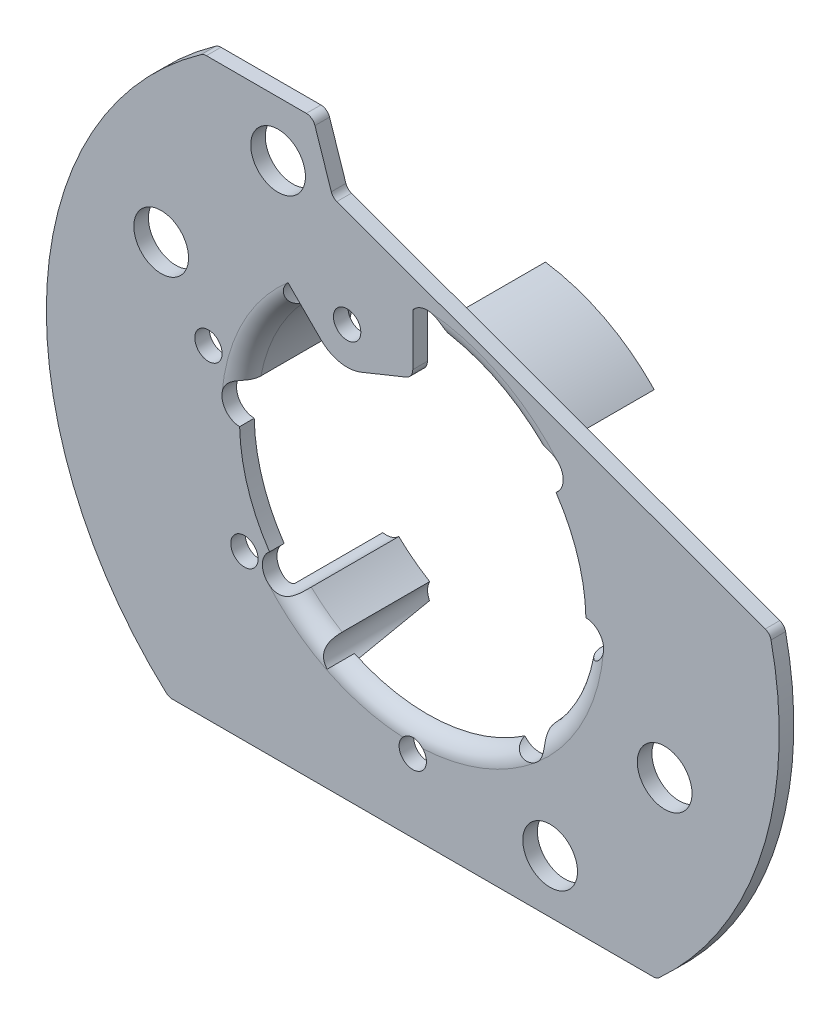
ISO-10303-21;
HEADER;
FILE_DESCRIPTION(('STEP AP214'),'2;1');
FILE_NAME('part.step','',(''),(''),'','','');
FILE_SCHEMA(('AUTOMOTIVE_DESIGN { 1 0 10303 214 1 1 1 1 }'));
ENDSEC;
DATA;
#1=APPLICATION_CONTEXT('core data for automotive mechanical design processes');
#2=APPLICATION_PROTOCOL_DEFINITION('international standard','automotive_design',2000,#1);
#3=PRODUCT_CONTEXT('',#1,'mechanical');
#4=PRODUCT('Part','Part','',(#3));
#5=PRODUCT_RELATED_PRODUCT_CATEGORY('part','',(#4));
#6=PRODUCT_DEFINITION_FORMATION('','',#4);
#7=PRODUCT_DEFINITION_CONTEXT('part definition',#1,'design');
#8=PRODUCT_DEFINITION('design','',#6,#7);
#9=PRODUCT_DEFINITION_SHAPE('','',#8);
#10=(LENGTH_UNIT() NAMED_UNIT(*) SI_UNIT(.MILLI.,.METRE.));
#11=(NAMED_UNIT(*) PLANE_ANGLE_UNIT() SI_UNIT($,.RADIAN.));
#12=(NAMED_UNIT(*) SI_UNIT($,.STERADIAN.) SOLID_ANGLE_UNIT());
#13=UNCERTAINTY_MEASURE_WITH_UNIT(LENGTH_MEASURE(1.E-05),#10,'distance_accuracy_value','');
#14=(GEOMETRIC_REPRESENTATION_CONTEXT(3) GLOBAL_UNCERTAINTY_ASSIGNED_CONTEXT((#13)) GLOBAL_UNIT_ASSIGNED_CONTEXT((#10,
#11,#12)) REPRESENTATION_CONTEXT('',''));
#15=CARTESIAN_POINT('',(0.,0.,0.));
#16=DIRECTION('',(0.,0.,1.));
#17=DIRECTION('',(1.,0.,0.));
#18=AXIS2_PLACEMENT_3D('',#15,#16,#17);
#19=CARTESIAN_POINT('',(4.36835391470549E-13,0.,0.));
#20=DIRECTION('',(0.,0.,1.));
#21=DIRECTION('',(1.,0.,0.));
#22=AXIS2_PLACEMENT_3D('',#19,#20,#21);
#23=PLANE('',#22);
#24=CARTESIAN_POINT('',(-3.6,7.58946638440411,0.));
#25=DIRECTION('',(0.,0.,1.));
#26=DIRECTION('',(1.,0.,0.));
#27=AXIS2_PLACEMENT_3D('',#24,#25,#26);
#28=CIRCLE('',#27,0.75);
#29=CARTESIAN_POINT('',(-2.85,7.58946638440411,0.));
#30=VERTEX_POINT('',#29);
#31=EDGE_CURVE('E495',#30,#30,#28,.T.);
#32=ORIENTED_EDGE('',*,*,#31,.T.);
#33=EDGE_LOOP('',(#32));
#34=FACE_BOUND('',#33,.T.);
#35=CARTESIAN_POINT('',(-11.20763062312,2.78072888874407,0.));
#36=DIRECTION('',(0.,0.,1.));
#37=DIRECTION('',(1.,0.,0.));
#38=AXIS2_PLACEMENT_3D('',#35,#36,#37);
#39=CIRCLE('',#38,0.75);
#40=CARTESIAN_POINT('',(-10.45763062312,2.78072888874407,0.));
#41=VERTEX_POINT('',#40);
#42=EDGE_CURVE('E502',#41,#41,#39,.T.);
#43=ORIENTED_EDGE('',*,*,#42,.T.);
#44=EDGE_LOOP('',(#43));
#45=FACE_BOUND('',#44,.T.);
#46=CARTESIAN_POINT('',(-9.23309265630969,-6.,0.));
#47=DIRECTION('',(0.,0.,1.));
#48=DIRECTION('',(1.,0.,0.));
#49=AXIS2_PLACEMENT_3D('',#46,#47,#48);
#50=CIRCLE('',#49,0.75);
#51=CARTESIAN_POINT('',(-8.48309265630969,-6.,0.));
#52=VERTEX_POINT('',#51);
#53=EDGE_CURVE('E508',#52,#52,#50,.T.);
#54=ORIENTED_EDGE('',*,*,#53,.T.);
#55=EDGE_LOOP('',(#54));
#56=FACE_BOUND('',#55,.T.);
#57=CARTESIAN_POINT('',(0.,-11.,0.));
#58=DIRECTION('',(0.,0.,1.));
#59=DIRECTION('',(1.,0.,0.));
#60=AXIS2_PLACEMENT_3D('',#57,#58,#59);
#61=CIRCLE('',#60,0.75);
#62=CARTESIAN_POINT('',(0.75,-11.,0.));
#63=VERTEX_POINT('',#62);
#64=EDGE_CURVE('E514',#63,#63,#61,.T.);
#65=ORIENTED_EDGE('',*,*,#64,.T.);
#66=EDGE_LOOP('',(#65));
#67=FACE_BOUND('',#66,.T.);
#68=CARTESIAN_POINT('',(-7.38827844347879,13.4723904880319,0.));
#69=DIRECTION('',(0.,0.,1.));
#70=DIRECTION('',(1.,0.,0.));
#71=AXIS2_PLACEMENT_3D('',#68,#69,#70);
#72=CIRCLE('',#71,1.5);
#73=CARTESIAN_POINT('',(-5.88827844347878,13.4723904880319,0.));
#74=VERTEX_POINT('',#73);
#75=EDGE_CURVE('E584',#74,#74,#72,.T.);
#76=ORIENTED_EDGE('',*,*,#75,.T.);
#77=EDGE_LOOP('',(#76));
#78=FACE_BOUND('',#77,.T.);
#79=DIRECTION('',(1.,0.,0.));
#80=VECTOR('',#79,1.);
#81=CARTESIAN_POINT('',(-13.3794618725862,-15.,0.));
#82=LINE('',#81,#80);
#83=CARTESIAN_POINT('',(-13.1874940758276,-15.,0.));
#84=VERTEX_POINT('',#83);
#85=CARTESIAN_POINT('',(13.1874940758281,-15.,0.));
#86=VERTEX_POINT('',#85);
#87=EDGE_CURVE('E613',#84,#86,#82,.T.);
#88=ORIENTED_EDGE('',*,*,#87,.F.);
#89=CARTESIAN_POINT('',(-13.1874940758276,-14.5,0.));
#90=DIRECTION('',(0.,0.,1.));
#91=DIRECTION('',(1.,0.,0.));
#92=AXIS2_PLACEMENT_3D('',#89,#90,#91);
#93=CIRCLE('',#92,0.5);
#94=CARTESIAN_POINT('',(-13.5239097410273,-14.8698979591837,0.));
#95=VERTEX_POINT('',#94);
#96=EDGE_CURVE('E639',#84,#95,#93,.F.);
#97=ORIENTED_EDGE('',*,*,#96,.T.);
#98=CARTESIAN_POINT('',(4.36835391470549E-13,0.,0.));
#99=DIRECTION('',(0.,0.,1.));
#100=DIRECTION('',(1.,0.,0.));
#101=AXIS2_PLACEMENT_3D('',#98,#99,#100);
#102=CIRCLE('',#101,20.1);
#103=CARTESIAN_POINT('',(-11.6095726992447,16.4081632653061,0.));
#104=VERTEX_POINT('',#103);
#105=EDGE_CURVE('E588',#104,#95,#102,.T.);
#106=ORIENTED_EDGE('',*,*,#105,.F.);
#107=CARTESIAN_POINT('',(-11.3207773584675,16.,0.));
#108=DIRECTION('',(0.,0.,1.));
#109=DIRECTION('',(1.,0.,0.));
#110=AXIS2_PLACEMENT_3D('',#107,#108,#109);
#111=CIRCLE('',#110,0.5);
#112=CARTESIAN_POINT('',(-11.3207773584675,16.5,0.));
#113=VERTEX_POINT('',#112);
#114=EDGE_CURVE('E633',#104,#113,#111,.F.);
#115=ORIENTED_EDGE('',*,*,#114,.T.);
#116=DIRECTION('',(-1.,0.,0.));
#117=VECTOR('',#116,1.);
#118=CARTESIAN_POINT('',(-11.478675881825,16.5,0.));
#119=LINE('',#118,#117);
#120=CARTESIAN_POINT('',(-5.83949769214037,16.5,0.));
#121=VERTEX_POINT('',#120);
#122=EDGE_CURVE('E595',#121,#113,#119,.T.);
#123=ORIENTED_EDGE('',*,*,#122,.F.);
#124=CARTESIAN_POINT('',(-5.83949769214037,16.,0.));
#125=DIRECTION('',(0.,0.,1.));
#126=DIRECTION('',(1.,0.,0.));
#127=AXIS2_PLACEMENT_3D('',#124,#125,#126);
#128=CIRCLE('',#127,0.5);
#129=CARTESIAN_POINT('',(-5.36497238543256,16.1575618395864,0.));
#130=VERTEX_POINT('',#129);
#131=EDGE_CURVE('E631',#121,#130,#128,.F.);
#132=ORIENTED_EDGE('',*,*,#131,.T.);
#133=DIRECTION('',(-0.315123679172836,0.949050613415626,0.));
#134=VECTOR('',#133,1.);
#135=CARTESIAN_POINT('',(-5.47867588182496,16.5,0.));
#136=LINE('',#135,#134);
#137=CARTESIAN_POINT('',(-4.46874159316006,13.4584045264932,0.));
#138=VERTEX_POINT('',#137);
#139=EDGE_CURVE('E622',#138,#130,#136,.T.);
#140=ORIENTED_EDGE('',*,*,#139,.F.);
#141=CARTESIAN_POINT('',(-3.99421628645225,13.6159663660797,0.));
#142=DIRECTION('',(0.,0.,1.));
#143=DIRECTION('',(1.,0.,0.));
#144=AXIS2_PLACEMENT_3D('',#141,#142,#143);
#145=CIRCLE('',#144,0.5);
#146=CARTESIAN_POINT('',(-4.16522635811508,13.1461200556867,0.));
#147=VERTEX_POINT('',#146);
#148=EDGE_CURVE('E676',#138,#147,#145,.T.);
#149=ORIENTED_EDGE('',*,*,#148,.T.);
#150=DIRECTION('',(-0.939692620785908,0.342020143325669,0.));
#151=VECTOR('',#150,1.);
#152=CARTESIAN_POINT('',(-4.39251941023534,13.228847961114,0.));
#153=LINE('',#152,#151);
#154=CARTESIAN_POINT('',(19.3322613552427,4.59373394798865,0.));
#155=VERTEX_POINT('',#154);
#156=EDGE_CURVE('E619',#155,#147,#153,.T.);
#157=ORIENTED_EDGE('',*,*,#156,.F.);
#158=CARTESIAN_POINT('',(19.1612512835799,4.12388763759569,0.));
#159=DIRECTION('',(0.,0.,1.));
#160=DIRECTION('',(1.,0.,0.));
#161=AXIS2_PLACEMENT_3D('',#158,#159,#160);
#162=CIRCLE('',#161,0.5);
#163=CARTESIAN_POINT('',(19.6500587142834,4.22908885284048,0.));
#164=VERTEX_POINT('',#163);
#165=EDGE_CURVE('E635',#155,#164,#162,.F.);
#166=ORIENTED_EDGE('',*,*,#165,.T.);
#167=CARTESIAN_POINT('',(4.36835391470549E-13,0.,0.));
#168=DIRECTION('',(0.,0.,1.));
#169=DIRECTION('',(1.,0.,0.));
#170=AXIS2_PLACEMENT_3D('',#167,#168,#169);
#171=CIRCLE('',#170,20.0999999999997);
#172=CARTESIAN_POINT('',(13.5239097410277,-14.8698979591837,0.));
#173=VERTEX_POINT('',#172);
#174=EDGE_CURVE('E616',#173,#164,#171,.T.);
#175=ORIENTED_EDGE('',*,*,#174,.F.);
#176=CARTESIAN_POINT('',(13.1874940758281,-14.5,0.));
#177=DIRECTION('',(0.,0.,1.));
#178=DIRECTION('',(1.,0.,0.));
#179=AXIS2_PLACEMENT_3D('',#176,#177,#178);
#180=CIRCLE('',#179,0.5);
#181=EDGE_CURVE('E637',#173,#86,#180,.F.);
#182=ORIENTED_EDGE('',*,*,#181,.T.);
#183=EDGE_LOOP('',(#88,#97,#106,#115,#123,#132,#140,#149,#157,#166,#175,#182));
#184=FACE_BOUND('',#183,.T.);
#185=CARTESIAN_POINT('',(13.8157214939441,-5.23194503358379,0.));
#186=DIRECTION('',(0.,0.,1.));
#187=DIRECTION('',(1.,0.,0.));
#188=AXIS2_PLACEMENT_3D('',#185,#186,#187);
#189=CIRCLE('',#188,1.5);
#190=CARTESIAN_POINT('',(15.3157214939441,-5.23194503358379,0.));
#191=VERTEX_POINT('',#190);
#192=EDGE_CURVE('E528',#191,#191,#189,.T.);
#193=ORIENTED_EDGE('',*,*,#192,.T.);
#194=EDGE_LOOP('',(#193));
#195=FACE_BOUND('',#194,.T.);
#196=CARTESIAN_POINT('',(7.53441555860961,-12.0805543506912,0.));
#197=DIRECTION('',(0.,0.,1.));
#198=DIRECTION('',(1.,0.,0.));
#199=AXIS2_PLACEMENT_3D('',#196,#197,#198);
#200=CIRCLE('',#199,1.5);
#201=CARTESIAN_POINT('',(9.03441555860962,-12.0805543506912,0.));
#202=VERTEX_POINT('',#201);
#203=EDGE_CURVE('E522',#202,#202,#200,.T.);
#204=ORIENTED_EDGE('',*,*,#203,.T.);
#205=EDGE_LOOP('',(#204));
#206=FACE_BOUND('',#205,.T.);
#207=CARTESIAN_POINT('',(-13.8004563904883,6.40420190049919,0.));
#208=DIRECTION('',(0.,0.,1.));
#209=DIRECTION('',(1.,0.,0.));
#210=AXIS2_PLACEMENT_3D('',#207,#208,#209);
#211=CIRCLE('',#210,1.5);
#212=CARTESIAN_POINT('',(-12.3004563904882,6.40420190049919,0.));
#213=VERTEX_POINT('',#212);
#214=EDGE_CURVE('E498',#213,#213,#211,.T.);
#215=ORIENTED_EDGE('',*,*,#214,.T.);
#216=EDGE_LOOP('',(#215));
#217=FACE_BOUND('',#216,.T.);
#218=DIRECTION('',(-0.707106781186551,0.707106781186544,0.));
#219=VECTOR('',#218,1.);
#220=CARTESIAN_POINT('',(-5.0372912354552,6.1521751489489,0.));
#221=LINE('',#220,#219);
#222=CARTESIAN_POINT('',(-5.0372912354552,6.1521751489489,0.));
#223=VERTEX_POINT('',#222);
#224=CARTESIAN_POINT('',(-6.84401008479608,7.95889399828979,0.));
#225=VERTEX_POINT('',#224);
#226=EDGE_CURVE('E570',#223,#225,#221,.T.);
#227=ORIENTED_EDGE('',*,*,#226,.T.);
#228=CARTESIAN_POINT('',(-6.13690330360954,7.25178721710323,0.));
#229=DIRECTION('',(0.,0.,1.));
#230=DIRECTION('',(1.,0.,0.));
#231=AXIS2_PLACEMENT_3D('',#228,#229,#230);
#232=CIRCLE('',#231,1.);
#233=CARTESIAN_POINT('',(-6.7828953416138,8.01513136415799,0.));
#234=VERTEX_POINT('',#233);
#235=EDGE_CURVE('E54',#225,#234,#232,.F.);
#236=ORIENTED_EDGE('',*,*,#235,.T.);
#237=CARTESIAN_POINT('',(4.36835391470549E-13,0.,0.));
#238=DIRECTION('',(0.,0.,1.));
#239=DIRECTION('',(1.,0.,0.));
#240=AXIS2_PLACEMENT_3D('',#237,#238,#239);
#241=CIRCLE('',#240,10.5000000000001);
#242=CARTESIAN_POINT('',(-10.4637847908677,0.871325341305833,0.));
#243=VERTEX_POINT('',#242);
#244=EDGE_CURVE('E1060',#234,#243,#241,.T.);
#245=ORIENTED_EDGE('',*,*,#244,.T.);
#246=CARTESIAN_POINT('',(-9.46723385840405,0.788341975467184,0.));
#247=DIRECTION('',(0.,0.,1.));
#248=DIRECTION('',(-1.,0.,0.));
#249=AXIS2_PLACEMENT_3D('',#246,#247,#248);
#250=CIRCLE('',#249,1.);
#251=CARTESIAN_POINT('',(-9.49765216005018,-0.211195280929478,0.));
#252=VERTEX_POINT('',#251);
#253=EDGE_CURVE('E453',#243,#252,#250,.T.);
#254=ORIENTED_EDGE('',*,*,#253,.T.);
#255=CARTESIAN_POINT('',(4.36835391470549E-13,0.,0.));
#256=DIRECTION('',(0.,0.,1.));
#257=DIRECTION('',(1.,0.,0.));
#258=AXIS2_PLACEMENT_3D('',#255,#256,#257);
#259=CIRCLE('',#258,9.50000000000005);
#260=CARTESIAN_POINT('',(-7.85670558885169,-5.34061581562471,0.));
#261=VERTEX_POINT('',#260);
#262=EDGE_CURVE('E572',#252,#261,#259,.T.);
#263=ORIENTED_EDGE('',*,*,#262,.T.);
#264=CARTESIAN_POINT('',(-7.25178721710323,-6.13690330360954,0.));
#265=DIRECTION('',(0.,0.,1.));
#266=DIRECTION('',(-1.,0.,0.));
#267=AXIS2_PLACEMENT_3D('',#264,#265,#266);
#268=CIRCLE('',#267,1.);
#269=CARTESIAN_POINT('',(-8.01513323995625,-6.78289312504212,0.));
#270=VERTEX_POINT('',#269);
#271=EDGE_CURVE('E465',#261,#270,#268,.T.);
#272=ORIENTED_EDGE('',*,*,#271,.T.);
#273=CARTESIAN_POINT('',(4.36838607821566E-13,0.,0.));
#274=DIRECTION('',(0.,0.,1.));
#275=DIRECTION('',(1.,0.,0.));
#276=AXIS2_PLACEMENT_3D('',#273,#274,#275);
#277=CIRCLE('',#276,10.5000000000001);
#278=CARTESIAN_POINT('',(-4.40655404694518,-9.5305971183,0.));
#279=VERTEX_POINT('',#278);
#280=EDGE_CURVE('E1073',#270,#279,#277,.T.);
#281=ORIENTED_EDGE('',*,*,#280,.T.);
#282=CARTESIAN_POINT('',(-3.98688223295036,-8.62292120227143,0.));
#283=DIRECTION('',(0.,0.,1.));
#284=DIRECTION('',(1.,0.,0.));
#285=AXIS2_PLACEMENT_3D('',#282,#283,#284);
#286=CIRCLE('',#285,0.999999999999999);
#287=CARTESIAN_POINT('',(-4.69398901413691,-9.33002798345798,0.));
#288=VERTEX_POINT('',#287);
#289=EDGE_CURVE('E1071',#279,#288,#286,.F.);
#290=ORIENTED_EDGE('',*,*,#289,.T.);
#291=DIRECTION('',(0.707106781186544,0.707106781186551,0.));
#292=VECTOR('',#291,1.);
#293=CARTESIAN_POINT('',(-3.98688223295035,-8.62292120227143,0.));
#294=LINE('',#293,#292);
#295=CARTESIAN_POINT('',(-4.00210145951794,-8.63814042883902,0.));
#296=VERTEX_POINT('',#295);
#297=EDGE_CURVE('E541',#288,#296,#294,.T.);
#298=ORIENTED_EDGE('',*,*,#297,.T.);
#299=CARTESIAN_POINT('',(4.36835391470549E-13,0.,0.));
#300=DIRECTION('',(0.,0.,1.));
#301=DIRECTION('',(1.,0.,0.));
#302=AXIS2_PLACEMENT_3D('',#299,#300,#301);
#303=CIRCLE('',#302,9.52020410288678);
#304=CARTESIAN_POINT('',(5.35302425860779,-7.87270077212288,0.));
#305=VERTEX_POINT('',#304);
#306=EDGE_CURVE('E1098',#296,#305,#303,.T.);
#307=ORIENTED_EDGE('',*,*,#306,.T.);
#308=CARTESIAN_POINT('',(6.13690330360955,-7.25178721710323,0.));
#309=DIRECTION('',(0.,0.,1.));
#310=DIRECTION('',(-1.,0.,0.));
#311=AXIS2_PLACEMENT_3D('',#308,#309,#310);
#312=CIRCLE('',#311,1.);
#313=CARTESIAN_POINT('',(6.78289312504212,-8.01513323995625,0.));
#314=VERTEX_POINT('',#313);
#315=EDGE_CURVE('E476',#305,#314,#312,.T.);
#316=ORIENTED_EDGE('',*,*,#315,.T.);
#317=CARTESIAN_POINT('',(4.36835391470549E-13,0.,0.));
#318=DIRECTION('',(0.,0.,1.));
#319=DIRECTION('',(1.,0.,0.));
#320=AXIS2_PLACEMENT_3D('',#317,#318,#319);
#321=CIRCLE('',#320,10.5);
#322=CARTESIAN_POINT('',(10.4637847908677,-0.871325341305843,0.));
#323=VERTEX_POINT('',#322);
#324=EDGE_CURVE('E1066',#314,#323,#321,.T.);
#325=ORIENTED_EDGE('',*,*,#324,.T.);
#326=CARTESIAN_POINT('',(9.46723385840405,-0.788341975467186,0.));
#327=DIRECTION('',(0.,0.,1.));
#328=DIRECTION('',(-1.,0.,0.));
#329=AXIS2_PLACEMENT_3D('',#326,#327,#328);
#330=CIRCLE('',#329,1.);
#331=CARTESIAN_POINT('',(9.49765216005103,0.211195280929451,0.));
#332=VERTEX_POINT('',#331);
#333=EDGE_CURVE('E482',#323,#332,#330,.T.);
#334=ORIENTED_EDGE('',*,*,#333,.T.);
#335=CARTESIAN_POINT('',(4.36835391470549E-13,0.,0.));
#336=DIRECTION('',(0.,0.,1.));
#337=DIRECTION('',(1.,0.,0.));
#338=AXIS2_PLACEMENT_3D('',#335,#336,#337);
#339=CIRCLE('',#338,9.50000000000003);
#340=CARTESIAN_POINT('',(7.85670558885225,5.34061581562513,0.));
#341=VERTEX_POINT('',#340);
#342=EDGE_CURVE('E534',#332,#341,#339,.T.);
#343=ORIENTED_EDGE('',*,*,#342,.T.);
#344=CARTESIAN_POINT('',(7.25178721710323,6.13690330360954,0.));
#345=DIRECTION('',(0.,0.,1.));
#346=DIRECTION('',(-1.,0.,0.));
#347=AXIS2_PLACEMENT_3D('',#344,#345,#346);
#348=CIRCLE('',#347,1.);
#349=CARTESIAN_POINT('',(8.01513323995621,6.78289312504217,0.));
#350=VERTEX_POINT('',#349);
#351=EDGE_CURVE('E427',#341,#350,#348,.T.);
#352=ORIENTED_EDGE('',*,*,#351,.T.);
#353=CARTESIAN_POINT('',(4.36835391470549E-13,0.,0.));
#354=DIRECTION('',(0.,0.,1.));
#355=DIRECTION('',(1.,0.,0.));
#356=AXIS2_PLACEMENT_3D('',#353,#354,#355);
#357=CIRCLE('',#356,10.5);
#358=CARTESIAN_POINT('',(0.871325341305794,10.4637847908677,0.));
#359=VERTEX_POINT('',#358);
#360=EDGE_CURVE('E1067',#350,#359,#357,.T.);
#361=ORIENTED_EDGE('',*,*,#360,.T.);
#362=CARTESIAN_POINT('',(0.788341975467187,9.46723385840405,0.));
#363=DIRECTION('',(0.,0.,1.));
#364=DIRECTION('',(1.,0.,0.));
#365=AXIS2_PLACEMENT_3D('',#362,#363,#364);
#366=CIRCLE('',#365,1.);
#367=CARTESIAN_POINT('',(0.,10.0824711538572,0.));
#368=VERTEX_POINT('',#367);
#369=EDGE_CURVE('E446',#359,#368,#366,.T.);
#370=ORIENTED_EDGE('',*,*,#369,.T.);
#371=DIRECTION('',(0.,-1.,0.));
#372=VECTOR('',#371,1.);
#373=CARTESIAN_POINT('',(4.36835391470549E-13,9.5,0.));
#374=LINE('',#373,#372);
#375=CARTESIAN_POINT('',(4.36835391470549E-13,7.24380780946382,0.));
#376=VERTEX_POINT('',#375);
#377=EDGE_CURVE('E558',#368,#376,#374,.T.);
#378=ORIENTED_EDGE('',*,*,#377,.T.);
#379=CARTESIAN_POINT('',(-0.577224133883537,7.24380780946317,0.));
#380=DIRECTION('',(0.,0.,-1.));
#381=DIRECTION('',(-1.,0.,0.));
#382=AXIS2_PLACEMENT_3D('',#379,#380,#381);
#383=CIRCLE('',#382,0.577224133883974);
#384=CARTESIAN_POINT('',(-0.360477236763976,6.70882324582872,0.));
#385=VERTEX_POINT('',#384);
#386=EDGE_CURVE('E561',#376,#385,#383,.T.);
#387=ORIENTED_EDGE('',*,*,#386,.T.);
#388=DIRECTION('',(-0.926822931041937,-0.375498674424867,0.));
#389=VECTOR('',#388,1.);
#390=CARTESIAN_POINT('',(-0.360477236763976,6.70882324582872,0.));
#391=LINE('',#390,#389);
#392=CARTESIAN_POINT('',(-2.83674759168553,5.70557202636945,0.));
#393=VERTEX_POINT('',#392);
#394=EDGE_CURVE('E564',#385,#393,#391,.T.);
#395=ORIENTED_EDGE('',*,*,#394,.T.);
#396=CARTESIAN_POINT('',(-3.6,7.58946638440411,0.));
#397=DIRECTION('',(0.,0.,-1.));
#398=DIRECTION('',(-1.,0.,0.));
#399=AXIS2_PLACEMENT_3D('',#396,#397,#398);
#400=CIRCLE('',#399,2.03263675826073);
#401=EDGE_CURVE('E567',#393,#223,#400,.T.);
#402=ORIENTED_EDGE('',*,*,#401,.T.);
#403=EDGE_LOOP('',(#227,#236,#245,#254,#263,#272,#281,#290,#298,#307,#316,#325,#334,#343,#352,
#361,#370,#378,#387,#395,#402));
#404=FACE_BOUND('',#403,.T.);
#405=ADVANCED_FACE('F33',(#34,#45,#56,#67,#78,#184,#195,#206,#217,#404),#23,.F.);
#406=CARTESIAN_POINT('',(4.36835391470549E-13,0.,0.8));
#407=DIRECTION('',(0.,0.,-1.));
#408=DIRECTION('',(-1.,0.,0.));
#409=AXIS2_PLACEMENT_3D('',#406,#407,#408);
#410=CYLINDRICAL_SURFACE('',#409,9.50000000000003);
#411=DIRECTION('',(0.,0.,1.));
#412=VECTOR('',#411,1.);
#413=CARTESIAN_POINT('',(6.86519186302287,-6.56651663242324,0.));
#414=LINE('',#413,#412);
#415=CARTESIAN_POINT('',(6.86519186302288,-6.56651663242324,-5.));
#416=VERTEX_POINT('',#415);
#417=CARTESIAN_POINT('',(6.86519186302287,-6.56651663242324,-0.2));
#418=VERTEX_POINT('',#417);
#419=EDGE_CURVE('E472',#416,#418,#414,.T.);
#420=ORIENTED_EDGE('',*,*,#419,.T.);
#421=CARTESIAN_POINT('',(4.36835391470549E-13,0.,-0.2));
#422=DIRECTION('',(0.,0.,1.));
#423=DIRECTION('',(1.,0.,0.));
#424=AXIS2_PLACEMENT_3D('',#421,#422,#423);
#425=CIRCLE('',#424,9.50000000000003);
#426=CARTESIAN_POINT('',(9.33191545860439,-1.77914414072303,-0.2));
#427=VERTEX_POINT('',#426);
#428=EDGE_CURVE('E897',#418,#427,#425,.T.);
#429=ORIENTED_EDGE('',*,*,#428,.T.);
#430=DIRECTION('',(0.,0.,1.));
#431=VECTOR('',#430,1.);
#432=CARTESIAN_POINT('',(9.33191545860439,-1.77914414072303,0.));
#433=LINE('',#432,#431);
#434=CARTESIAN_POINT('',(9.33191545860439,-1.77914414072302,-5.));
#435=VERTEX_POINT('',#434);
#436=EDGE_CURVE('E484',#435,#427,#433,.T.);
#437=ORIENTED_EDGE('',*,*,#436,.F.);
#438=CARTESIAN_POINT('',(4.36835391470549E-13,0.,-5.));
#439=DIRECTION('',(0.,0.,1.));
#440=DIRECTION('',(-1.,0.,0.));
#441=AXIS2_PLACEMENT_3D('',#438,#439,#440);
#442=CIRCLE('',#441,9.50000000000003);
#443=EDGE_CURVE('E384',#416,#435,#442,.T.);
#444=ORIENTED_EDGE('',*,*,#443,.F.);
#445=EDGE_LOOP('',(#420,#429,#437,#444));
#446=FACE_BOUND('',#445,.T.);
#447=ADVANCED_FACE('F936',(#446),#410,.F.);
#448=DIRECTION('',(0.,0.,1.));
#449=VECTOR('',#448,1.);
#450=CARTESIAN_POINT('',(9.49765216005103,0.211195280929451,0.));
#451=LINE('',#450,#449);
#452=CARTESIAN_POINT('',(9.49765216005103,0.211195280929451,0.8));
#453=VERTEX_POINT('',#452);
#454=EDGE_CURVE('E479',#332,#453,#451,.T.);
#455=ORIENTED_EDGE('',*,*,#454,.T.);
#456=CARTESIAN_POINT('',(4.36835391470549E-13,0.,0.8));
#457=DIRECTION('',(0.,0.,1.));
#458=DIRECTION('',(1.,0.,0.));
#459=AXIS2_PLACEMENT_3D('',#456,#457,#458);
#460=CIRCLE('',#459,9.50000000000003);
#461=CARTESIAN_POINT('',(7.85670558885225,5.34061581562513,0.8));
#462=VERTEX_POINT('',#461);
#463=EDGE_CURVE('E537',#453,#462,#460,.T.);
#464=ORIENTED_EDGE('',*,*,#463,.T.);
#465=DIRECTION('',(0.,0.,1.));
#466=VECTOR('',#465,1.);
#467=CARTESIAN_POINT('',(7.85670558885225,5.34061581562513,0.));
#468=LINE('',#467,#466);
#469=EDGE_CURVE('E430',#341,#462,#468,.T.);
#470=ORIENTED_EDGE('',*,*,#469,.F.);
#471=ORIENTED_EDGE('',*,*,#342,.F.);
#472=EDGE_LOOP('',(#455,#464,#470,#471));
#473=FACE_BOUND('',#472,.T.);
#474=ADVANCED_FACE('F942',(#473),#410,.F.);
#475=CARTESIAN_POINT('',(4.36835391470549E-13,0.,0.8));
#476=DIRECTION('',(0.,0.,-1.));
#477=DIRECTION('',(-1.,0.,0.));
#478=AXIS2_PLACEMENT_3D('',#475,#476,#477);
#479=CYLINDRICAL_SURFACE('',#478,9.50000000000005);
#480=DIRECTION('',(0.,0.,1.));
#481=VECTOR('',#480,1.);
#482=CARTESIAN_POINT('',(-6.86519186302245,6.5665166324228,0.));
#483=LINE('',#482,#481);
#484=CARTESIAN_POINT('',(-6.86519186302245,6.5665166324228,-5.));
#485=VERTEX_POINT('',#484);
#486=CARTESIAN_POINT('',(-6.86519186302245,6.5665166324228,-0.2));
#487=VERTEX_POINT('',#486);
#488=EDGE_CURVE('E490',#485,#487,#483,.T.);
#489=ORIENTED_EDGE('',*,*,#488,.T.);
#490=CARTESIAN_POINT('',(4.36835391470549E-13,0.,-0.2));
#491=DIRECTION('',(0.,0.,1.));
#492=DIRECTION('',(1.,0.,0.));
#493=AXIS2_PLACEMENT_3D('',#490,#491,#492);
#494=CIRCLE('',#493,9.50000000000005);
#495=CARTESIAN_POINT('',(-9.33191545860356,1.77914414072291,-0.2));
#496=VERTEX_POINT('',#495);
#497=EDGE_CURVE('E821',#487,#496,#494,.T.);
#498=ORIENTED_EDGE('',*,*,#497,.T.);
#499=DIRECTION('',(0.,0.,1.));
#500=VECTOR('',#499,1.);
#501=CARTESIAN_POINT('',(-9.33191545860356,1.77914414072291,0.));
#502=LINE('',#501,#500);
#503=CARTESIAN_POINT('',(-9.33191545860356,1.77914414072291,-5.));
#504=VERTEX_POINT('',#503);
#505=EDGE_CURVE('E455',#504,#496,#502,.T.);
#506=ORIENTED_EDGE('',*,*,#505,.F.);
#507=CARTESIAN_POINT('',(4.36835391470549E-13,0.,-5.));
#508=DIRECTION('',(0.,0.,1.));
#509=DIRECTION('',(-1.,0.,0.));
#510=AXIS2_PLACEMENT_3D('',#507,#508,#509);
#511=CIRCLE('',#510,9.50000000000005);
#512=EDGE_CURVE('E400',#485,#504,#511,.T.);
#513=ORIENTED_EDGE('',*,*,#512,.F.);
#514=EDGE_LOOP('',(#489,#498,#506,#513));
#515=FACE_BOUND('',#514,.T.);
#516=ADVANCED_FACE('F885',(#515),#479,.F.);
#517=DIRECTION('',(0.,0.,1.));
#518=VECTOR('',#517,1.);
#519=CARTESIAN_POINT('',(-9.49765216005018,-0.211195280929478,0.));
#520=LINE('',#519,#518);
#521=CARTESIAN_POINT('',(-9.49765216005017,-0.211195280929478,0.8));
#522=VERTEX_POINT('',#521);
#523=EDGE_CURVE('E459',#252,#522,#520,.T.);
#524=ORIENTED_EDGE('',*,*,#523,.T.);
#525=CARTESIAN_POINT('',(4.36835391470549E-13,0.,0.8));
#526=DIRECTION('',(0.,0.,1.));
#527=DIRECTION('',(1.,0.,0.));
#528=AXIS2_PLACEMENT_3D('',#525,#526,#527);
#529=CIRCLE('',#528,9.50000000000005);
#530=CARTESIAN_POINT('',(-7.85670558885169,-5.34061581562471,0.8));
#531=VERTEX_POINT('',#530);
#532=EDGE_CURVE('E552',#522,#531,#529,.T.);
#533=ORIENTED_EDGE('',*,*,#532,.T.);
#534=DIRECTION('',(0.,0.,1.));
#535=VECTOR('',#534,1.);
#536=CARTESIAN_POINT('',(-7.85670558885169,-5.34061581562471,0.));
#537=LINE('',#536,#535);
#538=EDGE_CURVE('E468',#261,#531,#537,.T.);
#539=ORIENTED_EDGE('',*,*,#538,.F.);
#540=ORIENTED_EDGE('',*,*,#262,.F.);
#541=EDGE_LOOP('',(#524,#533,#539,#540));
#542=FACE_BOUND('',#541,.T.);
#543=ADVANCED_FACE('F1056',(#542),#479,.F.);
#544=CARTESIAN_POINT('',(4.36835391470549E-13,0.,0.8));
#545=DIRECTION('',(0.,0.,1.));
#546=DIRECTION('',(1.,0.,0.));
#547=AXIS2_PLACEMENT_3D('',#544,#545,#546);
#548=PLANE('',#547);
#549=CARTESIAN_POINT('',(0.,-11.,0.8));
#550=DIRECTION('',(0.,0.,1.));
#551=DIRECTION('',(1.,0.,0.));
#552=AXIS2_PLACEMENT_3D('',#549,#550,#551);
#553=CIRCLE('',#552,0.75);
#554=CARTESIAN_POINT('',(-0.545979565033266,-10.4857954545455,0.8));
#555=VERTEX_POINT('',#554);
#556=CARTESIAN_POINT('',(0.545979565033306,-10.4857954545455,0.8));
#557=VERTEX_POINT('',#556);
#558=EDGE_CURVE('E493',#555,#557,#553,.T.);
#559=ORIENTED_EDGE('',*,*,#558,.F.);
#560=CARTESIAN_POINT('',(4.36835391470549E-13,0.,0.8));
#561=DIRECTION('',(0.,0.,1.));
#562=DIRECTION('',(1.,0.,0.));
#563=AXIS2_PLACEMENT_3D('',#560,#561,#562);
#564=CIRCLE('',#563,10.5000000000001);
#565=CARTESIAN_POINT('',(-8.01513323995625,-6.78289312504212,0.8));
#566=VERTEX_POINT('',#565);
#567=EDGE_CURVE('E797',#555,#566,#564,.F.);
#568=ORIENTED_EDGE('',*,*,#567,.T.);
#569=CARTESIAN_POINT('',(-7.25178721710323,-6.13690330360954,0.8));
#570=DIRECTION('',(0.,0.,1.));
#571=DIRECTION('',(-1.,0.,0.));
#572=AXIS2_PLACEMENT_3D('',#569,#570,#571);
#573=CIRCLE('',#572,1.);
#574=EDGE_CURVE('E469',#531,#566,#573,.T.);
#575=ORIENTED_EDGE('',*,*,#574,.F.);
#576=ORIENTED_EDGE('',*,*,#532,.F.);
#577=CARTESIAN_POINT('',(-9.46723385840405,0.788341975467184,0.8));
#578=DIRECTION('',(0.,0.,1.));
#579=DIRECTION('',(-1.,0.,0.));
#580=AXIS2_PLACEMENT_3D('',#577,#578,#579);
#581=CIRCLE('',#580,1.);
#582=CARTESIAN_POINT('',(-10.4637847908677,0.871325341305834,0.8));
#583=VERTEX_POINT('',#582);
#584=EDGE_CURVE('E456',#583,#522,#581,.T.);
#585=ORIENTED_EDGE('',*,*,#584,.F.);
#586=CARTESIAN_POINT('',(-10.4637847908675,0.871325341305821,0.8));
#587=CARTESIAN_POINT('',(-10.4496100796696,1.04080871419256,0.8));
#588=CARTESIAN_POINT('',(-10.4313107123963,1.20994674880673,0.799999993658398));
#589=CARTESIAN_POINT('',(-10.3865213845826,1.54713169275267,0.799999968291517));
#590=CARTESIAN_POINT('',(-10.3600315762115,1.71517862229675,0.799999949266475));
#591=CARTESIAN_POINT('',(-10.2989201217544,2.04978412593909,0.799999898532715));
#592=CARTESIAN_POINT('',(-10.2642986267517,2.21634272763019,0.799999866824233));
#593=CARTESIAN_POINT('',(-10.1870069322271,2.54757855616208,0.799999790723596));
#594=CARTESIAN_POINT('',(-10.1443368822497,2.71225581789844,0.799999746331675));
#595=CARTESIAN_POINT('',(-10.0510488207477,3.03934022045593,0.799999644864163));
#596=CARTESIAN_POINT('',(-10.0004309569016,3.20174740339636,0.799999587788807));
#597=CARTESIAN_POINT('',(-9.89136714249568,3.52390832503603,0.799999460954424));
#598=CARTESIAN_POINT('',(-9.83292133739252,3.68366211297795,0.799999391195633));
#599=CARTESIAN_POINT('',(-9.70833989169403,4.0001391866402,0.799999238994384));
#600=CARTESIAN_POINT('',(-9.64220439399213,4.15686252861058,0.799999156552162));
#601=CARTESIAN_POINT('',(-9.50239999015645,4.46690882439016,0.799998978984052));
#602=CARTESIAN_POINT('',(-9.42873122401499,4.62023184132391,0.799998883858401));
#603=CARTESIAN_POINT('',(-9.27403448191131,4.9231156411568,0.799998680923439));
#604=CARTESIAN_POINT('',(-9.19300664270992,5.07267649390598,0.799998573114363));
#605=CARTESIAN_POINT('',(-9.02378332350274,5.36768301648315,0.799998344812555));
#606=CARTESIAN_POINT('',(-8.93558797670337,5.51312876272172,0.799998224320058));
#607=CARTESIAN_POINT('',(-8.75223812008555,5.79956184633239,0.799997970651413));
#608=CARTESIAN_POINT('',(-8.65708373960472,5.94054926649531,0.7999978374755));
#609=CARTESIAN_POINT('',(-8.46004073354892,6.21773302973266,0.799997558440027));
#610=CARTESIAN_POINT('',(-8.35815223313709,6.35392946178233,0.799997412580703));
#611=CARTESIAN_POINT('',(-8.147881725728,6.62120983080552,0.799997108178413));
#612=CARTESIAN_POINT('',(-8.03949983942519,6.75229386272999,0.799996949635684));
#613=CARTESIAN_POINT('',(-7.81649887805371,7.00904036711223,0.799996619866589));
#614=CARTESIAN_POINT('',(-7.70187991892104,7.13470294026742,0.79999644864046));
#615=CARTESIAN_POINT('',(-7.46667488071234,7.38030925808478,0.799996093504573));
#616=CARTESIAN_POINT('',(-7.34608891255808,7.50025310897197,0.79999590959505));
#617=CARTESIAN_POINT('',(-7.09923760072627,7.73414201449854,0.799995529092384));
#618=CARTESIAN_POINT('',(-6.97297236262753,7.84808718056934,0.799995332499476));
#619=CARTESIAN_POINT('',(-6.84401009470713,7.95889400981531,0.799995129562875));
#620=B_SPLINE_CURVE_WITH_KNOTS('',3,(#586,#587,#588,#589,#590,#591,#592,#593,#594,#595,#596,
#597,#598,#599,#600,#601,#602,#603,#604,#605,#606,#607,#608,#609,#610,#611,#612,#613,#614,#615,
#616,#617,#618,#619),.UNSPECIFIED.,.F.,.F.,(4,2,2,2,2,2,2,2,2,2,2,2,2,2,2,2,4),(0.,
0.510174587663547,1.02033969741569,1.53049532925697,2.04064148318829,2.55077815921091,
3.06090535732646,3.57102307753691,4.08113131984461,4.59123008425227,5.10131937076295,
5.61139917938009,6.12146951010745,6.63153036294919,7.14158173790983,7.65162363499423,
8.16165605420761),.UNSPECIFIED.);
#621=CARTESIAN_POINT('',(-6.84401008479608,7.95889399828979,0.8));
#622=VERTEX_POINT('',#621);
#623=EDGE_CURVE('E794',#583,#622,#620,.T.);
#624=ORIENTED_EDGE('',*,*,#623,.T.);
#625=DIRECTION('',(-0.707106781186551,0.707106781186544,0.));
#626=VECTOR('',#625,1.);
#627=CARTESIAN_POINT('',(-5.0372912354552,6.1521751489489,0.8));
#628=LINE('',#627,#626);
#629=CARTESIAN_POINT('',(-5.0372912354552,6.1521751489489,0.8));
#630=VERTEX_POINT('',#629);
#631=EDGE_CURVE('E549',#630,#622,#628,.T.);
#632=ORIENTED_EDGE('',*,*,#631,.F.);
#633=CARTESIAN_POINT('',(-3.6,7.58946638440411,0.8));
#634=DIRECTION('',(0.,0.,-1.));
#635=DIRECTION('',(-1.,0.,0.));
#636=AXIS2_PLACEMENT_3D('',#633,#634,#635);
#637=CIRCLE('',#636,2.03263675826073);
#638=CARTESIAN_POINT('',(-2.83674759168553,5.70557202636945,0.8));
#639=VERTEX_POINT('',#638);
#640=EDGE_CURVE('E547',#639,#630,#637,.T.);
#641=ORIENTED_EDGE('',*,*,#640,.F.);
#642=DIRECTION('',(-0.926822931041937,-0.375498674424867,0.));
#643=VECTOR('',#642,1.);
#644=CARTESIAN_POINT('',(-0.360477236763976,6.70882324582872,0.8));
#645=LINE('',#644,#643);
#646=CARTESIAN_POINT('',(-0.360477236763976,6.70882324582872,0.8));
#647=VERTEX_POINT('',#646);
#648=EDGE_CURVE('E545',#647,#639,#645,.T.);
#649=ORIENTED_EDGE('',*,*,#648,.F.);
#650=CARTESIAN_POINT('',(-0.577224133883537,7.24380780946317,0.8));
#651=DIRECTION('',(0.,0.,-1.));
#652=DIRECTION('',(-1.,0.,0.));
#653=AXIS2_PLACEMENT_3D('',#650,#651,#652);
#654=CIRCLE('',#653,0.577224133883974);
#655=CARTESIAN_POINT('',(4.36835391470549E-13,7.24380780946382,0.8));
#656=VERTEX_POINT('',#655);
#657=EDGE_CURVE('E543',#656,#647,#654,.T.);
#658=ORIENTED_EDGE('',*,*,#657,.F.);
#659=DIRECTION('',(0.,-1.,0.));
#660=VECTOR('',#659,1.);
#661=CARTESIAN_POINT('',(4.36835391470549E-13,9.5,0.8));
#662=LINE('',#661,#660);
#663=CARTESIAN_POINT('',(0.,10.0824711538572,0.8));
#664=VERTEX_POINT('',#663);
#665=EDGE_CURVE('E540',#664,#656,#662,.T.);
#666=ORIENTED_EDGE('',*,*,#665,.F.);
#667=CARTESIAN_POINT('',(0.788341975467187,9.46723385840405,0.8));
#668=DIRECTION('',(0.,0.,1.));
#669=DIRECTION('',(1.,0.,0.));
#670=AXIS2_PLACEMENT_3D('',#667,#668,#669);
#671=CIRCLE('',#670,1.);
#672=CARTESIAN_POINT('',(0.871325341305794,10.4637847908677,0.8));
#673=VERTEX_POINT('',#672);
#674=EDGE_CURVE('E426',#673,#664,#671,.T.);
#675=ORIENTED_EDGE('',*,*,#674,.F.);
#676=CARTESIAN_POINT('',(4.36835391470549E-13,0.,0.8));
#677=DIRECTION('',(0.,0.,1.));
#678=DIRECTION('',(1.,0.,0.));
#679=AXIS2_PLACEMENT_3D('',#676,#677,#678);
#680=CIRCLE('',#679,10.5);
#681=CARTESIAN_POINT('',(8.01513323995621,6.78289312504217,0.8));
#682=VERTEX_POINT('',#681);
#683=EDGE_CURVE('E788',#673,#682,#680,.F.);
#684=ORIENTED_EDGE('',*,*,#683,.T.);
#685=CARTESIAN_POINT('',(7.25178721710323,6.13690330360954,0.8));
#686=DIRECTION('',(0.,0.,1.));
#687=DIRECTION('',(-1.,0.,0.));
#688=AXIS2_PLACEMENT_3D('',#685,#686,#687);
#689=CIRCLE('',#688,1.);
#690=EDGE_CURVE('E431',#462,#682,#689,.T.);
#691=ORIENTED_EDGE('',*,*,#690,.F.);
#692=ORIENTED_EDGE('',*,*,#463,.F.);
#693=CARTESIAN_POINT('',(9.46723385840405,-0.788341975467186,0.8));
#694=DIRECTION('',(0.,0.,1.));
#695=DIRECTION('',(-1.,0.,0.));
#696=AXIS2_PLACEMENT_3D('',#693,#694,#695);
#697=CIRCLE('',#696,1.);
#698=CARTESIAN_POINT('',(10.4637847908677,-0.871325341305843,0.8));
#699=VERTEX_POINT('',#698);
#700=EDGE_CURVE('E438',#699,#453,#697,.T.);
#701=ORIENTED_EDGE('',*,*,#700,.F.);
#702=CARTESIAN_POINT('',(4.36835391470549E-13,0.,0.8));
#703=DIRECTION('',(0.,0.,1.));
#704=DIRECTION('',(1.,0.,0.));
#705=AXIS2_PLACEMENT_3D('',#702,#703,#704);
#706=CIRCLE('',#705,10.5);
#707=CARTESIAN_POINT('',(6.78289312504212,-8.01513323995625,0.8));
#708=VERTEX_POINT('',#707);
#709=EDGE_CURVE('E790',#699,#708,#706,.F.);
#710=ORIENTED_EDGE('',*,*,#709,.T.);
#711=CARTESIAN_POINT('',(4.36835391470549E-13,0.,0.8));
#712=DIRECTION('',(0.,0.,1.));
#713=DIRECTION('',(1.,0.,0.));
#714=AXIS2_PLACEMENT_3D('',#711,#712,#713);
#715=CIRCLE('',#714,10.5000000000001);
#716=EDGE_CURVE('E792',#708,#557,#715,.F.);
#717=ORIENTED_EDGE('',*,*,#716,.T.);
#718=EDGE_LOOP('',(#559,#568,#575,#576,#585,#624,#632,#641,#649,#658,#666,#675,#684,#691,#692,
#701,#710,#717));
#719=FACE_BOUND('',#718,.T.);
#720=CARTESIAN_POINT('',(-3.6,7.58946638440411,0.8));
#721=DIRECTION('',(0.,0.,1.));
#722=DIRECTION('',(1.,0.,0.));
#723=AXIS2_PLACEMENT_3D('',#720,#721,#722);
#724=CIRCLE('',#723,0.75);
#725=CARTESIAN_POINT('',(-2.85,7.58946638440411,0.8));
#726=VERTEX_POINT('',#725);
#727=EDGE_CURVE('E499',#726,#726,#724,.T.);
#728=ORIENTED_EDGE('',*,*,#727,.F.);
#729=EDGE_LOOP('',(#728));
#730=FACE_BOUND('',#729,.T.);
#731=CARTESIAN_POINT('',(-11.20763062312,2.78072888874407,0.8));
#732=DIRECTION('',(0.,0.,1.));
#733=DIRECTION('',(1.,0.,0.));
#734=AXIS2_PLACEMENT_3D('',#731,#732,#733);
#735=CIRCLE('',#734,0.75);
#736=CARTESIAN_POINT('',(-10.45763062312,2.78072888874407,0.8));
#737=VERTEX_POINT('',#736);
#738=EDGE_CURVE('E505',#737,#737,#735,.T.);
#739=ORIENTED_EDGE('',*,*,#738,.F.);
#740=EDGE_LOOP('',(#739));
#741=FACE_BOUND('',#740,.T.);
#742=CARTESIAN_POINT('',(-9.23309265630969,-6.,0.8));
#743=DIRECTION('',(0.,0.,1.));
#744=DIRECTION('',(1.,0.,0.));
#745=AXIS2_PLACEMENT_3D('',#742,#743,#744);
#746=CIRCLE('',#745,0.75);
#747=CARTESIAN_POINT('',(-8.48309265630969,-6.,0.8));
#748=VERTEX_POINT('',#747);
#749=EDGE_CURVE('E511',#748,#748,#746,.T.);
#750=ORIENTED_EDGE('',*,*,#749,.F.);
#751=EDGE_LOOP('',(#750));
#752=FACE_BOUND('',#751,.T.);
#753=CARTESIAN_POINT('',(7.53441555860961,-12.0805543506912,0.8));
#754=DIRECTION('',(0.,0.,1.));
#755=DIRECTION('',(1.,0.,0.));
#756=AXIS2_PLACEMENT_3D('',#753,#754,#755);
#757=CIRCLE('',#756,1.5);
#758=CARTESIAN_POINT('',(9.03441555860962,-12.0805543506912,0.8));
#759=VERTEX_POINT('',#758);
#760=EDGE_CURVE('E525',#759,#759,#757,.T.);
#761=ORIENTED_EDGE('',*,*,#760,.F.);
#762=EDGE_LOOP('',(#761));
#763=FACE_BOUND('',#762,.T.);
#764=CARTESIAN_POINT('',(-7.38827844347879,13.4723904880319,0.8));
#765=DIRECTION('',(0.,0.,1.));
#766=DIRECTION('',(1.,0.,0.));
#767=AXIS2_PLACEMENT_3D('',#764,#765,#766);
#768=CIRCLE('',#767,1.5);
#769=CARTESIAN_POINT('',(-5.88827844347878,13.4723904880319,0.8));
#770=VERTEX_POINT('',#769);
#771=EDGE_CURVE('E585',#770,#770,#768,.T.);
#772=ORIENTED_EDGE('',*,*,#771,.F.);
#773=EDGE_LOOP('',(#772));
#774=FACE_BOUND('',#773,.T.);
#775=CARTESIAN_POINT('',(4.36835391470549E-13,0.,0.8));
#776=DIRECTION('',(0.,0.,1.));
#777=DIRECTION('',(1.,0.,0.));
#778=AXIS2_PLACEMENT_3D('',#775,#776,#777);
#779=CIRCLE('',#778,20.1);
#780=CARTESIAN_POINT('',(-11.6095726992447,16.4081632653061,0.8));
#781=VERTEX_POINT('',#780);
#782=CARTESIAN_POINT('',(-13.5239097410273,-14.8698979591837,0.8));
#783=VERTEX_POINT('',#782);
#784=EDGE_CURVE('E591',#781,#783,#779,.T.);
#785=ORIENTED_EDGE('',*,*,#784,.T.);
#786=CARTESIAN_POINT('',(-13.1874940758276,-14.5,0.8));
#787=DIRECTION('',(0.,0.,1.));
#788=DIRECTION('',(1.,0.,0.));
#789=AXIS2_PLACEMENT_3D('',#786,#787,#788);
#790=CIRCLE('',#789,0.5);
#791=CARTESIAN_POINT('',(-13.1874940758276,-15.,0.8));
#792=VERTEX_POINT('',#791);
#793=EDGE_CURVE('E654',#783,#792,#790,.T.);
#794=ORIENTED_EDGE('',*,*,#793,.T.);
#795=DIRECTION('',(1.,0.,0.));
#796=VECTOR('',#795,1.);
#797=CARTESIAN_POINT('',(-13.3794618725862,-15.,0.8));
#798=LINE('',#797,#796);
#799=CARTESIAN_POINT('',(13.1874940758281,-15.,0.8));
#800=VERTEX_POINT('',#799);
#801=EDGE_CURVE('E594',#792,#800,#798,.T.);
#802=ORIENTED_EDGE('',*,*,#801,.T.);
#803=CARTESIAN_POINT('',(13.1874940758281,-14.5,0.8));
#804=DIRECTION('',(0.,0.,1.));
#805=DIRECTION('',(1.,0.,0.));
#806=AXIS2_PLACEMENT_3D('',#803,#804,#805);
#807=CIRCLE('',#806,0.5);
#808=CARTESIAN_POINT('',(13.5239097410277,-14.8698979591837,0.8));
#809=VERTEX_POINT('',#808);
#810=EDGE_CURVE('E652',#800,#809,#807,.T.);
#811=ORIENTED_EDGE('',*,*,#810,.T.);
#812=CARTESIAN_POINT('',(4.36835391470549E-13,0.,0.8));
#813=DIRECTION('',(0.,0.,1.));
#814=DIRECTION('',(1.,0.,0.));
#815=AXIS2_PLACEMENT_3D('',#812,#813,#814);
#816=CIRCLE('',#815,20.0999999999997);
#817=CARTESIAN_POINT('',(19.6500587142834,4.22908885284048,0.8));
#818=VERTEX_POINT('',#817);
#819=EDGE_CURVE('E598',#809,#818,#816,.T.);
#820=ORIENTED_EDGE('',*,*,#819,.T.);
#821=CARTESIAN_POINT('',(19.1612512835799,4.12388763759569,0.8));
#822=DIRECTION('',(0.,0.,1.));
#823=DIRECTION('',(1.,0.,0.));
#824=AXIS2_PLACEMENT_3D('',#821,#822,#823);
#825=CIRCLE('',#824,0.5);
#826=CARTESIAN_POINT('',(19.3322613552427,4.59373394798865,0.8));
#827=VERTEX_POINT('',#826);
#828=EDGE_CURVE('E650',#818,#827,#825,.T.);
#829=ORIENTED_EDGE('',*,*,#828,.T.);
#830=DIRECTION('',(-0.939692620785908,0.342020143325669,0.));
#831=VECTOR('',#830,1.);
#832=CARTESIAN_POINT('',(-4.39251941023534,13.228847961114,0.8));
#833=LINE('',#832,#831);
#834=CARTESIAN_POINT('',(-4.16522635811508,13.1461200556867,0.8));
#835=VERTEX_POINT('',#834);
#836=EDGE_CURVE('E601',#827,#835,#833,.T.);
#837=ORIENTED_EDGE('',*,*,#836,.T.);
#838=CARTESIAN_POINT('',(-3.99421628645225,13.6159663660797,0.8));
#839=DIRECTION('',(0.,0.,1.));
#840=DIRECTION('',(1.,0.,0.));
#841=AXIS2_PLACEMENT_3D('',#838,#839,#840);
#842=CIRCLE('',#841,0.5);
#843=CARTESIAN_POINT('',(-4.46874159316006,13.4584045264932,0.8));
#844=VERTEX_POINT('',#843);
#845=EDGE_CURVE('E678',#835,#844,#842,.F.);
#846=ORIENTED_EDGE('',*,*,#845,.T.);
#847=DIRECTION('',(-0.315123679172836,0.949050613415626,0.));
#848=VECTOR('',#847,1.);
#849=CARTESIAN_POINT('',(-5.47867588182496,16.5,0.8));
#850=LINE('',#849,#848);
#851=CARTESIAN_POINT('',(-5.36497238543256,16.1575618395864,0.8));
#852=VERTEX_POINT('',#851);
#853=EDGE_CURVE('E604',#844,#852,#850,.T.);
#854=ORIENTED_EDGE('',*,*,#853,.T.);
#855=CARTESIAN_POINT('',(-5.83949769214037,16.,0.8));
#856=DIRECTION('',(0.,0.,1.));
#857=DIRECTION('',(1.,0.,0.));
#858=AXIS2_PLACEMENT_3D('',#855,#856,#857);
#859=CIRCLE('',#858,0.5);
#860=CARTESIAN_POINT('',(-5.83949769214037,16.5,0.8));
#861=VERTEX_POINT('',#860);
#862=EDGE_CURVE('E646',#852,#861,#859,.T.);
#863=ORIENTED_EDGE('',*,*,#862,.T.);
#864=DIRECTION('',(-1.,0.,0.));
#865=VECTOR('',#864,1.);
#866=CARTESIAN_POINT('',(-11.478675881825,16.5,0.8));
#867=LINE('',#866,#865);
#868=CARTESIAN_POINT('',(-11.3207773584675,16.5,0.8));
#869=VERTEX_POINT('',#868);
#870=EDGE_CURVE('E607',#861,#869,#867,.T.);
#871=ORIENTED_EDGE('',*,*,#870,.T.);
#872=CARTESIAN_POINT('',(-11.3207773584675,16.,0.8));
#873=DIRECTION('',(0.,0.,1.));
#874=DIRECTION('',(1.,0.,0.));
#875=AXIS2_PLACEMENT_3D('',#872,#873,#874);
#876=CIRCLE('',#875,0.5);
#877=EDGE_CURVE('E648',#869,#781,#876,.T.);
#878=ORIENTED_EDGE('',*,*,#877,.T.);
#879=EDGE_LOOP('',(#785,#794,#802,#811,#820,#829,#837,#846,#854,#863,#871,#878));
#880=FACE_BOUND('',#879,.T.);
#881=CARTESIAN_POINT('',(13.8157214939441,-5.23194503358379,0.8));
#882=DIRECTION('',(0.,0.,1.));
#883=DIRECTION('',(1.,0.,0.));
#884=AXIS2_PLACEMENT_3D('',#881,#882,#883);
#885=CIRCLE('',#884,1.5);
#886=CARTESIAN_POINT('',(15.3157214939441,-5.23194503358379,0.8));
#887=VERTEX_POINT('',#886);
#888=EDGE_CURVE('E531',#887,#887,#885,.T.);
#889=ORIENTED_EDGE('',*,*,#888,.F.);
#890=EDGE_LOOP('',(#889));
#891=FACE_BOUND('',#890,.T.);
#892=CARTESIAN_POINT('',(-13.8004563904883,6.40420190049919,0.8));
#893=DIRECTION('',(0.,0.,1.));
#894=DIRECTION('',(1.,0.,0.));
#895=AXIS2_PLACEMENT_3D('',#892,#893,#894);
#896=CIRCLE('',#895,1.5);
#897=CARTESIAN_POINT('',(-12.3004563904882,6.40420190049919,0.8));
#898=VERTEX_POINT('',#897);
#899=EDGE_CURVE('E519',#898,#898,#896,.T.);
#900=ORIENTED_EDGE('',*,*,#899,.F.);
#901=EDGE_LOOP('',(#900));
#902=FACE_BOUND('',#901,.T.);
#903=ADVANCED_FACE('F948',(#719,#730,#741,#752,#763,#774,#880,#891,#902),#548,.T.);
#904=CARTESIAN_POINT('',(4.36835391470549E-13,0.,0.8));
#905=DIRECTION('',(0.,0.,-1.));
#906=DIRECTION('',(-1.,0.,0.));
#907=AXIS2_PLACEMENT_3D('',#904,#905,#906);
#908=CYLINDRICAL_SURFACE('',#907,20.1);
#909=ORIENTED_EDGE('',*,*,#105,.T.);
#910=DIRECTION('',(0.,0.,-1.));
#911=VECTOR('',#910,1.);
#912=CARTESIAN_POINT('',(-13.5239097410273,-14.8698979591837,0.8));
#913=LINE('',#912,#911);
#914=EDGE_CURVE('E644',#95,#783,#913,.F.);
#915=ORIENTED_EDGE('',*,*,#914,.T.);
#916=ORIENTED_EDGE('',*,*,#784,.F.);
#917=DIRECTION('',(0.,0.,-1.));
#918=VECTOR('',#917,1.);
#919=CARTESIAN_POINT('',(-11.6095726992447,16.4081632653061,0.8));
#920=LINE('',#919,#918);
#921=EDGE_CURVE('E641',#781,#104,#920,.T.);
#922=ORIENTED_EDGE('',*,*,#921,.T.);
#923=EDGE_LOOP('',(#909,#915,#916,#922));
#924=FACE_BOUND('',#923,.T.);
#925=ADVANCED_FACE('F970',(#924),#908,.T.);
#926=CARTESIAN_POINT('',(-13.3794618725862,-15.,0.8));
#927=DIRECTION('',(0.,1.,0.));
#928=DIRECTION('',(0.,0.,1.));
#929=AXIS2_PLACEMENT_3D('',#926,#927,#928);
#930=PLANE('',#929);
#931=ORIENTED_EDGE('',*,*,#801,.F.);
#932=DIRECTION('',(0.,0.,-1.));
#933=VECTOR('',#932,1.);
#934=CARTESIAN_POINT('',(-13.1874940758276,-15.,0.8));
#935=LINE('',#934,#933);
#936=EDGE_CURVE('E628',#792,#84,#935,.T.);
#937=ORIENTED_EDGE('',*,*,#936,.T.);
#938=ORIENTED_EDGE('',*,*,#87,.T.);
#939=DIRECTION('',(0.,0.,-1.));
#940=VECTOR('',#939,1.);
#941=CARTESIAN_POINT('',(13.1874940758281,-15.,0.8));
#942=LINE('',#941,#940);
#943=EDGE_CURVE('E610',#86,#800,#942,.F.);
#944=ORIENTED_EDGE('',*,*,#943,.T.);
#945=EDGE_LOOP('',(#931,#937,#938,#944));
#946=FACE_BOUND('',#945,.T.);
#947=ADVANCED_FACE('F966',(#946),#930,.F.);
#948=CARTESIAN_POINT('',(4.36835391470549E-13,0.,0.8));
#949=DIRECTION('',(0.,0.,-1.));
#950=DIRECTION('',(-1.,0.,0.));
#951=AXIS2_PLACEMENT_3D('',#948,#949,#950);
#952=CYLINDRICAL_SURFACE('',#951,20.0999999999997);
#953=ORIENTED_EDGE('',*,*,#819,.F.);
#954=DIRECTION('',(0.,0.,-1.));
#955=VECTOR('',#954,1.);
#956=CARTESIAN_POINT('',(13.5239097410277,-14.8698979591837,0.8));
#957=LINE('',#956,#955);
#958=EDGE_CURVE('E658',#809,#173,#957,.T.);
#959=ORIENTED_EDGE('',*,*,#958,.T.);
#960=ORIENTED_EDGE('',*,*,#174,.T.);
#961=DIRECTION('',(0.,0.,-1.));
#962=VECTOR('',#961,1.);
#963=CARTESIAN_POINT('',(19.6500587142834,4.22908885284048,0.8));
#964=LINE('',#963,#962);
#965=EDGE_CURVE('E656',#164,#818,#964,.F.);
#966=ORIENTED_EDGE('',*,*,#965,.T.);
#967=EDGE_LOOP('',(#953,#959,#960,#966));
#968=FACE_BOUND('',#967,.T.);
#969=ADVANCED_FACE('F962',(#968),#952,.T.);
#970=CARTESIAN_POINT('',(-4.39251941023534,13.228847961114,0.8));
#971=DIRECTION('',(-0.342020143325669,-0.939692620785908,0.));
#972=DIRECTION('',(0.939692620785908,-0.34202014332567,0.));
#973=AXIS2_PLACEMENT_3D('',#970,#971,#972);
#974=PLANE('',#973);
#975=ORIENTED_EDGE('',*,*,#836,.F.);
#976=DIRECTION('',(0.,0.,-1.));
#977=VECTOR('',#976,1.);
#978=CARTESIAN_POINT('',(19.3322613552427,4.59373394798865,0.8));
#979=LINE('',#978,#977);
#980=EDGE_CURVE('E663',#827,#155,#979,.T.);
#981=ORIENTED_EDGE('',*,*,#980,.T.);
#982=ORIENTED_EDGE('',*,*,#156,.T.);
#983=DIRECTION('',(0.,0.,-1.));
#984=VECTOR('',#983,1.);
#985=CARTESIAN_POINT('',(-4.16522635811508,13.1461200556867,0.8));
#986=LINE('',#985,#984);
#987=EDGE_CURVE('E661',#147,#835,#986,.F.);
#988=ORIENTED_EDGE('',*,*,#987,.T.);
#989=EDGE_LOOP('',(#975,#981,#982,#988));
#990=FACE_BOUND('',#989,.T.);
#991=ADVANCED_FACE('F958',(#990),#974,.F.);
#992=CARTESIAN_POINT('',(-5.47867588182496,16.5,0.8));
#993=DIRECTION('',(-0.949050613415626,-0.315123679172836,0.));
#994=DIRECTION('',(0.315123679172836,-0.949050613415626,0.));
#995=AXIS2_PLACEMENT_3D('',#992,#993,#994);
#996=PLANE('',#995);
#997=ORIENTED_EDGE('',*,*,#853,.F.);
#998=DIRECTION('',(0.,0.,-1.));
#999=VECTOR('',#998,1.);
#1000=CARTESIAN_POINT('',(-4.46874159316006,13.4584045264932,0.));
#1001=LINE('',#1000,#999);
#1002=EDGE_CURVE('E673',#844,#138,#1001,.T.);
#1003=ORIENTED_EDGE('',*,*,#1002,.T.);
#1004=ORIENTED_EDGE('',*,*,#139,.T.);
#1005=DIRECTION('',(0.,0.,-1.));
#1006=VECTOR('',#1005,1.);
#1007=CARTESIAN_POINT('',(-5.36497238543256,16.1575618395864,0.8));
#1008=LINE('',#1007,#1006);
#1009=EDGE_CURVE('E671',#130,#852,#1008,.F.);
#1010=ORIENTED_EDGE('',*,*,#1009,.T.);
#1011=EDGE_LOOP('',(#997,#1003,#1004,#1010));
#1012=FACE_BOUND('',#1011,.T.);
#1013=ADVANCED_FACE('F954',(#1012),#996,.F.);
#1014=CARTESIAN_POINT('',(-11.478675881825,16.5,0.8));
#1015=DIRECTION('',(0.,-1.,0.));
#1016=DIRECTION('',(0.,0.,-1.));
#1017=AXIS2_PLACEMENT_3D('',#1014,#1015,#1016);
#1018=PLANE('',#1017);
#1019=ORIENTED_EDGE('',*,*,#122,.T.);
#1020=DIRECTION('',(0.,0.,-1.));
#1021=VECTOR('',#1020,1.);
#1022=CARTESIAN_POINT('',(-11.3207773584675,16.5,0.8));
#1023=LINE('',#1022,#1021);
#1024=EDGE_CURVE('E669',#113,#869,#1023,.F.);
#1025=ORIENTED_EDGE('',*,*,#1024,.T.);
#1026=ORIENTED_EDGE('',*,*,#870,.F.);
#1027=DIRECTION('',(0.,0.,-1.));
#1028=VECTOR('',#1027,1.);
#1029=CARTESIAN_POINT('',(-5.83949769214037,16.5,0.8));
#1030=LINE('',#1029,#1028);
#1031=EDGE_CURVE('E666',#861,#121,#1030,.T.);
#1032=ORIENTED_EDGE('',*,*,#1031,.T.);
#1033=EDGE_LOOP('',(#1019,#1025,#1026,#1032));
#1034=FACE_BOUND('',#1033,.T.);
#1035=ADVANCED_FACE('F950',(#1034),#1018,.F.);
#1036=CARTESIAN_POINT('',(-7.38827844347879,13.4723904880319,0.8));
#1037=DIRECTION('',(0.,0.,-1.));
#1038=DIRECTION('',(-1.,0.,0.));
#1039=AXIS2_PLACEMENT_3D('',#1036,#1037,#1038);
#1040=CYLINDRICAL_SURFACE('',#1039,1.5);
#1041=ORIENTED_EDGE('',*,*,#771,.T.);
#1042=EDGE_LOOP('',(#1041));
#1043=FACE_BOUND('',#1042,.T.);
#1044=ORIENTED_EDGE('',*,*,#75,.F.);
#1045=EDGE_LOOP('',(#1044));
#1046=FACE_BOUND('',#1045,.T.);
#1047=ADVANCED_FACE('F953',(#1043,#1046),#1040,.F.);
#1048=DIRECTION('',(0.,0.,1.));
#1049=VECTOR('',#1048,1.);
#1050=CARTESIAN_POINT('',(6.56651663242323,6.86519186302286,0.));
#1051=LINE('',#1050,#1049);
#1052=CARTESIAN_POINT('',(6.56651663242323,6.86519186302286,-5.));
#1053=VERTEX_POINT('',#1052);
#1054=CARTESIAN_POINT('',(6.56651663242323,6.86519186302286,-0.2));
#1055=VERTEX_POINT('',#1054);
#1056=EDGE_CURVE('E435',#1053,#1055,#1051,.T.);
#1057=ORIENTED_EDGE('',*,*,#1056,.T.);
#1058=CARTESIAN_POINT('',(4.36835391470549E-13,0.,-0.2));
#1059=DIRECTION('',(0.,0.,1.));
#1060=DIRECTION('',(1.,0.,0.));
#1061=AXIS2_PLACEMENT_3D('',#1058,#1059,#1060);
#1062=CIRCLE('',#1061,9.50000000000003);
#1063=CARTESIAN_POINT('',(1.77914414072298,9.33191545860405,-0.2));
#1064=VERTEX_POINT('',#1063);
#1065=EDGE_CURVE('E902',#1055,#1064,#1062,.T.);
#1066=ORIENTED_EDGE('',*,*,#1065,.T.);
#1067=DIRECTION('',(0.,0.,1.));
#1068=VECTOR('',#1067,1.);
#1069=CARTESIAN_POINT('',(1.77914414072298,9.33191545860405,0.));
#1070=LINE('',#1069,#1068);
#1071=CARTESIAN_POINT('',(1.77914414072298,9.33191545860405,-5.));
#1072=VERTEX_POINT('',#1071);
#1073=EDGE_CURVE('E448',#1072,#1064,#1070,.T.);
#1074=ORIENTED_EDGE('',*,*,#1073,.F.);
#1075=CARTESIAN_POINT('',(4.36835391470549E-13,0.,-5.));
#1076=DIRECTION('',(0.,0.,1.));
#1077=DIRECTION('',(-1.,0.,0.));
#1078=AXIS2_PLACEMENT_3D('',#1075,#1076,#1077);
#1079=CIRCLE('',#1078,9.50000000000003);
#1080=EDGE_CURVE('E364',#1053,#1072,#1079,.T.);
#1081=ORIENTED_EDGE('',*,*,#1080,.F.);
#1082=EDGE_LOOP('',(#1057,#1066,#1074,#1081));
#1083=FACE_BOUND('',#1082,.T.);
#1084=ADVANCED_FACE('F944',(#1083),#410,.F.);
#1085=CARTESIAN_POINT('',(4.36835391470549E-13,9.5,0.8));
#1086=DIRECTION('',(1.,0.,0.));
#1087=DIRECTION('',(0.,1.,0.));
#1088=AXIS2_PLACEMENT_3D('',#1085,#1086,#1087);
#1089=PLANE('',#1088);
#1090=ORIENTED_EDGE('',*,*,#377,.F.);
#1091=DIRECTION('',(0.,0.,1.));
#1092=VECTOR('',#1091,1.);
#1093=CARTESIAN_POINT('',(0.,10.0824711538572,0.));
#1094=LINE('',#1093,#1092);
#1095=EDGE_CURVE('E445',#368,#664,#1094,.T.);
#1096=ORIENTED_EDGE('',*,*,#1095,.T.);
#1097=ORIENTED_EDGE('',*,*,#665,.T.);
#1098=DIRECTION('',(0.,0.,-1.));
#1099=VECTOR('',#1098,1.);
#1100=CARTESIAN_POINT('',(4.36835391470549E-13,7.24380780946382,0.8));
#1101=LINE('',#1100,#1099);
#1102=EDGE_CURVE('E582',#656,#376,#1101,.T.);
#1103=ORIENTED_EDGE('',*,*,#1102,.T.);
#1104=EDGE_LOOP('',(#1090,#1096,#1097,#1103));
#1105=FACE_BOUND('',#1104,.T.);
#1106=ADVANCED_FACE('F1306',(#1105),#1089,.T.);
#1107=CARTESIAN_POINT('',(-0.577224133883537,7.24380780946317,0.8));
#1108=DIRECTION('',(0.,0.,-1.));
#1109=DIRECTION('',(-1.,0.,0.));
#1110=AXIS2_PLACEMENT_3D('',#1107,#1108,#1109);
#1111=CYLINDRICAL_SURFACE('',#1110,0.577224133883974);
#1112=ORIENTED_EDGE('',*,*,#386,.F.);
#1113=ORIENTED_EDGE('',*,*,#1102,.F.);
#1114=ORIENTED_EDGE('',*,*,#657,.T.);
#1115=DIRECTION('',(0.,0.,-1.));
#1116=VECTOR('',#1115,1.);
#1117=CARTESIAN_POINT('',(-0.360477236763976,6.70882324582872,0.8));
#1118=LINE('',#1117,#1116);
#1119=EDGE_CURVE('E580',#647,#385,#1118,.T.);
#1120=ORIENTED_EDGE('',*,*,#1119,.T.);
#1121=EDGE_LOOP('',(#1112,#1113,#1114,#1120));
#1122=FACE_BOUND('',#1121,.T.);
#1123=ADVANCED_FACE('F1365',(#1122),#1111,.T.);
#1124=CARTESIAN_POINT('',(-0.360477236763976,6.70882324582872,0.8));
#1125=DIRECTION('',(0.375498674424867,-0.926822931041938,0.));
#1126=DIRECTION('',(0.926822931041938,0.375498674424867,0.));
#1127=AXIS2_PLACEMENT_3D('',#1124,#1125,#1126);
#1128=PLANE('',#1127);
#1129=ORIENTED_EDGE('',*,*,#394,.F.);
#1130=ORIENTED_EDGE('',*,*,#1119,.F.);
#1131=ORIENTED_EDGE('',*,*,#648,.T.);
#1132=DIRECTION('',(0.,0.,-1.));
#1133=VECTOR('',#1132,1.);
#1134=CARTESIAN_POINT('',(-2.83674759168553,5.70557202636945,0.8));
#1135=LINE('',#1134,#1133);
#1136=EDGE_CURVE('E578',#639,#393,#1135,.T.);
#1137=ORIENTED_EDGE('',*,*,#1136,.T.);
#1138=EDGE_LOOP('',(#1129,#1130,#1131,#1137));
#1139=FACE_BOUND('',#1138,.T.);
#1140=ADVANCED_FACE('F1500',(#1139),#1128,.T.);
#1141=CARTESIAN_POINT('',(-3.6,7.58946638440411,0.8));
#1142=DIRECTION('',(0.,0.,-1.));
#1143=DIRECTION('',(-1.,0.,0.));
#1144=AXIS2_PLACEMENT_3D('',#1141,#1142,#1143);
#1145=CYLINDRICAL_SURFACE('',#1144,2.03263675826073);
#1146=ORIENTED_EDGE('',*,*,#401,.F.);
#1147=ORIENTED_EDGE('',*,*,#1136,.F.);
#1148=ORIENTED_EDGE('',*,*,#640,.T.);
#1149=DIRECTION('',(0.,0.,-1.));
#1150=VECTOR('',#1149,1.);
#1151=CARTESIAN_POINT('',(-5.0372912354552,6.1521751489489,0.8));
#1152=LINE('',#1151,#1150);
#1153=EDGE_CURVE('E555',#630,#223,#1152,.T.);
#1154=ORIENTED_EDGE('',*,*,#1153,.T.);
#1155=EDGE_LOOP('',(#1146,#1147,#1148,#1154));
#1156=FACE_BOUND('',#1155,.T.);
#1157=ADVANCED_FACE('F1295',(#1156),#1145,.T.);
#1158=CARTESIAN_POINT('',(-5.0372912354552,6.1521751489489,0.8));
#1159=DIRECTION('',(-0.707106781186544,-0.707106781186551,0.));
#1160=DIRECTION('',(0.707106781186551,-0.707106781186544,0.));
#1161=AXIS2_PLACEMENT_3D('',#1158,#1159,#1160);
#1162=PLANE('',#1161);
#1163=ORIENTED_EDGE('',*,*,#226,.F.);
#1164=ORIENTED_EDGE('',*,*,#1153,.F.);
#1165=ORIENTED_EDGE('',*,*,#631,.T.);
#1166=DIRECTION('',(0.,0.,1.));
#1167=VECTOR('',#1166,1.);
#1168=CARTESIAN_POINT('',(-6.84401008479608,7.95889399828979,0.));
#1169=LINE('',#1168,#1167);
#1170=EDGE_CURVE('E462',#225,#622,#1169,.T.);
#1171=ORIENTED_EDGE('',*,*,#1170,.F.);
#1172=EDGE_LOOP('',(#1163,#1164,#1165,#1171));
#1173=FACE_BOUND('',#1172,.T.);
#1174=ADVANCED_FACE('F1043',(#1173),#1162,.T.);
#1175=DIRECTION('',(0.,0.,1.));
#1176=VECTOR('',#1175,1.);
#1177=CARTESIAN_POINT('',(-6.56651663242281,-6.86519186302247,0.));
#1178=LINE('',#1177,#1176);
#1179=CARTESIAN_POINT('',(-6.5665166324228,-6.86519186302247,-5.));
#1180=VERTEX_POINT('',#1179);
#1181=CARTESIAN_POINT('',(-6.56651663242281,-6.86519186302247,-0.2));
#1182=VERTEX_POINT('',#1181);
#1183=EDGE_CURVE('E458',#1180,#1182,#1178,.T.);
#1184=ORIENTED_EDGE('',*,*,#1183,.T.);
#1185=CARTESIAN_POINT('',(4.36835391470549E-13,0.,-0.2));
#1186=DIRECTION('',(0.,0.,1.));
#1187=DIRECTION('',(1.,0.,0.));
#1188=AXIS2_PLACEMENT_3D('',#1185,#1186,#1187);
#1189=CIRCLE('',#1188,9.50000000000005);
#1190=CARTESIAN_POINT('',(-4.87121211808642,-8.15605863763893,-0.2));
#1191=VERTEX_POINT('',#1190);
#1192=EDGE_CURVE('E680',#1182,#1191,#1189,.T.);
#1193=ORIENTED_EDGE('',*,*,#1192,.T.);
#1194=DIRECTION('',(0.,0.,1.));
#1195=VECTOR('',#1194,1.);
#1196=CARTESIAN_POINT('',(-4.87121211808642,-8.15605863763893,0.));
#1197=LINE('',#1196,#1195);
#1198=CARTESIAN_POINT('',(-4.87121211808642,-8.15605863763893,-5.));
#1199=VERTEX_POINT('',#1198);
#1200=EDGE_CURVE('E442',#1199,#1191,#1197,.T.);
#1201=ORIENTED_EDGE('',*,*,#1200,.F.);
#1202=CARTESIAN_POINT('',(4.36835391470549E-13,0.,-5.));
#1203=DIRECTION('',(0.,0.,1.));
#1204=DIRECTION('',(-1.,0.,0.));
#1205=AXIS2_PLACEMENT_3D('',#1202,#1203,#1204);
#1206=CIRCLE('',#1205,9.50000000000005);
#1207=EDGE_CURVE('E417',#1180,#1199,#1206,.T.);
#1208=ORIENTED_EDGE('',*,*,#1207,.F.);
#1209=EDGE_LOOP('',(#1184,#1193,#1201,#1208));
#1210=FACE_BOUND('',#1209,.T.);
#1211=ADVANCED_FACE('F1275',(#1210),#479,.F.);
#1212=CARTESIAN_POINT('',(-3.98688223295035,-8.62292120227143,0.8));
#1213=DIRECTION('',(-0.707106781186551,0.707106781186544,0.));
#1214=DIRECTION('',(-0.707106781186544,-0.707106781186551,0.));
#1215=AXIS2_PLACEMENT_3D('',#1212,#1213,#1214);
#1216=PLANE('',#1215);
#1217=DIRECTION('',(0.,0.,1.));
#1218=VECTOR('',#1217,1.);
#1219=CARTESIAN_POINT('',(-4.69398901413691,-9.33002798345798,0.));
#1220=LINE('',#1219,#1218);
#1221=CARTESIAN_POINT('',(-4.69398901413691,-9.33002798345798,0.798446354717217));
#1222=VERTEX_POINT('',#1221);
#1223=EDGE_CURVE('E434',#288,#1222,#1220,.T.);
#1224=ORIENTED_EDGE('',*,*,#1223,.T.);
#1225=CARTESIAN_POINT('',(-4.69398901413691,-9.33002798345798,0.798446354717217));
#1226=CARTESIAN_POINT('',(-4.650345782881,-9.28638475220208,0.795210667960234));
#1227=CARTESIAN_POINT('',(-4.6068977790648,-9.24293674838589,0.786749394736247));
#1228=CARTESIAN_POINT('',(-4.52155478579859,-9.15759375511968,0.759727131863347));
#1229=CARTESIAN_POINT('',(-4.47966144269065,-9.11570041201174,0.741155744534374));
#1230=CARTESIAN_POINT('',(-4.39865308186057,-9.03469205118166,0.694254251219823));
#1231=CARTESIAN_POINT('',(-4.35954029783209,-8.99557926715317,0.665916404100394));
#1232=CARTESIAN_POINT('',(-4.28536386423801,-8.9214028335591,0.600135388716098));
#1233=CARTESIAN_POINT('',(-4.25029812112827,-8.88633709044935,0.562696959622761));
#1234=CARTESIAN_POINT('',(-4.18622949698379,-8.82226846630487,0.480665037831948));
#1235=CARTESIAN_POINT('',(-4.1570959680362,-8.79313493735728,0.436275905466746));
#1236=CARTESIAN_POINT('',(-4.10490919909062,-8.7409481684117,0.340862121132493));
#1237=CARTESIAN_POINT('',(-4.08185013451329,-8.71788910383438,0.289843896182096));
#1238=CARTESIAN_POINT('',(-4.04869968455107,-8.68473865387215,0.19897247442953));
#1239=CARTESIAN_POINT('',(-4.0367962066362,-8.67283517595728,0.160421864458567));
#1240=CARTESIAN_POINT('',(-4.01664713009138,-8.65268609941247,0.0814587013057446));
#1241=CARTESIAN_POINT('',(-4.00840134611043,-8.64444031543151,0.0410462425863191));
#1242=CARTESIAN_POINT('',(-4.00210145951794,-8.63814042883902,0.));
#1243=B_SPLINE_CURVE_WITH_KNOTS('',3,(#1225,#1226,#1227,#1228,#1229,#1230,#1231,#1232,#1233,
#1234,#1235,#1236,#1237,#1238,#1239,#1240,#1241,#1242),.UNSPECIFIED.,.F.,.F.,(4,2,2,2,2,2,2,2,
4),(0.,0.185203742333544,0.370598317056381,0.556140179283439,0.741585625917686,
0.922352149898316,1.10294470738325,1.22880256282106,1.35465403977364),.UNSPECIFIED.);
#1244=EDGE_CURVE('E691',#1222,#296,#1243,.T.);
#1245=ORIENTED_EDGE('',*,*,#1244,.T.);
#1246=ORIENTED_EDGE('',*,*,#297,.F.);
#1247=EDGE_LOOP('',(#1224,#1245,#1246));
#1248=FACE_BOUND('',#1247,.T.);
#1249=ADVANCED_FACE('F1103',(#1248),#1216,.T.);
#1250=CARTESIAN_POINT('',(13.8157214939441,-5.23194503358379,0.8));
#1251=DIRECTION('',(0.,0.,-1.));
#1252=DIRECTION('',(-1.,0.,0.));
#1253=AXIS2_PLACEMENT_3D('',#1250,#1251,#1252);
#1254=CYLINDRICAL_SURFACE('',#1253,1.5);
#1255=ORIENTED_EDGE('',*,*,#888,.T.);
#1256=EDGE_LOOP('',(#1255));
#1257=FACE_BOUND('',#1256,.T.);
#1258=ORIENTED_EDGE('',*,*,#192,.F.);
#1259=EDGE_LOOP('',(#1258));
#1260=FACE_BOUND('',#1259,.T.);
#1261=ADVANCED_FACE('F1274',(#1257,#1260),#1254,.F.);
#1262=CARTESIAN_POINT('',(7.53441555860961,-12.0805543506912,0.8));
#1263=DIRECTION('',(0.,0.,-1.));
#1264=DIRECTION('',(-1.,0.,0.));
#1265=AXIS2_PLACEMENT_3D('',#1262,#1263,#1264);
#1266=CYLINDRICAL_SURFACE('',#1265,1.5);
#1267=ORIENTED_EDGE('',*,*,#760,.T.);
#1268=EDGE_LOOP('',(#1267));
#1269=FACE_BOUND('',#1268,.T.);
#1270=ORIENTED_EDGE('',*,*,#203,.F.);
#1271=EDGE_LOOP('',(#1270));
#1272=FACE_BOUND('',#1271,.T.);
#1273=ADVANCED_FACE('F1476',(#1269,#1272),#1266,.F.);
#1274=CARTESIAN_POINT('',(-13.8004563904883,6.40420190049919,0.8));
#1275=DIRECTION('',(0.,0.,-1.));
#1276=DIRECTION('',(-1.,0.,0.));
#1277=AXIS2_PLACEMENT_3D('',#1274,#1275,#1276);
#1278=CYLINDRICAL_SURFACE('',#1277,1.5);
#1279=ORIENTED_EDGE('',*,*,#899,.T.);
#1280=EDGE_LOOP('',(#1279));
#1281=FACE_BOUND('',#1280,.T.);
#1282=ORIENTED_EDGE('',*,*,#214,.F.);
#1283=EDGE_LOOP('',(#1282));
#1284=FACE_BOUND('',#1283,.T.);
#1285=ADVANCED_FACE('F868',(#1281,#1284),#1278,.F.);
#1286=CARTESIAN_POINT('',(-13.1874940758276,-14.5,0.8));
#1287=DIRECTION('',(0.,0.,-1.));
#1288=DIRECTION('',(-1.,0.,0.));
#1289=AXIS2_PLACEMENT_3D('',#1286,#1287,#1288);
#1290=CYLINDRICAL_SURFACE('',#1289,0.5);
#1291=ORIENTED_EDGE('',*,*,#793,.F.);
#1292=ORIENTED_EDGE('',*,*,#914,.F.);
#1293=ORIENTED_EDGE('',*,*,#96,.F.);
#1294=ORIENTED_EDGE('',*,*,#936,.F.);
#1295=EDGE_LOOP('',(#1291,#1292,#1293,#1294));
#1296=FACE_BOUND('',#1295,.T.);
#1297=ADVANCED_FACE('F975',(#1296),#1290,.T.);
#1298=CARTESIAN_POINT('',(13.1874940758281,-14.5,0.8));
#1299=DIRECTION('',(0.,0.,-1.));
#1300=DIRECTION('',(-1.,0.,0.));
#1301=AXIS2_PLACEMENT_3D('',#1298,#1299,#1300);
#1302=CYLINDRICAL_SURFACE('',#1301,0.5);
#1303=ORIENTED_EDGE('',*,*,#810,.F.);
#1304=ORIENTED_EDGE('',*,*,#943,.F.);
#1305=ORIENTED_EDGE('',*,*,#181,.F.);
#1306=ORIENTED_EDGE('',*,*,#958,.F.);
#1307=EDGE_LOOP('',(#1303,#1304,#1305,#1306));
#1308=FACE_BOUND('',#1307,.T.);
#1309=ADVANCED_FACE('F978',(#1308),#1302,.T.);
#1310=CARTESIAN_POINT('',(19.1612512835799,4.12388763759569,0.8));
#1311=DIRECTION('',(0.,0.,-1.));
#1312=DIRECTION('',(-1.,0.,0.));
#1313=AXIS2_PLACEMENT_3D('',#1310,#1311,#1312);
#1314=CYLINDRICAL_SURFACE('',#1313,0.5);
#1315=ORIENTED_EDGE('',*,*,#828,.F.);
#1316=ORIENTED_EDGE('',*,*,#965,.F.);
#1317=ORIENTED_EDGE('',*,*,#165,.F.);
#1318=ORIENTED_EDGE('',*,*,#980,.F.);
#1319=EDGE_LOOP('',(#1315,#1316,#1317,#1318));
#1320=FACE_BOUND('',#1319,.T.);
#1321=ADVANCED_FACE('F982',(#1320),#1314,.T.);
#1322=CARTESIAN_POINT('',(-11.3207773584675,16.,0.8));
#1323=DIRECTION('',(0.,0.,-1.));
#1324=DIRECTION('',(-1.,0.,0.));
#1325=AXIS2_PLACEMENT_3D('',#1322,#1323,#1324);
#1326=CYLINDRICAL_SURFACE('',#1325,0.5);
#1327=ORIENTED_EDGE('',*,*,#877,.F.);
#1328=ORIENTED_EDGE('',*,*,#1024,.F.);
#1329=ORIENTED_EDGE('',*,*,#114,.F.);
#1330=ORIENTED_EDGE('',*,*,#921,.F.);
#1331=EDGE_LOOP('',(#1327,#1328,#1329,#1330));
#1332=FACE_BOUND('',#1331,.T.);
#1333=ADVANCED_FACE('F986',(#1332),#1326,.T.);
#1334=CARTESIAN_POINT('',(-3.99421628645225,13.6159663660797,0.8));
#1335=DIRECTION('',(0.,0.,1.));
#1336=DIRECTION('',(1.,0.,0.));
#1337=AXIS2_PLACEMENT_3D('',#1334,#1335,#1336);
#1338=CYLINDRICAL_SURFACE('',#1337,0.5);
#1339=ORIENTED_EDGE('',*,*,#845,.F.);
#1340=ORIENTED_EDGE('',*,*,#987,.F.);
#1341=ORIENTED_EDGE('',*,*,#148,.F.);
#1342=ORIENTED_EDGE('',*,*,#1002,.F.);
#1343=EDGE_LOOP('',(#1339,#1340,#1341,#1342));
#1344=FACE_BOUND('',#1343,.T.);
#1345=ADVANCED_FACE('F990',(#1344),#1338,.F.);
#1346=CARTESIAN_POINT('',(-5.83949769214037,16.,0.8));
#1347=DIRECTION('',(0.,0.,-1.));
#1348=DIRECTION('',(-1.,0.,0.));
#1349=AXIS2_PLACEMENT_3D('',#1346,#1347,#1348);
#1350=CYLINDRICAL_SURFACE('',#1349,0.5);
#1351=ORIENTED_EDGE('',*,*,#862,.F.);
#1352=ORIENTED_EDGE('',*,*,#1009,.F.);
#1353=ORIENTED_EDGE('',*,*,#131,.F.);
#1354=ORIENTED_EDGE('',*,*,#1031,.F.);
#1355=EDGE_LOOP('',(#1351,#1352,#1353,#1354));
#1356=FACE_BOUND('',#1355,.T.);
#1357=ADVANCED_FACE('F866',(#1356),#1350,.T.);
#1358=CARTESIAN_POINT('',(0.,-11.,0.));
#1359=DIRECTION('',(0.,0.,1.));
#1360=DIRECTION('',(1.,0.,0.));
#1361=AXIS2_PLACEMENT_3D('',#1358,#1359,#1360);
#1362=CYLINDRICAL_SURFACE('',#1361,0.75);
#1363=ORIENTED_EDGE('',*,*,#64,.F.);
#1364=EDGE_LOOP('',(#1363));
#1365=FACE_BOUND('',#1364,.T.);
#1366=ORIENTED_EDGE('',*,*,#558,.T.);
#1367=CARTESIAN_POINT('',(0.545979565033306,-10.4857954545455,0.8));
#1368=CARTESIAN_POINT('',(0.517328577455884,-10.4553329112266,0.799994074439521));
#1369=CARTESIAN_POINT('',(0.486148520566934,-10.4273654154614,0.79847109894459));
#1370=CARTESIAN_POINT('',(0.419685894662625,-10.3770326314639,0.793779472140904));
#1371=CARTESIAN_POINT('',(0.38440630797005,-10.3546633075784,0.790612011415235));
#1372=CARTESIAN_POINT('',(0.310691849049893,-10.3161119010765,0.784019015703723));
#1373=CARTESIAN_POINT('',(0.272260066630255,-10.2999238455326,0.780593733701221));
#1374=CARTESIAN_POINT('',(0.193190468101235,-10.2741183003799,0.774659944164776));
#1375=CARTESIAN_POINT('',(0.152553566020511,-10.2644981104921,0.77215106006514));
#1376=CARTESIAN_POINT('',(0.0697939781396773,-10.2520728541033,0.768843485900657));
#1377=CARTESIAN_POINT('',(0.0276611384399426,-10.2493305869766,0.768060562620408));
#1378=CARTESIAN_POINT('',(-0.0564612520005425,-10.250945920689,0.768507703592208));
#1379=CARTESIAN_POINT('',(-0.0984507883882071,-10.2553042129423,0.769737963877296));
#1380=CARTESIAN_POINT('',(-0.179756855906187,-10.2707208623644,0.773746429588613));
#1381=CARTESIAN_POINT('',(-0.219115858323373,-10.2815704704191,0.776476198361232));
#1382=CARTESIAN_POINT('',(-0.295509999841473,-10.3094723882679,0.782598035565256));
#1383=CARTESIAN_POINT('',(-0.332545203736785,-10.326524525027,0.785990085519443));
#1384=CARTESIAN_POINT('',(-0.40086580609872,-10.3649965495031,0.792062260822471));
#1385=CARTESIAN_POINT('',(-0.432372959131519,-10.3860173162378,0.794775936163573));
#1386=CARTESIAN_POINT('',(-0.491940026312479,-10.4326082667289,0.798744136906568));
#1387=CARTESIAN_POINT('',(-0.519998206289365,-10.4581807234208,0.799997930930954));
#1388=CARTESIAN_POINT('',(-0.545979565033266,-10.4857954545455,0.8));
#1389=B_SPLINE_CURVE_WITH_KNOTS('',3,(#1367,#1368,#1369,#1370,#1371,#1372,#1373,#1374,#1375,
#1376,#1377,#1378,#1379,#1380,#1381,#1382,#1383,#1384,#1385,#1386,#1387,#1388),.UNSPECIFIED.,
.F.,.F.,(4,2,2,2,2,2,2,2,2,2,4),(0.,0.125170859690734,0.250251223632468,0.37521041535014,
0.500118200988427,0.626162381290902,0.752218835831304,0.87442436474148,0.996626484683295,
1.11009740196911,1.22362514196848),.UNSPECIFIED.);
#1390=EDGE_CURVE('E870',#557,#555,#1389,.T.);
#1391=ORIENTED_EDGE('',*,*,#1390,.T.);
#1392=EDGE_LOOP('',(#1366,#1391));
#1393=FACE_BOUND('',#1392,.T.);
#1394=ADVANCED_FACE('F861',(#1365,#1393),#1362,.F.);
#1395=CARTESIAN_POINT('',(-9.23309265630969,-6.,0.));
#1396=DIRECTION('',(0.,0.,1.));
#1397=DIRECTION('',(1.,0.,0.));
#1398=AXIS2_PLACEMENT_3D('',#1395,#1396,#1397);
#1399=CYLINDRICAL_SURFACE('',#1398,0.75);
#1400=ORIENTED_EDGE('',*,*,#53,.F.);
#1401=EDGE_LOOP('',(#1400));
#1402=FACE_BOUND('',#1401,.T.);
#1403=ORIENTED_EDGE('',*,*,#749,.T.);
#1404=EDGE_LOOP('',(#1403));
#1405=FACE_BOUND('',#1404,.T.);
#1406=ADVANCED_FACE('F857',(#1402,#1405),#1399,.F.);
#1407=CARTESIAN_POINT('',(-11.20763062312,2.78072888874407,0.));
#1408=DIRECTION('',(0.,0.,1.));
#1409=DIRECTION('',(1.,0.,0.));
#1410=AXIS2_PLACEMENT_3D('',#1407,#1408,#1409);
#1411=CYLINDRICAL_SURFACE('',#1410,0.75);
#1412=ORIENTED_EDGE('',*,*,#42,.F.);
#1413=EDGE_LOOP('',(#1412));
#1414=FACE_BOUND('',#1413,.T.);
#1415=ORIENTED_EDGE('',*,*,#738,.T.);
#1416=EDGE_LOOP('',(#1415));
#1417=FACE_BOUND('',#1416,.T.);
#1418=ADVANCED_FACE('F853',(#1414,#1417),#1411,.F.);
#1419=CARTESIAN_POINT('',(-3.6,7.58946638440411,0.));
#1420=DIRECTION('',(0.,0.,1.));
#1421=DIRECTION('',(1.,0.,0.));
#1422=AXIS2_PLACEMENT_3D('',#1419,#1420,#1421);
#1423=CYLINDRICAL_SURFACE('',#1422,0.75);
#1424=ORIENTED_EDGE('',*,*,#31,.F.);
#1425=EDGE_LOOP('',(#1424));
#1426=FACE_BOUND('',#1425,.T.);
#1427=ORIENTED_EDGE('',*,*,#727,.T.);
#1428=EDGE_LOOP('',(#1427));
#1429=FACE_BOUND('',#1428,.T.);
#1430=ADVANCED_FACE('F708',(#1426,#1429),#1423,.F.);
#1431=CARTESIAN_POINT('',(-3.98688223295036,-8.62292120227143,0.));
#1432=DIRECTION('',(0.,0.,1.));
#1433=DIRECTION('',(1.,0.,0.));
#1434=AXIS2_PLACEMENT_3D('',#1431,#1432,#1433);
#1435=CYLINDRICAL_SURFACE('',#1434,0.999999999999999);
#1436=ORIENTED_EDGE('',*,*,#1200,.T.);
#1437=CARTESIAN_POINT('',(-4.87121211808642,-8.15605863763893,-0.2));
#1438=CARTESIAN_POINT('',(-4.87120379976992,-8.1560606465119,-0.172343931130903));
#1439=CARTESIAN_POINT('',(-4.87174830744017,-8.15707474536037,-0.144688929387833));
#1440=CARTESIAN_POINT('',(-4.87388194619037,-8.16114077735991,-0.0895687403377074));
#1441=CARTESIAN_POINT('',(-4.87547111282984,-8.16419277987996,-0.0621035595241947));
#1442=CARTESIAN_POINT('',(-4.8796374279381,-8.17235688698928,-0.00749499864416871));
#1443=CARTESIAN_POINT('',(-4.88221665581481,-8.17747332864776,0.019647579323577));
#1444=CARTESIAN_POINT('',(-4.88823691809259,-8.18978598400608,0.073350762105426));
#1445=CARTESIAN_POINT('',(-4.8916779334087,-8.19698215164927,0.09991137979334));
#1446=CARTESIAN_POINT('',(-4.90307409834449,-8.221760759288,0.178506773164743));
#1447=CARTESIAN_POINT('',(-4.91210039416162,-8.24252996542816,0.229432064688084));
#1448=CARTESIAN_POINT('',(-4.93116431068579,-8.2927008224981,0.326562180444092));
#1449=CARTESIAN_POINT('',(-4.94120073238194,-8.32209231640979,0.372772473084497));
#1450=CARTESIAN_POINT('',(-4.95944008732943,-8.38788613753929,0.457073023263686));
#1451=CARTESIAN_POINT('',(-4.96770381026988,-8.42392763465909,0.495429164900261));
#1452=CARTESIAN_POINT('',(-4.98044319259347,-8.50283229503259,0.565094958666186));
#1453=CARTESIAN_POINT('',(-4.98492351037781,-8.54568699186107,0.596413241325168));
#1454=CARTESIAN_POINT('',(-4.98763269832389,-8.63040194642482,0.647765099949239));
#1455=CARTESIAN_POINT('',(-4.98659436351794,-8.67167553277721,0.668733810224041));
#1456=CARTESIAN_POINT('',(-4.97887399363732,-8.75614382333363,0.704943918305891));
#1457=CARTESIAN_POINT('',(-4.97219349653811,-8.79933800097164,0.720186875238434));
#1458=CARTESIAN_POINT('',(-4.95317290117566,-8.88383008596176,0.745041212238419));
#1459=CARTESIAN_POINT('',(-4.94110507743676,-8.92512454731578,0.754877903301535));
#1460=CARTESIAN_POINT('',(-4.91142584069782,-9.00645587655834,0.770858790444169));
#1461=CARTESIAN_POINT('',(-4.89380616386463,-9.04649077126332,0.776997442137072));
#1462=CARTESIAN_POINT('',(-4.85013449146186,-9.13022317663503,0.787288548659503));
#1463=CARTESIAN_POINT('',(-4.8231960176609,-9.17351828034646,0.790981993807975));
#1464=CARTESIAN_POINT('',(-4.7781008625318,-9.23498439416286,0.794829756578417));
#1465=CARTESIAN_POINT('',(-4.76229868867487,-9.25488287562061,0.795830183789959));
#1466=CARTESIAN_POINT('',(-4.72922486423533,-9.29342156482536,0.797414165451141));
#1467=CARTESIAN_POINT('',(-4.71195386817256,-9.31206232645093,0.7979979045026));
#1468=CARTESIAN_POINT('',(-4.69398901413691,-9.33002798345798,0.798446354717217));
#1469=B_SPLINE_CURVE_WITH_KNOTS('',3,(#1437,#1438,#1439,#1440,#1441,#1442,#1443,#1444,#1445,
#1446,#1447,#1448,#1449,#1450,#1451,#1452,#1453,#1454,#1455,#1456,#1457,#1458,#1459,#1460,#1461,
#1462,#1463,#1464,#1465,#1466,#1467,#1468),.UNSPECIFIED.,.F.,.F.,(4,2,2,2,2,2,2,2,2,2,2,2,2,2,2,
4),(0.,0.0829422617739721,0.165887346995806,0.24900760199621,0.332126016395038,
0.498432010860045,0.664542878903,0.823423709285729,0.982108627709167,1.1202946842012,
1.25844308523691,1.39028518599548,1.52232446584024,1.67495418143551,1.75117845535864,
1.82736893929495),.UNSPECIFIED.);
#1470=EDGE_CURVE('E683',#1191,#1222,#1469,.T.);
#1471=ORIENTED_EDGE('',*,*,#1470,.T.);
#1472=ORIENTED_EDGE('',*,*,#1223,.F.);
#1473=ORIENTED_EDGE('',*,*,#289,.F.);
#1474=CARTESIAN_POINT('',(-4.88148003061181,-9.06979342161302,-0.2));
#1475=CARTESIAN_POINT('',(-4.88148736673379,-9.06977188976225,-0.192194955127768));
#1476=CARTESIAN_POINT('',(-4.88112646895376,-9.07050151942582,-0.184416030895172));
#1477=CARTESIAN_POINT('',(-4.87973579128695,-9.07327264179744,-0.169243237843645));
#1478=CARTESIAN_POINT('',(-4.87871348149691,-9.07529948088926,-0.161846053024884));
#1479=CARTESIAN_POINT('',(-4.87606983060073,-9.08047252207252,-0.147611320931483));
#1480=CARTESIAN_POINT('',(-4.87445068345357,-9.08361462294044,-0.140771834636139));
#1481=CARTESIAN_POINT('',(-4.87069113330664,-9.09078703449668,-0.127716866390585));
#1482=CARTESIAN_POINT('',(-4.86854924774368,-9.09481986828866,-0.121503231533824));
#1483=CARTESIAN_POINT('',(-4.86274426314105,-9.10553621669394,-0.107075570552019));
#1484=CARTESIAN_POINT('',(-4.85883253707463,-9.11259065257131,-0.0992386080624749));
#1485=CARTESIAN_POINT('',(-4.85026129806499,-9.12755149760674,-0.0849154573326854));
#1486=CARTESIAN_POINT('',(-4.84560037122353,-9.13545950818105,-0.0784318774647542));
#1487=CARTESIAN_POINT('',(-4.83252508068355,-9.15689533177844,-0.0629172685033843));
#1488=CARTESIAN_POINT('',(-4.82360054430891,-9.17081556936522,-0.0548667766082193));
#1489=CARTESIAN_POINT('',(-4.8044953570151,-9.19894298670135,-0.0411459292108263));
#1490=CARTESIAN_POINT('',(-4.79431179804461,-9.21315076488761,-0.0354812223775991));
#1491=CARTESIAN_POINT('',(-4.7736041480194,-9.24045087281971,-0.0262332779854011));
#1492=CARTESIAN_POINT('',(-4.76314479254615,-9.25355586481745,-0.0225390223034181));
#1493=CARTESIAN_POINT('',(-4.7414305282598,-9.27938332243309,-0.0163156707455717));
#1494=CARTESIAN_POINT('',(-4.73017495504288,-9.29210545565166,-0.0137875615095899));
#1495=CARTESIAN_POINT('',(-4.69524894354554,-9.32959182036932,-0.00747018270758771));
#1496=CARTESIAN_POINT('',(-4.67049674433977,-9.3535732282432,-0.00497690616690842));
#1497=CARTESIAN_POINT('',(-4.62375369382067,-9.39438815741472,-0.00205094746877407));
#1498=CARTESIAN_POINT('',(-4.60218452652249,-9.41169744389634,-0.00130831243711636));
#1499=CARTESIAN_POINT('',(-4.55766201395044,-9.44448943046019,-0.000381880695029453));
#1500=CARTESIAN_POINT('',(-4.53470778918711,-9.4599709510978,-0.000198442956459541));
#1501=CARTESIAN_POINT('',(-4.48789697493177,-9.48879075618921,-6.12748939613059E-06));
#1502=CARTESIAN_POINT('',(-4.46405564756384,-9.50215388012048,4.94896763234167E-06));
#1503=CARTESIAN_POINT('',(-4.41538079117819,-9.5268761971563,-6.830234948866E-06));
#1504=CARTESIAN_POINT('',(-4.3905481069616,-9.53823705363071,-2.96575791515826E-05));
#1505=CARTESIAN_POINT('',(-4.36528983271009,-9.54856027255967,-2.09901155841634E-06));
#1506=B_SPLINE_CURVE_WITH_KNOTS('',3,(#1474,#1475,#1476,#1477,#1478,#1479,#1480,#1481,#1482,
#1483,#1484,#1485,#1486,#1487,#1488,#1489,#1490,#1491,#1492,#1493,#1494,#1495,#1496,#1497,#1498,
#1499,#1500,#1501,#1502,#1503,#1504,#1505),.UNSPECIFIED.,.F.,.F.,(4,2,2,2,2,2,2,2,2,2,2,2,2,2,2,
4),(0.,0.0233313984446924,0.0464037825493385,0.0693921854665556,0.0924465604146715,
0.125996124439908,0.159609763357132,0.214472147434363,0.269463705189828,0.320894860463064,
0.372369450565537,0.475710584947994,0.558618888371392,0.641580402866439,0.723482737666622,
0.805316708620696),.UNSPECIFIED.);
#1507=CARTESIAN_POINT('',(-4.88148003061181,-9.06979342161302,-0.2));
#1508=VERTEX_POINT('',#1507);
#1509=EDGE_CURVE('E717',#279,#1508,#1506,.F.);
#1510=ORIENTED_EDGE('',*,*,#1509,.T.);
#1511=DIRECTION('',(0.,0.,1.));
#1512=VECTOR('',#1511,1.);
#1513=CARTESIAN_POINT('',(-4.88148003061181,-9.06979342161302,-5.));
#1514=LINE('',#1513,#1512);
#1515=CARTESIAN_POINT('',(-4.88148003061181,-9.06979342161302,-5.));
#1516=VERTEX_POINT('',#1515);
#1517=EDGE_CURVE('E423',#1516,#1508,#1514,.T.);
#1518=ORIENTED_EDGE('',*,*,#1517,.F.);
#1519=CARTESIAN_POINT('',(-3.98688223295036,-8.62292120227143,-5.));
#1520=DIRECTION('',(0.,0.,1.));
#1521=DIRECTION('',(-1.,0.,0.));
#1522=AXIS2_PLACEMENT_3D('',#1519,#1520,#1521);
#1523=CIRCLE('',#1522,0.999999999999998);
#1524=EDGE_CURVE('E409',#1199,#1516,#1523,.T.);
#1525=ORIENTED_EDGE('',*,*,#1524,.F.);
#1526=EDGE_LOOP('',(#1436,#1471,#1472,#1473,#1510,#1518,#1525));
#1527=FACE_BOUND('',#1526,.T.);
#1528=ADVANCED_FACE('F702',(#1527),#1435,.F.);
#1529=CARTESIAN_POINT('',(-6.13690330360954,7.25178721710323,0.));
#1530=DIRECTION('',(0.,0.,1.));
#1531=DIRECTION('',(1.,0.,0.));
#1532=AXIS2_PLACEMENT_3D('',#1529,#1530,#1531);
#1533=CYLINDRICAL_SURFACE('',#1532,1.);
#1534=ORIENTED_EDGE('',*,*,#1170,.T.);
#1535=CARTESIAN_POINT('',(-6.84401008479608,7.95889399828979,0.799995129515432));
#1536=CARTESIAN_POINT('',(-6.8636066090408,7.93929709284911,0.799983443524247));
#1537=CARTESIAN_POINT('',(-6.88237906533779,7.91889466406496,0.799972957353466));
#1538=CARTESIAN_POINT('',(-6.91816763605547,7.8766026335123,0.799871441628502));
#1539=CARTESIAN_POINT('',(-6.93518369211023,7.85471298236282,0.799780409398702));
#1540=CARTESIAN_POINT('',(-6.98347111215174,7.78694766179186,0.799261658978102));
#1541=CARTESIAN_POINT('',(-7.01193484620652,7.73902257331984,0.798587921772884));
#1542=CARTESIAN_POINT('',(-7.06052366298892,7.6391096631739,0.795409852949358));
#1543=CARTESIAN_POINT('',(-7.08063777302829,7.58711660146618,0.792903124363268));
#1544=CARTESIAN_POINT('',(-7.11189960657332,7.48079128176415,0.784395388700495));
#1545=CARTESIAN_POINT('',(-7.12305744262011,7.42646173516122,0.778398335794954));
#1546=CARTESIAN_POINT('',(-7.13595582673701,7.31993044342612,0.761357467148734));
#1547=CARTESIAN_POINT('',(-7.13808971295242,7.26774043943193,0.750547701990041));
#1548=CARTESIAN_POINT('',(-7.13447853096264,7.16546396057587,0.722339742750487));
#1549=CARTESIAN_POINT('',(-7.12874345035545,7.11537490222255,0.704949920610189));
#1550=CARTESIAN_POINT('',(-7.11197639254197,7.02586240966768,0.665258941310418));
#1551=CARTESIAN_POINT('',(-7.10170907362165,6.98589216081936,0.643861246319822));
#1552=CARTESIAN_POINT('',(-7.07781000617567,6.91083800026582,0.595188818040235));
#1553=CARTESIAN_POINT('',(-7.06417834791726,6.87575395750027,0.567914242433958));
#1554=CARTESIAN_POINT('',(-7.03609993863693,6.81295615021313,0.50949264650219));
#1555=CARTESIAN_POINT('',(-7.02172887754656,6.78496007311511,0.478610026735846));
#1556=CARTESIAN_POINT('',(-6.99311060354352,6.73433567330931,0.412682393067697));
#1557=CARTESIAN_POINT('',(-6.97886342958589,6.71170898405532,0.377636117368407));
#1558=CARTESIAN_POINT('',(-6.95053850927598,6.66980946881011,0.300737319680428));
#1559=CARTESIAN_POINT('',(-6.936601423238,6.65104875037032,0.258554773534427));
#1560=CARTESIAN_POINT('',(-6.91178765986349,6.61936307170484,0.171194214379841));
#1561=CARTESIAN_POINT('',(-6.90091298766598,6.60644193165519,0.126014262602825));
#1562=CARTESIAN_POINT('',(-6.8833416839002,6.5861989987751,0.0344400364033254));
#1563=CARTESIAN_POINT('',(-6.87657838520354,6.57878739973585,-0.0119214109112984));
#1564=CARTESIAN_POINT('',(-6.86977072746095,6.57140868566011,-0.0821192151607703));
#1565=CARTESIAN_POINT('',(-6.86805773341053,6.56957222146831,-0.105622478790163));
#1566=CARTESIAN_POINT('',(-6.86576716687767,6.56712746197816,-0.152747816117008));
#1567=CARTESIAN_POINT('',(-6.86518958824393,6.56651916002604,-0.176369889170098));
#1568=CARTESIAN_POINT('',(-6.86519186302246,6.5665166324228,-0.200000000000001));
#1569=B_SPLINE_CURVE_WITH_KNOTS('',3,(#1535,#1536,#1537,#1538,#1539,#1540,#1541,#1542,#1543,
#1544,#1545,#1546,#1547,#1548,#1549,#1550,#1551,#1552,#1553,#1554,#1555,#1556,#1557,#1558,#1559,
#1560,#1561,#1562,#1563,#1564,#1565,#1566,#1567,#1568),.UNSPECIFIED.,.F.,.F.,(4,2,2,2,2,2,2,2,2,
2,2,2,2,2,2,2,4),(0.,0.0830917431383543,0.166186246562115,0.332571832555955,0.49917538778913,
0.66559056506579,0.824672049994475,0.98355180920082,1.1222667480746,1.2609779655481,
1.39269923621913,1.52446052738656,1.66855388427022,1.81274136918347,1.95452369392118,
2.02538348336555,2.09624288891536),.UNSPECIFIED.);
#1570=EDGE_CURVE('E820',#622,#487,#1569,.T.);
#1571=ORIENTED_EDGE('',*,*,#1570,.T.);
#1572=ORIENTED_EDGE('',*,*,#488,.F.);
#1573=CARTESIAN_POINT('',(-6.13690330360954,7.25178721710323,-5.));
#1574=DIRECTION('',(0.,0.,1.));
#1575=DIRECTION('',(-1.,0.,0.));
#1576=AXIS2_PLACEMENT_3D('',#1573,#1574,#1575);
#1577=CIRCLE('',#1576,1.);
#1578=CARTESIAN_POINT('',(-7.11813838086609,7.44460247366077,-5.));
#1579=VERTEX_POINT('',#1578);
#1580=EDGE_CURVE('E397',#1579,#485,#1577,.T.);
#1581=ORIENTED_EDGE('',*,*,#1580,.F.);
#1582=DIRECTION('',(0.,0.,1.));
#1583=VECTOR('',#1582,1.);
#1584=CARTESIAN_POINT('',(-7.11813838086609,7.44460247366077,-5.));
#1585=LINE('',#1584,#1583);
#1586=CARTESIAN_POINT('',(-7.11813838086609,7.44460247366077,-0.2));
#1587=VERTEX_POINT('',#1586);
#1588=EDGE_CURVE('E403',#1579,#1587,#1585,.T.);
#1589=ORIENTED_EDGE('',*,*,#1588,.T.);
#1590=CARTESIAN_POINT('',(-7.11813838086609,7.44460247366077,-0.2));
#1591=CARTESIAN_POINT('',(-7.11813972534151,7.44457976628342,-0.192194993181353));
#1592=CARTESIAN_POINT('',(-7.11798590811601,7.44537909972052,-0.184416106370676));
#1593=CARTESIAN_POINT('',(-7.11738243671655,7.44842028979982,-0.169243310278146));
#1594=CARTESIAN_POINT('',(-7.11693608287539,7.45064604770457,-0.161846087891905));
#1595=CARTESIAN_POINT('',(-7.1157636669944,7.45633594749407,-0.14761129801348));
#1596=CARTESIAN_POINT('',(-7.11503862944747,7.45979555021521,-0.140771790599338));
#1597=CARTESIAN_POINT('',(-7.11332233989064,7.46770959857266,-0.127716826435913));
#1598=CARTESIAN_POINT('',(-7.11233033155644,7.47216686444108,-0.121503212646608));
#1599=CARTESIAN_POINT('',(-7.10958497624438,7.48404119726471,-0.10707561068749));
#1600=CARTESIAN_POINT('',(-7.1076906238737,7.49188195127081,-0.0992386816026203));
#1601=CARTESIAN_POINT('',(-7.10340767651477,7.50858371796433,-0.0849155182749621));
#1602=CARTESIAN_POINT('',(-7.10101813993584,7.51744665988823,-0.0784319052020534));
#1603=CARTESIAN_POINT('',(-7.09411573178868,7.54158811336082,-0.0629173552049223));
#1604=CARTESIAN_POINT('',(-7.08921546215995,7.55738059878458,-0.054866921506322));
#1605=CARTESIAN_POINT('',(-7.07828031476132,7.58957656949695,-0.0411460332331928));
#1606=CARTESIAN_POINT('',(-7.0722427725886,7.60598141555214,-0.0354812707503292));
#1607=CARTESIAN_POINT('',(-7.05954166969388,7.63780897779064,-0.0262325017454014));
#1608=CARTESIAN_POINT('',(-7.05294373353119,7.65322668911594,-0.0225377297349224));
#1609=CARTESIAN_POINT('',(-7.03887891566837,7.68390498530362,-0.016313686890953));
#1610=CARTESIAN_POINT('',(-7.03141129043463,7.69916542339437,-0.0137854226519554));
#1611=CARTESIAN_POINT('',(-7.0077147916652,7.74458904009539,-0.00746918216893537));
#1612=CARTESIAN_POINT('',(-6.99023508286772,7.77428645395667,-0.00497597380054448));
#1613=CARTESIAN_POINT('',(-6.9581204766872,7.82290356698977,-0.00222953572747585));
#1614=CARTESIAN_POINT('',(-6.9442622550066,7.8423306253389,-0.00152338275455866));
#1615=CARTESIAN_POINT('',(-6.91517806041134,7.88016371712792,-0.00058038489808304));
#1616=CARTESIAN_POINT('',(-6.89995151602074,7.89856931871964,-0.000343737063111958));
#1617=CARTESIAN_POINT('',(-6.86840819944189,7.934031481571,-6.72386808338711E-05));
#1618=CARTESIAN_POINT('',(-6.85210643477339,7.95110141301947,-2.50958842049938E-05));
#1619=CARTESIAN_POINT('',(-6.81834802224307,7.98403677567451,-4.9955489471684E-07));
#1620=CARTESIAN_POINT('',(-6.80089209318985,7.99990294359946,-1.80092079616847E-05));
#1621=CARTESIAN_POINT('',(-6.78289534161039,8.01513136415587,0.));
#1622=B_SPLINE_CURVE_WITH_KNOTS('',3,(#1590,#1591,#1592,#1593,#1594,#1595,#1596,#1597,#1598,
#1599,#1600,#1601,#1602,#1603,#1604,#1605,#1606,#1607,#1608,#1609,#1610,#1611,#1612,#1613,#1614,
#1615,#1616,#1617,#1618,#1619,#1620,#1621),.UNSPECIFIED.,.F.,.F.,(4,2,2,2,2,2,2,2,2,2,2,2,2,2,2,
4),(0.,0.0233312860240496,0.0464037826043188,0.0693922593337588,0.0924465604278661,
0.125995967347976,0.159609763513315,0.214471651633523,0.269463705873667,0.320903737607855,
0.372388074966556,0.475710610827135,0.547279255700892,0.618877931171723,0.689630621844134,
0.760339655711),.UNSPECIFIED.);
#1623=EDGE_CURVE('E839',#1587,#234,#1622,.T.);
#1624=ORIENTED_EDGE('',*,*,#1623,.T.);
#1625=ORIENTED_EDGE('',*,*,#235,.F.);
#1626=EDGE_LOOP('',(#1534,#1571,#1572,#1581,#1589,#1624,#1625));
#1627=FACE_BOUND('',#1626,.T.);
#1628=ADVANCED_FACE('F707',(#1627),#1533,.F.);
#1629=CARTESIAN_POINT('',(-7.25178721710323,-6.13690330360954,0.));
#1630=DIRECTION('',(0.,0.,1.));
#1631=DIRECTION('',(1.,0.,0.));
#1632=AXIS2_PLACEMENT_3D('',#1629,#1630,#1631);
#1633=CYLINDRICAL_SURFACE('',#1632,1.);
#1634=ORIENTED_EDGE('',*,*,#574,.T.);
#1635=CARTESIAN_POINT('',(-8.0151332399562,-6.78289312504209,0.8));
#1636=CARTESIAN_POINT('',(-7.99708768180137,-6.80421665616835,0.799994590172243));
#1637=CARTESIAN_POINT('',(-7.97815701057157,-6.82477369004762,0.800000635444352));
#1638=CARTESIAN_POINT('',(-7.93864388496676,-6.86423289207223,0.799989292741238));
#1639=CARTESIAN_POINT('',(-7.91806146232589,-6.88313509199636,0.799971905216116));
#1640=CARTESIAN_POINT('',(-7.8540122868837,-6.93717854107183,0.79981508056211));
#1641=CARTESIAN_POINT('',(-7.80824434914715,-6.96965578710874,0.799570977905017));
#1642=CARTESIAN_POINT('',(-7.71192052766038,-7.02651660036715,0.797877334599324));
#1643=CARTESIAN_POINT('',(-7.66136061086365,-7.05089327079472,0.796426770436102));
#1644=CARTESIAN_POINT('',(-7.5569997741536,-7.09082153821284,0.790838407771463));
#1645=CARTESIAN_POINT('',(-7.50320045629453,-7.1063774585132,0.78670192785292));
#1646=CARTESIAN_POINT('',(-7.39579863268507,-7.1279499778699,0.774051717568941));
#1647=CARTESIAN_POINT('',(-7.34223399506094,-7.13422514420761,0.765665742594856));
#1648=CARTESIAN_POINT('',(-7.23612059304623,-7.13818296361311,0.742751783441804));
#1649=CARTESIAN_POINT('',(-7.18357050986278,-7.13587764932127,0.728232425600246));
#1650=CARTESIAN_POINT('',(-7.08815730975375,-7.12445419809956,0.693787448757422));
#1651=CARTESIAN_POINT('',(-7.04488581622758,-7.11617998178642,0.674711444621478));
#1652=CARTESIAN_POINT('',(-6.96290174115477,-7.09520123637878,0.63025137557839));
#1653=CARTESIAN_POINT('',(-6.92418783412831,-7.08249799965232,0.604869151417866));
#1654=CARTESIAN_POINT('',(-6.85553423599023,-7.05572454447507,0.550427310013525));
#1655=CARTESIAN_POINT('',(-6.82513380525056,-7.04185409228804,0.521845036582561));
#1656=CARTESIAN_POINT('',(-6.76962788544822,-7.013541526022,0.460192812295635));
#1657=CARTESIAN_POINT('',(-6.74452346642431,-6.99909929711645,0.42712195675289));
#1658=CARTESIAN_POINT('',(-6.69812836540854,-6.970126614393,0.354941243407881));
#1659=CARTESIAN_POINT('',(-6.6772000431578,-6.95565357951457,0.315576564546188));
#1660=CARTESIAN_POINT('',(-6.64104178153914,-6.92904924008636,0.233548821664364));
#1661=CARTESIAN_POINT('',(-6.62581756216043,-6.91692029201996,0.190882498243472));
#1662=CARTESIAN_POINT('',(-6.59909583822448,-6.8947519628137,0.0976722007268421));
#1663=CARTESIAN_POINT('',(-6.58831270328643,-6.88517053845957,0.0468141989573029));
#1664=CARTESIAN_POINT('',(-6.57303973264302,-6.87134982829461,-0.0564678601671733));
#1665=CARTESIAN_POINT('',(-6.56853808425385,-6.86710051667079,-0.108888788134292));
#1666=CARTESIAN_POINT('',(-6.56669813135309,-6.86536054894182,-0.174271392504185));
#1667=CARTESIAN_POINT('',(-6.56651750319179,-6.86518927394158,-0.187138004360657));
#1668=CARTESIAN_POINT('',(-6.56651663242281,-6.86519186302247,-0.2));
#1669=B_SPLINE_CURVE_WITH_KNOTS('',3,(#1635,#1636,#1637,#1638,#1639,#1640,#1641,#1642,#1643,
#1644,#1645,#1646,#1647,#1648,#1649,#1650,#1651,#1652,#1653,#1654,#1655,#1656,#1657,#1658,#1659,
#1660,#1661,#1662,#1663,#1664,#1665,#1666,#1667,#1668),.UNSPECIFIED.,.F.,.F.,(4,2,2,2,2,2,2,2,2,
2,2,2,2,2,2,2,4),(0.,0.0837524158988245,0.167503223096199,0.335008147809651,0.502655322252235,
0.670220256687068,0.833022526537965,0.995596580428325,1.13881219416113,1.28198605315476,
1.41332621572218,1.54469288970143,1.68475367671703,1.82495454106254,1.98287820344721,
2.14050447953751,2.17910084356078),.UNSPECIFIED.);
#1670=EDGE_CURVE('E875',#566,#1182,#1669,.T.);
#1671=ORIENTED_EDGE('',*,*,#1670,.T.);
#1672=ORIENTED_EDGE('',*,*,#1183,.F.);
#1673=CARTESIAN_POINT('',(-7.25178721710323,-6.13690330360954,-5.));
#1674=DIRECTION('',(0.,0.,1.));
#1675=DIRECTION('',(-1.,0.,0.));
#1676=AXIS2_PLACEMENT_3D('',#1673,#1674,#1675);
#1677=CIRCLE('',#1676,1.);
#1678=CARTESIAN_POINT('',(-7.44460247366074,-7.11813838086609,-5.));
#1679=VERTEX_POINT('',#1678);
#1680=EDGE_CURVE('E414',#1679,#1180,#1677,.T.);
#1681=ORIENTED_EDGE('',*,*,#1680,.F.);
#1682=DIRECTION('',(0.,0.,1.));
#1683=VECTOR('',#1682,1.);
#1684=CARTESIAN_POINT('',(-7.44460247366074,-7.11813838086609,-5.));
#1685=LINE('',#1684,#1683);
#1686=CARTESIAN_POINT('',(-7.44460247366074,-7.11813838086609,-0.2));
#1687=VERTEX_POINT('',#1686);
#1688=EDGE_CURVE('E420',#1679,#1687,#1685,.T.);
#1689=ORIENTED_EDGE('',*,*,#1688,.T.);
#1690=CARTESIAN_POINT('',(-7.44460247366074,-7.11813838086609,-0.2));
#1691=CARTESIAN_POINT('',(-7.44457976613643,-7.11813972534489,-0.192194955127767));
#1692=CARTESIAN_POINT('',(-7.44537910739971,-7.11798590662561,-0.184416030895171));
#1693=CARTESIAN_POINT('',(-7.44842031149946,-7.11738243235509,-0.169243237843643));
#1694=CARTESIAN_POINT('',(-7.45064606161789,-7.1169360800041,-0.161846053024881));
#1695=CARTESIAN_POINT('',(-7.45633593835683,-7.11576366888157,-0.147611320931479));
#1696=CARTESIAN_POINT('',(-7.45979552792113,-7.1150386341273,-0.140771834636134));
#1697=CARTESIAN_POINT('',(-7.46770956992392,-7.11332234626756,-0.127716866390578));
#1698=CARTESIAN_POINT('',(-7.47216684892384,-7.11233033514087,-0.121503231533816));
#1699=CARTESIAN_POINT('',(-7.48404123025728,-7.10958496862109,-0.10707557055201));
#1700=CARTESIAN_POINT('',(-7.49188202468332,-7.10769060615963,-0.0992386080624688));
#1701=CARTESIAN_POINT('',(-7.50858380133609,-7.10340765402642,-0.0849154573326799));
#1702=CARTESIAN_POINT('',(-7.51744670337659,-7.10101812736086,-0.0784318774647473));
#1703=CARTESIAN_POINT('',(-7.54158824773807,-7.09411569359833,-0.0629172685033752));
#1704=CARTESIAN_POINT('',(-7.55738088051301,-7.08921537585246,-0.0548667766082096));
#1705=CARTESIAN_POINT('',(-7.58957687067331,-7.07828020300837,-0.0411459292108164));
#1706=CARTESIAN_POINT('',(-7.60598157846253,-7.07224270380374,-0.0354812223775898));
#1707=CARTESIAN_POINT('',(-7.6378063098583,-7.05954273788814,-0.0262332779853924));
#1708=CARTESIAN_POINT('',(-7.65322132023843,-7.0529460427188,-0.0225390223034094));
#1709=CARTESIAN_POINT('',(-7.68389420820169,-7.03888400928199,-0.0163156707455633));
#1710=CARTESIAN_POINT('',(-7.69915194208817,-7.03141794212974,-0.0137875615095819));
#1711=CARTESIAN_POINT('',(-7.74457797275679,-7.00772132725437,-0.00747018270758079));
#1712=CARTESIAN_POINT('',(-7.77427939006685,-6.99023976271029,-0.0049769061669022));
#1713=CARTESIAN_POINT('',(-7.82605734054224,-6.95603720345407,-0.00205094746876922));
#1714=CARTESIAN_POINT('',(-7.84848033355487,-6.93984925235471,-0.00130831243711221));
#1715=CARTESIAN_POINT('',(-7.89193372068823,-6.90565317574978,-0.00038188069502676));
#1716=CARTESIAN_POINT('',(-7.91296321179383,-6.88764388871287,-0.000198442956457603));
#1717=CARTESIAN_POINT('',(-7.95319619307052,-6.85018536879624,-6.12748939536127E-06));
#1718=CARTESIAN_POINT('',(-7.97241956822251,-6.83075745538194,4.94896763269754E-06));
#1719=CARTESIAN_POINT('',(-8.00919850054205,-6.7904121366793,-6.83023494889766E-06));
#1720=CARTESIAN_POINT('',(-8.02675543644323,-6.7694959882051,-2.9657579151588E-05));
#1721=CARTESIAN_POINT('',(-8.04342532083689,-6.7478935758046,-2.09901155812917E-06));
#1722=B_SPLINE_CURVE_WITH_KNOTS('',3,(#1690,#1691,#1692,#1693,#1694,#1695,#1696,#1697,#1698,
#1699,#1700,#1701,#1702,#1703,#1704,#1705,#1706,#1707,#1708,#1709,#1710,#1711,#1712,#1713,#1714,
#1715,#1716,#1717,#1718,#1719,#1720,#1721),.UNSPECIFIED.,.F.,.F.,(4,2,2,2,2,2,2,2,2,2,2,2,2,2,2,
4),(0.,0.0233313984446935,0.0464037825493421,0.0693921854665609,0.0924465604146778,
0.125996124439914,0.159609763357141,0.214472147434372,0.269463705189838,0.320894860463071,
0.372369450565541,0.475710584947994,0.558618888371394,0.641580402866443,0.723482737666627,
0.805316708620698),.UNSPECIFIED.);
#1723=EDGE_CURVE('E726',#1687,#270,#1722,.T.);
#1724=ORIENTED_EDGE('',*,*,#1723,.T.);
#1725=ORIENTED_EDGE('',*,*,#271,.F.);
#1726=ORIENTED_EDGE('',*,*,#538,.T.);
#1727=EDGE_LOOP('',(#1634,#1671,#1672,#1681,#1689,#1724,#1725,#1726));
#1728=FACE_BOUND('',#1727,.T.);
#1729=ADVANCED_FACE('F767',(#1728),#1633,.F.);
#1730=CARTESIAN_POINT('',(-9.46723385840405,0.788341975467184,0.));
#1731=DIRECTION('',(0.,0.,1.));
#1732=DIRECTION('',(1.,0.,0.));
#1733=AXIS2_PLACEMENT_3D('',#1730,#1731,#1732);
#1734=CYLINDRICAL_SURFACE('',#1733,1.);
#1735=ORIENTED_EDGE('',*,*,#505,.T.);
#1736=CARTESIAN_POINT('',(-9.33191545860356,1.77914414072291,-0.2));
#1737=CARTESIAN_POINT('',(-9.3319144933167,1.779135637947,-0.172343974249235));
#1738=CARTESIAN_POINT('',(-9.33305381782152,1.77929939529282,-0.144689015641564));
#1739=CARTESIAN_POINT('',(-9.33760494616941,1.77990942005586,-0.0895689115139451));
#1740=CARTESIAN_POINT('',(-9.34101682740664,1.78035569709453,-0.0621037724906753));
#1741=CARTESIAN_POINT('',(-9.35011457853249,1.7814699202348,-0.00749520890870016));
#1742=CARTESIAN_POINT('',(-9.35580524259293,1.78213833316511,0.0196474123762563));
#1743=CARTESIAN_POINT('',(-9.36943577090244,1.78357155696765,0.0733506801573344));
#1744=CARTESIAN_POINT('',(-9.37737558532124,1.78433636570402,0.0999113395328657));
#1745=CARTESIAN_POINT('',(-9.40455954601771,1.78654494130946,0.178506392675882));
#1746=CARTESIAN_POINT('',(-9.42716447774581,1.78790216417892,0.229431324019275));
#1747=CARTESIAN_POINT('',(-9.48083046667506,1.78860658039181,0.326561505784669));
#1748=CARTESIAN_POINT('',(-9.51188169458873,1.78795610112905,0.372772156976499));
#1749=CARTESIAN_POINT('',(-9.57994255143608,1.78252863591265,0.457074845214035));
#1750=CARTESIAN_POINT('',(-9.61663431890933,1.77793234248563,0.495432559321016));
#1751=CARTESIAN_POINT('',(-9.69512390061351,1.76284221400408,0.56509774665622));
#1752=CARTESIAN_POINT('',(-9.73691490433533,1.75235617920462,0.596414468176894));
#1753=CARTESIAN_POINT('',(-9.81741353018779,1.72585523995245,0.647760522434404));
#1754=CARTESIAN_POINT('',(-9.85582109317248,1.71073059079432,0.668725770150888));
#1755=CARTESIAN_POINT('',(-9.93252099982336,1.674515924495,0.704938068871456));
#1756=CARTESIAN_POINT('',(-9.97081333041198,1.65342525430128,0.720184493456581));
#1757=CARTESIAN_POINT('',(-10.0436903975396,1.60656673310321,0.745049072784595));
#1758=CARTESIAN_POINT('',(-10.0783644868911,1.58105344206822,0.754890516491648));
#1759=CARTESIAN_POINT('',(-10.1445855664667,1.52527532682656,0.770867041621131));
#1760=CARTESIAN_POINT('',(-10.1761319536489,1.49500958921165,0.777001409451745));
#1761=CARTESIAN_POINT('',(-10.2379735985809,1.42729290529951,0.786994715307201));
#1762=CARTESIAN_POINT('',(-10.2678631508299,1.3894320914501,0.790581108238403));
#1763=CARTESIAN_POINT('',(-10.3219445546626,1.30968204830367,0.795678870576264));
#1764=CARTESIAN_POINT('',(-10.3461307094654,1.26778884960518,0.797188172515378));
#1765=CARTESIAN_POINT('',(-10.3906504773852,1.175899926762,0.799225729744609));
#1766=CARTESIAN_POINT('',(-10.4102143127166,1.12552758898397,0.799620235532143));
#1767=CARTESIAN_POINT('',(-10.4409489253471,1.02236412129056,0.800009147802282));
#1768=CARTESIAN_POINT('',(-10.4521356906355,0.969577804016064,0.800004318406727));
#1769=CARTESIAN_POINT('',(-10.4609448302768,0.901338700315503,0.799998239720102));
#1770=CARTESIAN_POINT('',(-10.4625361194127,0.886343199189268,0.79999691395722));
#1771=CARTESIAN_POINT('',(-10.4637847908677,0.87132534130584,0.8));
#1772=B_SPLINE_CURVE_WITH_KNOTS('',3,(#1736,#1737,#1738,#1739,#1740,#1741,#1742,#1743,#1744,
#1745,#1746,#1747,#1748,#1749,#1750,#1751,#1752,#1753,#1754,#1755,#1756,#1757,#1758,#1759,#1760,
#1761,#1762,#1763,#1764,#1765,#1766,#1767,#1768,#1769,#1770,#1771),.UNSPECIFIED.,.F.,.F.,(4,2,2,
2,2,2,2,2,2,2,2,2,2,2,2,2,2,4),(0.,0.0829421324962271,0.165887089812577,0.249007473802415,
0.332126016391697,0.498430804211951,0.664542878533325,0.823430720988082,0.982108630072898,
1.1202682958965,1.25844309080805,1.39037107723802,1.5223244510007,1.66685235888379,
1.81152402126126,1.9729383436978,2.13404380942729,2.17926590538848),.UNSPECIFIED.);
#1773=EDGE_CURVE('E814',#496,#583,#1772,.T.);
#1774=ORIENTED_EDGE('',*,*,#1773,.T.);
#1775=ORIENTED_EDGE('',*,*,#584,.T.);
#1776=ORIENTED_EDGE('',*,*,#523,.F.);
#1777=ORIENTED_EDGE('',*,*,#253,.F.);
#1778=CARTESIAN_POINT('',(-10.4637847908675,0.871325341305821,0.));
#1779=CARTESIAN_POINT('',(-10.4614590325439,0.899294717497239,-3.680381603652E-05));
#1780=CARTESIAN_POINT('',(-10.4579494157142,0.92716640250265,-1.33141905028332E-06));
#1781=CARTESIAN_POINT('',(-10.4485933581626,0.982564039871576,-5.00989062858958E-05));
#1782=CARTESIAN_POINT('',(-10.4427428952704,1.01008931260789,-0.000134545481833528));
#1783=CARTESIAN_POINT('',(-10.4287891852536,1.06437137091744,-0.000687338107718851));
#1784=CARTESIAN_POINT('',(-10.4207006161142,1.09113195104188,-0.00115322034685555));
#1785=CARTESIAN_POINT('',(-10.402329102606,1.1438327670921,-0.00298271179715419));
#1786=CARTESIAN_POINT('',(-10.3920488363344,1.16977396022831,-0.00434522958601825));
#1787=CARTESIAN_POINT('',(-10.3729587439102,1.21263900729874,-0.00803150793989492));
#1788=CARTESIAN_POINT('',(-10.3646957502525,1.22984395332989,-0.00992093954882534));
#1789=CARTESIAN_POINT('',(-10.3472331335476,1.26369974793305,-0.0148258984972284));
#1790=CARTESIAN_POINT('',(-10.3380300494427,1.28034822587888,-0.0178457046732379));
#1791=CARTESIAN_POINT('',(-10.3161294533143,1.31745703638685,-0.0265186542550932));
#1792=CARTESIAN_POINT('',(-10.3031816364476,1.33765769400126,-0.0326760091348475));
#1793=CARTESIAN_POINT('',(-10.2766766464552,1.37599154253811,-0.0488357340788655));
#1794=CARTESIAN_POINT('',(-10.2631246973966,1.3941389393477,-0.0588092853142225));
#1795=CARTESIAN_POINT('',(-10.2452442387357,1.4166437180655,-0.0763053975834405));
#1796=CARTESIAN_POINT('',(-10.2404691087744,1.42250299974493,-0.0814324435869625));
#1797=CARTESIAN_POINT('',(-10.2312189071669,1.43361588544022,-0.0925665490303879));
#1798=CARTESIAN_POINT('',(-10.226744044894,1.43886906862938,-0.0985742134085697));
#1799=CARTESIAN_POINT('',(-10.2182695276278,1.44863570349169,-0.111599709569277));
#1800=CARTESIAN_POINT('',(-10.2142751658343,1.4531410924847,-0.118627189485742));
#1801=CARTESIAN_POINT('',(-10.207114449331,1.46110155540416,-0.133640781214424));
#1802=CARTESIAN_POINT('',(-10.2039465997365,1.46455852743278,-0.141625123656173));
#1803=CARTESIAN_POINT('',(-10.1994435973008,1.46942705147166,-0.156201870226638));
#1804=CARTESIAN_POINT('',(-10.1978459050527,1.47113696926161,-0.16261362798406));
#1805=CARTESIAN_POINT('',(-10.1954046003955,1.47374023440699,-0.175731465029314));
#1806=CARTESIAN_POINT('',(-10.1945591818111,1.47463553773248,-0.182436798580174));
#1807=CARTESIAN_POINT('',(-10.1938879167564,1.4753453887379,-0.192786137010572));
#1808=CARTESIAN_POINT('',(-10.1937700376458,1.47546967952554,-0.196393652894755));
#1809=CARTESIAN_POINT('',(-10.1937723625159,1.47546772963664,-0.199999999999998));
#1810=B_SPLINE_CURVE_WITH_KNOTS('',3,(#1778,#1779,#1780,#1781,#1782,#1783,#1784,#1785,#1786,
#1787,#1788,#1789,#1790,#1791,#1792,#1793,#1794,#1795,#1796,#1797,#1798,#1799,#1800,#1801,#1802,
#1803,#1804,#1805,#1806,#1807,#1808,#1809),.UNSPECIFIED.,.F.,.F.,(4,2,2,2,2,2,2,2,2,2,2,2,2,2,2,
4),(0.,0.0841746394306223,0.168494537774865,0.252274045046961,0.335951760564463,
0.393439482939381,0.451147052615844,0.525237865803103,0.598779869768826,0.626127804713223,
0.653494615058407,0.681139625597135,0.708734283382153,0.729126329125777,0.749469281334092,
0.760288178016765),.UNSPECIFIED.);
#1811=CARTESIAN_POINT('',(-10.1937723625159,1.47546772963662,-0.2));
#1812=VERTEX_POINT('',#1811);
#1813=EDGE_CURVE('E833',#243,#1812,#1810,.T.);
#1814=ORIENTED_EDGE('',*,*,#1813,.T.);
#1815=DIRECTION('',(0.,0.,1.));
#1816=VECTOR('',#1815,1.);
#1817=CARTESIAN_POINT('',(-10.1937723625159,1.47546772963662,-5.));
#1818=LINE('',#1817,#1816);
#1819=CARTESIAN_POINT('',(-10.1937723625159,1.47546772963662,-5.));
#1820=VERTEX_POINT('',#1819);
#1821=EDGE_CURVE('E406',#1820,#1812,#1818,.T.);
#1822=ORIENTED_EDGE('',*,*,#1821,.F.);
#1823=CARTESIAN_POINT('',(-9.46723385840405,0.788341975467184,-5.));
#1824=DIRECTION('',(0.,0.,1.));
#1825=DIRECTION('',(-1.,0.,0.));
#1826=AXIS2_PLACEMENT_3D('',#1823,#1824,#1825);
#1827=CIRCLE('',#1826,1.);
#1828=EDGE_CURVE('E392',#504,#1820,#1827,.T.);
#1829=ORIENTED_EDGE('',*,*,#1828,.F.);
#1830=EDGE_LOOP('',(#1735,#1774,#1775,#1776,#1777,#1814,#1822,#1829));
#1831=FACE_BOUND('',#1830,.T.);
#1832=ADVANCED_FACE('F828',(#1831),#1734,.F.);
#1833=CARTESIAN_POINT('',(0.788341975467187,9.46723385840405,0.));
#1834=DIRECTION('',(0.,0.,1.));
#1835=DIRECTION('',(1.,0.,0.));
#1836=AXIS2_PLACEMENT_3D('',#1833,#1834,#1835);
#1837=CYLINDRICAL_SURFACE('',#1836,1.);
#1838=ORIENTED_EDGE('',*,*,#1073,.T.);
#1839=CARTESIAN_POINT('',(1.77914414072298,9.33191545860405,-0.2));
#1840=CARTESIAN_POINT('',(1.77913563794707,9.33191449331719,-0.172343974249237));
#1841=CARTESIAN_POINT('',(1.77929939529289,9.333053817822,-0.144689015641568));
#1842=CARTESIAN_POINT('',(1.77990942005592,9.33760494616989,-0.0895689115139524));
#1843=CARTESIAN_POINT('',(1.78035569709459,9.34101682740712,-0.0621037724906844));
#1844=CARTESIAN_POINT('',(1.78146992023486,9.35011457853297,-0.00749520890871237));
#1845=CARTESIAN_POINT('',(1.78213833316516,9.35580524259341,0.0196474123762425));
#1846=CARTESIAN_POINT('',(1.7835715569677,9.36943577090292,0.0733506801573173));
#1847=CARTESIAN_POINT('',(1.78433636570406,9.37737558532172,0.0999113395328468));
#1848=CARTESIAN_POINT('',(1.78654494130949,9.40455954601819,0.178506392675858));
#1849=CARTESIAN_POINT('',(1.78790216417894,9.42716447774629,0.229431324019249));
#1850=CARTESIAN_POINT('',(1.78860658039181,9.48083046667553,0.326561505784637));
#1851=CARTESIAN_POINT('',(1.78795610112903,9.5118816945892,0.372772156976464));
#1852=CARTESIAN_POINT('',(1.7825286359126,9.57994255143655,0.457074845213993));
#1853=CARTESIAN_POINT('',(1.77793234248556,9.61663431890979,0.49543255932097));
#1854=CARTESIAN_POINT('',(1.76284221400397,9.69512390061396,0.565097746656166));
#1855=CARTESIAN_POINT('',(1.7523561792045,9.73691490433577,0.596414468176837));
#1856=CARTESIAN_POINT('',(1.72585523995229,9.81741353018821,0.647760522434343));
#1857=CARTESIAN_POINT('',(1.71073059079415,9.85582109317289,0.668725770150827));
#1858=CARTESIAN_POINT('',(1.6745159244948,9.93252099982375,0.704938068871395));
#1859=CARTESIAN_POINT('',(1.65342525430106,9.97081333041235,0.72018449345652));
#1860=CARTESIAN_POINT('',(1.60656673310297,10.04369039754,0.745049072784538));
#1861=CARTESIAN_POINT('',(1.58105344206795,10.0783644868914,0.754890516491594));
#1862=CARTESIAN_POINT('',(1.52527532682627,10.144585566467,0.770867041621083));
#1863=CARTESIAN_POINT('',(1.49500958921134,10.1761319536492,0.7770014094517));
#1864=CARTESIAN_POINT('',(1.42729290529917,10.2379735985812,0.786994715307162));
#1865=CARTESIAN_POINT('',(1.38943209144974,10.2678631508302,0.790581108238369));
#1866=CARTESIAN_POINT('',(1.30968204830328,10.3219445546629,0.795678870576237));
#1867=CARTESIAN_POINT('',(1.26778884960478,10.3461307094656,0.797188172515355));
#1868=CARTESIAN_POINT('',(1.17589992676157,10.3906504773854,0.799225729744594));
#1869=CARTESIAN_POINT('',(1.12552758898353,10.4102143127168,0.799620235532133));
#1870=CARTESIAN_POINT('',(1.0223641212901,10.4409489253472,0.800009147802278));
#1871=CARTESIAN_POINT('',(0.9695778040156,10.4521356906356,0.800004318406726));
#1872=CARTESIAN_POINT('',(0.90133870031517,10.4609448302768,0.799998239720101));
#1873=CARTESIAN_POINT('',(0.886343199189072,10.4625361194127,0.79999691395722));
#1874=CARTESIAN_POINT('',(0.871325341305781,10.4637847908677,0.8));
#1875=B_SPLINE_CURVE_WITH_KNOTS('',3,(#1839,#1840,#1841,#1842,#1843,#1844,#1845,#1846,#1847,
#1848,#1849,#1850,#1851,#1852,#1853,#1854,#1855,#1856,#1857,#1858,#1859,#1860,#1861,#1862,#1863,
#1864,#1865,#1866,#1867,#1868,#1869,#1870,#1871,#1872,#1873,#1874),.UNSPECIFIED.,.F.,.F.,(4,2,2,
2,2,2,2,2,2,2,2,2,2,2,2,2,2,4),(0.,0.0829421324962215,0.165887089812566,0.249007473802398,
0.332126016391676,0.49843080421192,0.664542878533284,0.823430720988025,0.982108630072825,
1.12026829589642,1.25844309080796,1.39037107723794,1.52232445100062,1.66685235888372,
1.81152402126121,1.97293834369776,2.13404380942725,2.17926590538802),.UNSPECIFIED.);
#1876=EDGE_CURVE('E911',#1064,#673,#1875,.T.);
#1877=ORIENTED_EDGE('',*,*,#1876,.T.);
#1878=ORIENTED_EDGE('',*,*,#674,.T.);
#1879=ORIENTED_EDGE('',*,*,#1095,.F.);
#1880=ORIENTED_EDGE('',*,*,#369,.F.);
#1881=CARTESIAN_POINT('',(0.871325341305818,10.463784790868,0.));
#1882=CARTESIAN_POINT('',(0.899294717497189,10.4614590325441,-3.68038160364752E-05));
#1883=CARTESIAN_POINT('',(0.927166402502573,10.4579494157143,-1.3314190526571E-06));
#1884=CARTESIAN_POINT('',(0.982564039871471,10.4485933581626,-5.00989062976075E-05));
#1885=CARTESIAN_POINT('',(1.01008931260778,10.4427428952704,-0.000134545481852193));
#1886=CARTESIAN_POINT('',(1.06437137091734,10.4287891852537,-0.000687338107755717));
#1887=CARTESIAN_POINT('',(1.09113195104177,10.4207006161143,-0.00115322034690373));
#1888=CARTESIAN_POINT('',(1.14383276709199,10.402329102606,-0.00298271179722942));
#1889=CARTESIAN_POINT('',(1.1697739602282,10.3920488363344,-0.00434522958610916));
#1890=CARTESIAN_POINT('',(1.2126390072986,10.3729587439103,-0.00803150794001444));
#1891=CARTESIAN_POINT('',(1.22984395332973,10.3646957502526,-0.0099209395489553));
#1892=CARTESIAN_POINT('',(1.26369974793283,10.3472331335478,-0.0148258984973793));
#1893=CARTESIAN_POINT('',(1.28034822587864,10.3380300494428,-0.0178457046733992));
#1894=CARTESIAN_POINT('',(1.31745703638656,10.3161294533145,-0.0265186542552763));
#1895=CARTESIAN_POINT('',(1.33765769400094,10.3031816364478,-0.0326760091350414));
#1896=CARTESIAN_POINT('',(1.37599154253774,10.2766766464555,-0.0488357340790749));
#1897=CARTESIAN_POINT('',(1.39413893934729,10.2631246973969,-0.0588092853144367));
#1898=CARTESIAN_POINT('',(1.41664371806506,10.2452442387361,-0.0763053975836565));
#1899=CARTESIAN_POINT('',(1.42250299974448,10.2404691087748,-0.0814324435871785));
#1900=CARTESIAN_POINT('',(1.43361588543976,10.2312189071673,-0.0925665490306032));
#1901=CARTESIAN_POINT('',(1.43886906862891,10.2267440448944,-0.0985742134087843));
#1902=CARTESIAN_POINT('',(1.4486357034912,10.2182695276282,-0.111599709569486));
#1903=CARTESIAN_POINT('',(1.4531410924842,10.2142751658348,-0.118627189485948));
#1904=CARTESIAN_POINT('',(1.46110155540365,10.2071144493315,-0.133640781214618));
#1905=CARTESIAN_POINT('',(1.46455852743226,10.203946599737,-0.141625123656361));
#1906=CARTESIAN_POINT('',(1.46942705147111,10.1994435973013,-0.156201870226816));
#1907=CARTESIAN_POINT('',(1.47113696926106,10.1978459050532,-0.162613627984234));
#1908=CARTESIAN_POINT('',(1.47374023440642,10.1954046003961,-0.175731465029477));
#1909=CARTESIAN_POINT('',(1.47463553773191,10.1945591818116,-0.18243679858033));
#1910=CARTESIAN_POINT('',(1.47534538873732,10.193887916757,-0.192786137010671));
#1911=CARTESIAN_POINT('',(1.47546967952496,10.1937700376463,-0.196393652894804));
#1912=CARTESIAN_POINT('',(1.47546772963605,10.1937723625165,-0.199999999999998));
#1913=B_SPLINE_CURVE_WITH_KNOTS('',3,(#1881,#1882,#1883,#1884,#1885,#1886,#1887,#1888,#1889,
#1890,#1891,#1892,#1893,#1894,#1895,#1896,#1897,#1898,#1899,#1900,#1901,#1902,#1903,#1904,#1905,
#1906,#1907,#1908,#1909,#1910,#1911,#1912),.UNSPECIFIED.,.F.,.F.,(4,2,2,2,2,2,2,2,2,2,2,2,2,2,2,
4),(0.,0.0841746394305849,0.168494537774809,0.252274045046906,0.335951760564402,
0.393439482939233,0.45114705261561,0.525237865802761,0.598779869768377,0.626127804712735,
0.653494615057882,0.681139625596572,0.708734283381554,0.729126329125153,0.749469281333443,
0.760288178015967),.UNSPECIFIED.);
#1914=CARTESIAN_POINT('',(1.47546772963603,10.1937723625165,-0.2));
#1915=VERTEX_POINT('',#1914);
#1916=EDGE_CURVE('E371',#359,#1915,#1913,.T.);
#1917=ORIENTED_EDGE('',*,*,#1916,.T.);
#1918=DIRECTION('',(0.,0.,1.));
#1919=VECTOR('',#1918,1.);
#1920=CARTESIAN_POINT('',(1.47546772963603,10.1937723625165,-5.));
#1921=LINE('',#1920,#1919);
#1922=CARTESIAN_POINT('',(1.47546772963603,10.1937723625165,-5.));
#1923=VERTEX_POINT('',#1922);
#1924=EDGE_CURVE('E350',#1923,#1915,#1921,.T.);
#1925=ORIENTED_EDGE('',*,*,#1924,.F.);
#1926=CARTESIAN_POINT('',(0.788341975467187,9.46723385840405,-5.));
#1927=DIRECTION('',(0.,0.,1.));
#1928=DIRECTION('',(-1.,0.,0.));
#1929=AXIS2_PLACEMENT_3D('',#1926,#1927,#1928);
#1930=CIRCLE('',#1929,1.);
#1931=EDGE_CURVE('E358',#1072,#1923,#1930,.T.);
#1932=ORIENTED_EDGE('',*,*,#1931,.F.);
#1933=EDGE_LOOP('',(#1838,#1877,#1878,#1879,#1880,#1917,#1925,#1932));
#1934=FACE_BOUND('',#1933,.T.);
#1935=ADVANCED_FACE('F368',(#1934),#1837,.F.);
#1936=CARTESIAN_POINT('',(7.25178721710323,6.13690330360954,0.));
#1937=DIRECTION('',(0.,0.,1.));
#1938=DIRECTION('',(1.,0.,0.));
#1939=AXIS2_PLACEMENT_3D('',#1936,#1937,#1938);
#1940=CYLINDRICAL_SURFACE('',#1939,1.);
#1941=ORIENTED_EDGE('',*,*,#690,.T.);
#1942=CARTESIAN_POINT('',(8.01513323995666,6.78289312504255,0.8));
#1943=CARTESIAN_POINT('',(7.99708768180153,6.80421665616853,0.799994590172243));
#1944=CARTESIAN_POINT('',(7.97815701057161,6.82477369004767,0.800000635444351));
#1945=CARTESIAN_POINT('',(7.93864388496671,6.86423289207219,0.799989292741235));
#1946=CARTESIAN_POINT('',(7.91806146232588,6.88313509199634,0.79997190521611));
#1947=CARTESIAN_POINT('',(7.85401228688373,6.93717854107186,0.799815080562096));
#1948=CARTESIAN_POINT('',(7.80824434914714,6.96965578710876,0.799570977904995));
#1949=CARTESIAN_POINT('',(7.71192052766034,7.02651660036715,0.797877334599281));
#1950=CARTESIAN_POINT('',(7.66136061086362,7.05089327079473,0.796426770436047));
#1951=CARTESIAN_POINT('',(7.55699977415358,7.09082153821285,0.790838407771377));
#1952=CARTESIAN_POINT('',(7.50320045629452,7.1063774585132,0.786701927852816));
#1953=CARTESIAN_POINT('',(7.39579863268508,7.1279499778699,0.774051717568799));
#1954=CARTESIAN_POINT('',(7.34223399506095,7.1342251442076,0.765665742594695));
#1955=CARTESIAN_POINT('',(7.23612059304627,7.13818296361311,0.7427517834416));
#1956=CARTESIAN_POINT('',(7.18357050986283,7.13587764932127,0.728232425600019));
#1957=CARTESIAN_POINT('',(7.08815730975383,7.12445419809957,0.693787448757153));
#1958=CARTESIAN_POINT('',(7.04488581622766,7.11617998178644,0.674711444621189));
#1959=CARTESIAN_POINT('',(6.96290174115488,7.09520123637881,0.630251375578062));
#1960=CARTESIAN_POINT('',(6.92418783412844,7.08249799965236,0.604869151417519));
#1961=CARTESIAN_POINT('',(6.85553423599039,7.05572454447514,0.550427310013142));
#1962=CARTESIAN_POINT('',(6.82513380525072,7.04185409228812,0.521845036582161));
#1963=CARTESIAN_POINT('',(6.7696278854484,7.0135415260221,0.460192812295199));
#1964=CARTESIAN_POINT('',(6.7445234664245,6.99909929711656,0.427121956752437));
#1965=CARTESIAN_POINT('',(6.69812836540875,6.97012661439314,0.354941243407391));
#1966=CARTESIAN_POINT('',(6.67720004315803,6.95565357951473,0.31557656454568));
#1967=CARTESIAN_POINT('',(6.6410417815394,6.92904924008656,0.23354882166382));
#1968=CARTESIAN_POINT('',(6.6258175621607,6.91692029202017,0.190882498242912));
#1969=CARTESIAN_POINT('',(6.59909583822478,6.89475196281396,0.0976722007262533));
#1970=CARTESIAN_POINT('',(6.58831270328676,6.88517053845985,0.0468141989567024));
#1971=CARTESIAN_POINT('',(6.57303973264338,6.87134982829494,-0.0564678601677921));
#1972=CARTESIAN_POINT('',(6.56853808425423,6.86710051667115,-0.108888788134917));
#1973=CARTESIAN_POINT('',(6.56669813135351,6.86536054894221,-0.174271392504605));
#1974=CARTESIAN_POINT('',(6.56651750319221,6.86518927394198,-0.187138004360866));
#1975=CARTESIAN_POINT('',(6.56651663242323,6.86519186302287,-0.2));
#1976=B_SPLINE_CURVE_WITH_KNOTS('',3,(#1942,#1943,#1944,#1945,#1946,#1947,#1948,#1949,#1950,
#1951,#1952,#1953,#1954,#1955,#1956,#1957,#1958,#1959,#1960,#1961,#1962,#1963,#1964,#1965,#1966,
#1967,#1968,#1969,#1970,#1971,#1972,#1973,#1974,#1975),.UNSPECIFIED.,.F.,.F.,(4,2,2,2,2,2,2,2,2,
2,2,2,2,2,2,2,4),(0.,0.0837524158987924,0.167503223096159,0.335008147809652,0.502655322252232,
0.670220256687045,0.83302252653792,0.995596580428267,1.13881219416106,1.28198605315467,
1.4133262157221,1.54469288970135,1.68475367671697,1.8249545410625,1.98287820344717,
2.14050447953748,2.17910084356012),.UNSPECIFIED.);
#1977=EDGE_CURVE('E917',#682,#1055,#1976,.T.);
#1978=ORIENTED_EDGE('',*,*,#1977,.T.);
#1979=ORIENTED_EDGE('',*,*,#1056,.F.);
#1980=CARTESIAN_POINT('',(7.25178721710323,6.13690330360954,-5.));
#1981=DIRECTION('',(0.,0.,1.));
#1982=DIRECTION('',(-1.,0.,0.));
#1983=AXIS2_PLACEMENT_3D('',#1980,#1981,#1982);
#1984=CIRCLE('',#1983,1.);
#1985=CARTESIAN_POINT('',(7.44460247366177,7.11813838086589,-5.));
#1986=VERTEX_POINT('',#1985);
#1987=EDGE_CURVE('E357',#1986,#1053,#1984,.T.);
#1988=ORIENTED_EDGE('',*,*,#1987,.F.);
#1989=DIRECTION('',(0.,0.,1.));
#1990=VECTOR('',#1989,1.);
#1991=CARTESIAN_POINT('',(7.44460247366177,7.11813838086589,-5.));
#1992=LINE('',#1991,#1990);
#1993=CARTESIAN_POINT('',(7.44460247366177,7.11813838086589,-0.2));
#1994=VERTEX_POINT('',#1993);
#1995=EDGE_CURVE('E353',#1986,#1994,#1992,.T.);
#1996=ORIENTED_EDGE('',*,*,#1995,.T.);
#1997=CARTESIAN_POINT('',(7.44460247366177,7.11813838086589,-0.2));
#1998=CARTESIAN_POINT('',(7.44457976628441,7.11813972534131,-0.192194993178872));
#1999=CARTESIAN_POINT('',(7.44537909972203,7.11798590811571,-0.184416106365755));
#2000=CARTESIAN_POINT('',(7.44842028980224,7.11738243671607,-0.169243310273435));
#2001=CARTESIAN_POINT('',(7.45064604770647,7.11693608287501,-0.161846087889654));
#2002=CARTESIAN_POINT('',(7.45633594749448,7.11576366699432,-0.147611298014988));
#2003=CARTESIAN_POINT('',(7.45979555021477,7.11503862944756,-0.140771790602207));
#2004=CARTESIAN_POINT('',(7.46770959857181,7.11332233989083,-0.127716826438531));
#2005=CARTESIAN_POINT('',(7.47216686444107,7.11233033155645,-0.121503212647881));
#2006=CARTESIAN_POINT('',(7.48404119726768,7.10958497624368,-0.107075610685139));
#2007=CARTESIAN_POINT('',(7.49188195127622,7.10769062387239,-0.0992386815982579));
#2008=CARTESIAN_POINT('',(7.50858371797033,7.10340767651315,-0.0849155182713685));
#2009=CARTESIAN_POINT('',(7.51744665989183,7.10101813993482,-0.0784319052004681));
#2010=CARTESIAN_POINT('',(7.5415881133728,7.09411573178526,-0.0629173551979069));
#2011=CARTESIAN_POINT('',(7.55738059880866,7.08921546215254,-0.0548669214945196));
#2012=CARTESIAN_POINT('',(7.58957656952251,7.07828031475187,-0.0411460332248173));
#2013=CARTESIAN_POINT('',(7.60598141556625,7.07224277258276,-0.0354812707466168));
#2014=CARTESIAN_POINT('',(7.63780897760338,7.05954166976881,-0.0262325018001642));
#2015=CARTESIAN_POINT('',(7.65322668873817,7.05294373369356,-0.0225377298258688));
#2016=CARTESIAN_POINT('',(7.68390498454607,7.03887891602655,-0.0163136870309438));
#2017=CARTESIAN_POINT('',(7.69916542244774,7.03141129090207,-0.0137854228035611));
#2018=CARTESIAN_POINT('',(7.74458903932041,7.00771479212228,-0.00746918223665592));
#2019=CARTESIAN_POINT('',(7.77428645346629,6.99023508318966,-0.00497597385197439));
#2020=CARTESIAN_POINT('',(7.8229037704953,6.95812034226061,-0.00222952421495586));
#2021=CARTESIAN_POINT('',(7.84233102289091,6.94426197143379,-0.00152336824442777));
#2022=CARTESIAN_POINT('',(7.88016448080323,6.91517745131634,-0.000580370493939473));
#2023=CARTESIAN_POINT('',(7.89857025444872,6.89995073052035,-0.000343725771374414));
#2024=CARTESIAN_POINT('',(7.9340327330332,6.86840703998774,-6.72330007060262E-05));
#2025=CARTESIAN_POINT('',(7.95110280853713,6.85210507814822,-2.50926965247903E-05));
#2026=CARTESIAN_POINT('',(7.98403843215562,6.8183462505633,-4.9957981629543E-07));
#2027=CARTESIAN_POINT('',(7.99990471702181,6.80089010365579,-1.80099532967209E-05));
#2028=CARTESIAN_POINT('',(8.01513323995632,6.78289312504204,0.));
#2029=B_SPLINE_CURVE_WITH_KNOTS('',3,(#1997,#1998,#1999,#2000,#2001,#2002,#2003,#2004,#2005,
#2006,#2007,#2008,#2009,#2010,#2011,#2012,#2013,#2014,#2015,#2016,#2017,#2018,#2019,#2020,#2021,
#2022,#2023,#2024,#2025,#2026,#2027,#2028),.UNSPECIFIED.,.F.,.F.,(4,2,2,2,2,2,2,2,2,2,2,2,2,2,2,
4),(0.,0.0233312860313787,0.046403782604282,0.0693922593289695,0.0924465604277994,
0.125995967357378,0.159609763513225,0.214471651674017,0.269463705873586,0.320903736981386,
0.372388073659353,0.475710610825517,0.547279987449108,0.618879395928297,0.689632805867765,
0.760342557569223),.UNSPECIFIED.);
#2030=EDGE_CURVE('E725',#1994,#350,#2029,.T.);
#2031=ORIENTED_EDGE('',*,*,#2030,.T.);
#2032=ORIENTED_EDGE('',*,*,#351,.F.);
#2033=ORIENTED_EDGE('',*,*,#469,.T.);
#2034=EDGE_LOOP('',(#1941,#1978,#1979,#1988,#1996,#2031,#2032,#2033));
#2035=FACE_BOUND('',#2034,.T.);
#2036=ADVANCED_FACE('F710',(#2035),#1940,.F.);
#2037=CARTESIAN_POINT('',(9.46723385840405,-0.788341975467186,0.));
#2038=DIRECTION('',(0.,0.,1.));
#2039=DIRECTION('',(1.,0.,0.));
#2040=AXIS2_PLACEMENT_3D('',#2037,#2038,#2039);
#2041=CYLINDRICAL_SURFACE('',#2040,1.);
#2042=ORIENTED_EDGE('',*,*,#436,.T.);
#2043=CARTESIAN_POINT('',(9.33191545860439,-1.77914414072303,-0.2));
#2044=CARTESIAN_POINT('',(9.33191449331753,-1.77913563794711,-0.172343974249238));
#2045=CARTESIAN_POINT('',(9.33305381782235,-1.77929939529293,-0.144689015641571));
#2046=CARTESIAN_POINT('',(9.33760494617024,-1.77990942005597,-0.0895689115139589));
#2047=CARTESIAN_POINT('',(9.34101682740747,-1.78035569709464,-0.0621037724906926));
#2048=CARTESIAN_POINT('',(9.35011457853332,-1.7814699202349,-0.00749520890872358));
#2049=CARTESIAN_POINT('',(9.35580524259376,-1.7821383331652,0.01964741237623));
#2050=CARTESIAN_POINT('',(9.36943577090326,-1.78357155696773,0.0733506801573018));
#2051=CARTESIAN_POINT('',(9.37737558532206,-1.78433636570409,0.0999113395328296));
#2052=CARTESIAN_POINT('',(9.40455954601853,-1.78654494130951,0.178506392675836));
#2053=CARTESIAN_POINT('',(9.42716447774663,-1.78790216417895,0.229431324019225));
#2054=CARTESIAN_POINT('',(9.48083046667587,-1.7886065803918,0.326561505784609));
#2055=CARTESIAN_POINT('',(9.51188169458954,-1.78795610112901,0.372772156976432));
#2056=CARTESIAN_POINT('',(9.57994255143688,-1.78252863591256,0.457074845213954));
#2057=CARTESIAN_POINT('',(9.61663431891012,-1.77793234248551,0.495432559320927));
#2058=CARTESIAN_POINT('',(9.69512390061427,-1.7628422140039,0.565097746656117));
#2059=CARTESIAN_POINT('',(9.73691490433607,-1.75235617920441,0.596414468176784));
#2060=CARTESIAN_POINT('',(9.8174135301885,-1.72585523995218,0.647760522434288));
#2061=CARTESIAN_POINT('',(9.85582109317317,-1.71073059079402,0.668725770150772));
#2062=CARTESIAN_POINT('',(9.93252099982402,-1.67451592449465,0.70493806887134));
#2063=CARTESIAN_POINT('',(9.97081333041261,-1.65342525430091,0.720184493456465));
#2064=CARTESIAN_POINT('',(10.0436903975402,-1.60656673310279,0.745049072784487));
#2065=CARTESIAN_POINT('',(10.0783644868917,-1.58105344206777,0.754890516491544));
#2066=CARTESIAN_POINT('',(10.1445855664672,-1.52527532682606,0.770867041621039));
#2067=CARTESIAN_POINT('',(10.1761319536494,-1.49500958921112,0.777001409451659));
#2068=CARTESIAN_POINT('',(10.2379735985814,-1.42729290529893,0.786994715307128));
#2069=CARTESIAN_POINT('',(10.2678631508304,-1.38943209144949,0.790581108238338));
#2070=CARTESIAN_POINT('',(10.3219445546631,-1.309682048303,0.795678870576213));
#2071=CARTESIAN_POINT('',(10.3461307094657,-1.26778884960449,0.797188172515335));
#2072=CARTESIAN_POINT('',(10.3906504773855,-1.17589992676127,0.799225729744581));
#2073=CARTESIAN_POINT('',(10.4102143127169,-1.12552758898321,0.799620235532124));
#2074=CARTESIAN_POINT('',(10.4409489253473,-1.02236412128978,0.800009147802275));
#2075=CARTESIAN_POINT('',(10.4521356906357,-0.969577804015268,0.800004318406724));
#2076=CARTESIAN_POINT('',(10.4609448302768,-0.901338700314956,0.799998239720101));
#2077=CARTESIAN_POINT('',(10.4625361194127,-0.88634319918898,0.79999691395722));
#2078=CARTESIAN_POINT('',(10.4637847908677,-0.871325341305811,0.8));
#2079=B_SPLINE_CURVE_WITH_KNOTS('',3,(#2043,#2044,#2045,#2046,#2047,#2048,#2049,#2050,#2051,
#2052,#2053,#2054,#2055,#2056,#2057,#2058,#2059,#2060,#2061,#2062,#2063,#2064,#2065,#2066,#2067,
#2068,#2069,#2070,#2071,#2072,#2073,#2074,#2075,#2076,#2077,#2078),.UNSPECIFIED.,.F.,.F.,(4,2,2,
2,2,2,2,2,2,2,2,2,2,2,2,2,2,4),(0.,0.0829421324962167,0.165887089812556,0.249007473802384,
0.332126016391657,0.498430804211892,0.664542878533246,0.823430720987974,0.98210863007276,
1.12026829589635,1.25844309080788,1.39037107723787,1.52232445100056,1.66685235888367,
1.81152402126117,1.97293834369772,2.13404380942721,2.17926590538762),.UNSPECIFIED.);
#2080=EDGE_CURVE('E899',#427,#699,#2079,.T.);
#2081=ORIENTED_EDGE('',*,*,#2080,.T.);
#2082=ORIENTED_EDGE('',*,*,#700,.T.);
#2083=ORIENTED_EDGE('',*,*,#454,.F.);
#2084=ORIENTED_EDGE('',*,*,#333,.F.);
#2085=CARTESIAN_POINT('',(10.4637847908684,-0.8713253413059,0.));
#2086=CARTESIAN_POINT('',(10.4614590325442,-0.899294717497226,-3.68038160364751E-05));
#2087=CARTESIAN_POINT('',(10.4579494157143,-0.927166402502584,-1.33141905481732E-06));
#2088=CARTESIAN_POINT('',(10.4485933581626,-0.982564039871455,-5.00989063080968E-05));
#2089=CARTESIAN_POINT('',(10.4427428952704,-1.01008931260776,-0.000134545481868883));
#2090=CARTESIAN_POINT('',(10.4287891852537,-1.06437137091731,-0.000687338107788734));
#2091=CARTESIAN_POINT('',(10.4207006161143,-1.09113195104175,-0.00115322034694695));
#2092=CARTESIAN_POINT('',(10.402329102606,-1.14383276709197,-0.00298271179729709));
#2093=CARTESIAN_POINT('',(10.3920488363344,-1.16977396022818,-0.00434522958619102));
#2094=CARTESIAN_POINT('',(10.3729587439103,-1.21263900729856,-0.00803150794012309));
#2095=CARTESIAN_POINT('',(10.3646957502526,-1.22984395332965,-0.00992093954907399));
#2096=CARTESIAN_POINT('',(10.3472331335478,-1.26369974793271,-0.0148258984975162));
#2097=CARTESIAN_POINT('',(10.3380300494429,-1.2803482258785,-0.0178457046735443));
#2098=CARTESIAN_POINT('',(10.3161294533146,-1.31745703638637,-0.0265186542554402));
#2099=CARTESIAN_POINT('',(10.303181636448,-1.33765769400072,-0.0326760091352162));
#2100=CARTESIAN_POINT('',(10.2766766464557,-1.37599154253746,-0.0488357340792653));
#2101=CARTESIAN_POINT('',(10.2631246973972,-1.39413893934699,-0.058809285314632));
#2102=CARTESIAN_POINT('',(10.2452442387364,-1.41664371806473,-0.076305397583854));
#2103=CARTESIAN_POINT('',(10.2404691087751,-1.42250299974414,-0.0814324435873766));
#2104=CARTESIAN_POINT('',(10.2312189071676,-1.4336158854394,-0.0925665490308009));
#2105=CARTESIAN_POINT('',(10.2267440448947,-1.43886906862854,-0.098574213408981));
#2106=CARTESIAN_POINT('',(10.2182695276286,-1.44863570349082,-0.111599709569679));
#2107=CARTESIAN_POINT('',(10.2142751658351,-1.45314109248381,-0.118627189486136));
#2108=CARTESIAN_POINT('',(10.2071144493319,-1.46110155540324,-0.1336407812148));
#2109=CARTESIAN_POINT('',(10.2039465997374,-1.46455852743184,-0.14162512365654));
#2110=CARTESIAN_POINT('',(10.1994435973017,-1.46942705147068,-0.156201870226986));
#2111=CARTESIAN_POINT('',(10.1978459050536,-1.47113696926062,-0.162613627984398));
#2112=CARTESIAN_POINT('',(10.1954046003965,-1.47374023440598,-0.175731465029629));
#2113=CARTESIAN_POINT('',(10.194559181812,-1.47463553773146,-0.182436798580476));
#2114=CARTESIAN_POINT('',(10.1938879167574,-1.47534538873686,-0.192786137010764));
#2115=CARTESIAN_POINT('',(10.1937700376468,-1.47546967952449,-0.19639365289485));
#2116=CARTESIAN_POINT('',(10.1937723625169,-1.47546772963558,-0.199999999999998));
#2117=B_SPLINE_CURVE_WITH_KNOTS('',3,(#2085,#2086,#2087,#2088,#2089,#2090,#2091,#2092,#2093,
#2094,#2095,#2096,#2097,#2098,#2099,#2100,#2101,#2102,#2103,#2104,#2105,#2106,#2107,#2108,#2109,
#2110,#2111,#2112,#2113,#2114,#2115,#2116),.UNSPECIFIED.,.F.,.F.,(4,2,2,2,2,2,2,2,2,2,2,2,2,2,2,
4),(0.,0.084174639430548,0.168494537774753,0.252274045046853,0.335951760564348,0.3934394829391,
0.451147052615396,0.52523786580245,0.598779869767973,0.626127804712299,0.653494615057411,
0.681139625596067,0.708734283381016,0.729126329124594,0.74946928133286,0.760288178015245),.UNSPECIFIED.);
#2118=CARTESIAN_POINT('',(10.1937723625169,-1.47546772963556,-0.2));
#2119=VERTEX_POINT('',#2118);
#2120=EDGE_CURVE('E11',#323,#2119,#2117,.T.);
#2121=ORIENTED_EDGE('',*,*,#2120,.T.);
#2122=DIRECTION('',(0.,0.,1.));
#2123=VECTOR('',#2122,1.);
#2124=CARTESIAN_POINT('',(10.1937723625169,-1.47546772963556,-5.));
#2125=LINE('',#2124,#2123);
#2126=CARTESIAN_POINT('',(10.1937723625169,-1.47546772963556,-5.));
#2127=VERTEX_POINT('',#2126);
#2128=EDGE_CURVE('E390',#2127,#2119,#2125,.T.);
#2129=ORIENTED_EDGE('',*,*,#2128,.F.);
#2130=CARTESIAN_POINT('',(9.46723385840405,-0.788341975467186,-5.));
#2131=DIRECTION('',(0.,0.,1.));
#2132=DIRECTION('',(-1.,0.,0.));
#2133=AXIS2_PLACEMENT_3D('',#2130,#2131,#2132);
#2134=CIRCLE('',#2133,1.);
#2135=EDGE_CURVE('E372',#435,#2127,#2134,.T.);
#2136=ORIENTED_EDGE('',*,*,#2135,.F.);
#2137=EDGE_LOOP('',(#2042,#2081,#2082,#2083,#2084,#2121,#2129,#2136));
#2138=FACE_BOUND('',#2137,.T.);
#2139=ADVANCED_FACE('F765',(#2138),#2041,.F.);
#2140=CARTESIAN_POINT('',(6.13690330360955,-7.25178721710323,0.));
#2141=DIRECTION('',(0.,0.,1.));
#2142=DIRECTION('',(1.,0.,0.));
#2143=AXIS2_PLACEMENT_3D('',#2140,#2141,#2142);
#2144=CYLINDRICAL_SURFACE('',#2143,1.);
#2145=ORIENTED_EDGE('',*,*,#315,.F.);
#2146=CARTESIAN_POINT('',(5.35302425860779,-7.87270077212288,0.));
#2147=CARTESIAN_POINT('',(5.356334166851,-7.87687117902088,0.0260114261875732));
#2148=CARTESIAN_POINT('',(5.36031393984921,-7.88183594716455,0.0517986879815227));
#2149=CARTESIAN_POINT('',(5.36970619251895,-7.89324284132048,0.102785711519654));
#2150=CARTESIAN_POINT('',(5.37511904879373,-7.89968535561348,0.127985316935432));
#2151=CARTESIAN_POINT('',(5.39368872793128,-7.92111039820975,0.202654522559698));
#2152=CARTESIAN_POINT('',(5.40915388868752,-7.93815838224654,0.251002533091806));
#2153=CARTESIAN_POINT('',(5.44711377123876,-7.97629638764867,0.34333725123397));
#2154=CARTESIAN_POINT('',(5.46962996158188,-7.99739867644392,0.387310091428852));
#2155=CARTESIAN_POINT('',(5.52237856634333,-8.04142613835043,0.469187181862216));
#2156=CARTESIAN_POINT('',(5.55258878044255,-8.0643459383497,0.507108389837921));
#2157=CARTESIAN_POINT('',(5.61814846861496,-8.10753578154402,0.573001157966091));
#2158=CARTESIAN_POINT('',(5.65289863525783,-8.12787164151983,0.601523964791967));
#2159=CARTESIAN_POINT('',(5.72837163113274,-8.16550135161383,0.651928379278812));
#2160=CARTESIAN_POINT('',(5.76909387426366,-8.18279549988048,0.67381063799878));
#2161=CARTESIAN_POINT('',(5.85058879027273,-8.21079033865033,0.709187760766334));
#2162=CARTESIAN_POINT('',(5.89092048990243,-8.22198802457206,0.723316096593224));
#2163=CARTESIAN_POINT('',(5.9739277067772,-8.23932822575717,0.747028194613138));
#2164=CARTESIAN_POINT('',(6.01660363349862,-8.24546985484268,0.756611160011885));
#2165=CARTESIAN_POINT('',(6.1047286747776,-8.25228476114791,0.772433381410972));
#2166=CARTESIAN_POINT('',(6.15022079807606,-8.25273298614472,0.778525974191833));
#2167=CARTESIAN_POINT('',(6.24113121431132,-8.24738423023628,0.787868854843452));
#2168=CARTESIAN_POINT('',(6.28654945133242,-8.24158373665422,0.791117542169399));
#2169=CARTESIAN_POINT('',(6.38179534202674,-8.22269757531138,0.796075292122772));
#2170=CARTESIAN_POINT('',(6.43147471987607,-8.20880056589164,0.797544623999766));
#2171=CARTESIAN_POINT('',(6.52811477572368,-8.17352393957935,0.7993476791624));
#2172=CARTESIAN_POINT('',(6.57507601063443,-8.15214586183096,0.799681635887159));
#2173=CARTESIAN_POINT('',(6.64901994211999,-8.11133935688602,0.799947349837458));
#2174=CARTESIAN_POINT('',(6.67714452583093,-8.09394471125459,0.799980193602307));
#2175=CARTESIAN_POINT('',(6.73149131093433,-8.05649420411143,0.800000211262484));
#2176=CARTESIAN_POINT('',(6.75771667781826,-8.03644293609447,0.799987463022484));
#2177=CARTESIAN_POINT('',(6.7828931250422,-8.01513323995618,0.8));
#2178=B_SPLINE_CURVE_WITH_KNOTS('',3,(#2146,#2147,#2148,#2149,#2150,#2151,#2152,#2153,#2154,
#2155,#2156,#2157,#2158,#2159,#2160,#2161,#2162,#2163,#2164,#2165,#2166,#2167,#2168,#2169,#2170,
#2171,#2172,#2173,#2174,#2175,#2176,#2177),.UNSPECIFIED.,.F.,.F.,(4,2,2,2,2,2,2,2,2,2,2,2,2,2,2,
4),(0.,0.079607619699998,0.159236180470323,0.319074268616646,0.479403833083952,
0.639275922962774,0.786441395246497,0.933592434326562,1.0655215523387,1.19747378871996,
1.33462638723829,1.47185612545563,1.6260359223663,1.78018401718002,1.87924116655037,
1.97812922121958),.UNSPECIFIED.);
#2179=EDGE_CURVE('E781',#305,#708,#2178,.T.);
#2180=ORIENTED_EDGE('',*,*,#2179,.T.);
#2181=CARTESIAN_POINT('',(6.78289312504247,-8.01513323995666,0.8));
#2182=CARTESIAN_POINT('',(6.80421665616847,-7.99708768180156,0.799994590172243));
#2183=CARTESIAN_POINT('',(6.82477369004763,-7.97815701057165,0.800000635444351));
#2184=CARTESIAN_POINT('',(6.86423289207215,-7.93864388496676,0.799989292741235));
#2185=CARTESIAN_POINT('',(6.8831350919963,-7.91806146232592,0.799971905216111));
#2186=CARTESIAN_POINT('',(6.93717854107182,-7.85401228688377,0.799815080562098));
#2187=CARTESIAN_POINT('',(6.96965578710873,-7.80824434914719,0.799570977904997));
#2188=CARTESIAN_POINT('',(7.02651660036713,-7.71192052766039,0.797877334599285));
#2189=CARTESIAN_POINT('',(7.05089327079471,-7.66136061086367,0.796426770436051));
#2190=CARTESIAN_POINT('',(7.09082153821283,-7.55699977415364,0.790838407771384));
#2191=CARTESIAN_POINT('',(7.10637745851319,-7.50320045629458,0.786701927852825));
#2192=CARTESIAN_POINT('',(7.12794997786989,-7.39579863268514,0.774051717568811));
#2193=CARTESIAN_POINT('',(7.1342251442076,-7.34223399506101,0.765665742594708));
#2194=CARTESIAN_POINT('',(7.13818296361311,-7.23612059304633,0.742751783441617));
#2195=CARTESIAN_POINT('',(7.13587764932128,-7.18357050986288,0.728232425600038));
#2196=CARTESIAN_POINT('',(7.12445419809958,-7.08815730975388,0.693787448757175));
#2197=CARTESIAN_POINT('',(7.11617998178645,-7.04488581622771,0.674711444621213));
#2198=CARTESIAN_POINT('',(7.09520123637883,-6.96290174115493,0.630251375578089));
#2199=CARTESIAN_POINT('',(7.08249799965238,-6.92418783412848,0.604869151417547));
#2200=CARTESIAN_POINT('',(7.05572454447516,-6.85553423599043,0.550427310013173));
#2201=CARTESIAN_POINT('',(7.04185409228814,-6.82513380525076,0.521845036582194));
#2202=CARTESIAN_POINT('',(7.01354152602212,-6.76962788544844,0.460192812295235));
#2203=CARTESIAN_POINT('',(6.99909929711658,-6.74452346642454,0.427121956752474));
#2204=CARTESIAN_POINT('',(6.97012661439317,-6.69812836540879,0.354941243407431));
#2205=CARTESIAN_POINT('',(6.95565357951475,-6.67720004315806,0.315576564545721));
#2206=CARTESIAN_POINT('',(6.92904924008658,-6.64104178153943,0.233548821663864));
#2207=CARTESIAN_POINT('',(6.91692029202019,-6.62581756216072,0.190882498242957));
#2208=CARTESIAN_POINT('',(6.89475196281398,-6.5990958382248,0.0976722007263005));
#2209=CARTESIAN_POINT('',(6.88517053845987,-6.58831270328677,0.0468141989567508));
#2210=CARTESIAN_POINT('',(6.87134982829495,-6.5730397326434,-0.0564678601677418));
#2211=CARTESIAN_POINT('',(6.86710051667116,-6.56853808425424,-0.108888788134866));
#2212=CARTESIAN_POINT('',(6.86536054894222,-6.56669813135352,-0.174271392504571));
#2213=CARTESIAN_POINT('',(6.86518927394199,-6.56651750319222,-0.187138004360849));
#2214=CARTESIAN_POINT('',(6.86519186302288,-6.56651663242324,-0.2));
#2215=B_SPLINE_CURVE_WITH_KNOTS('',3,(#2181,#2182,#2183,#2184,#2185,#2186,#2187,#2188,#2189,
#2190,#2191,#2192,#2193,#2194,#2195,#2196,#2197,#2198,#2199,#2200,#2201,#2202,#2203,#2204,#2205,
#2206,#2207,#2208,#2209,#2210,#2211,#2212,#2213,#2214),.UNSPECIFIED.,.F.,.F.,(4,2,2,2,2,2,2,2,2,
2,2,2,2,2,2,2,4),(0.,0.0837524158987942,0.167503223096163,0.335008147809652,0.502655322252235,
0.670220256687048,0.833022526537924,0.995596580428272,1.13881219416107,1.28198605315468,
1.4133262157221,1.54469288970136,1.68475367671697,1.82495454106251,1.98287820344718,
2.14050447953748,2.17910084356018),.UNSPECIFIED.);
#2216=EDGE_CURVE('E774',#708,#418,#2215,.T.);
#2217=ORIENTED_EDGE('',*,*,#2216,.T.);
#2218=ORIENTED_EDGE('',*,*,#419,.F.);
#2219=CARTESIAN_POINT('',(6.13690330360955,-7.25178721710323,-5.));
#2220=DIRECTION('',(0.,0.,1.));
#2221=DIRECTION('',(-1.,0.,0.));
#2222=AXIS2_PLACEMENT_3D('',#2219,#2220,#2221);
#2223=CIRCLE('',#2222,1.);
#2224=CARTESIAN_POINT('',(7.1181383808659,-7.44460247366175,-5.));
#2225=VERTEX_POINT('',#2224);
#2226=EDGE_CURVE('E381',#2225,#416,#2223,.T.);
#2227=ORIENTED_EDGE('',*,*,#2226,.F.);
#2228=DIRECTION('',(0.,0.,1.));
#2229=VECTOR('',#2228,1.);
#2230=CARTESIAN_POINT('',(7.1181383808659,-7.44460247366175,-5.));
#2231=LINE('',#2230,#2229);
#2232=CARTESIAN_POINT('',(7.1181383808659,-7.44460247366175,-0.2));
#2233=VERTEX_POINT('',#2232);
#2234=EDGE_CURVE('E387',#2225,#2233,#2231,.T.);
#2235=ORIENTED_EDGE('',*,*,#2234,.T.);
#2236=CARTESIAN_POINT('',(7.1181383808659,-7.44460247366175,-0.2));
#2237=CARTESIAN_POINT('',(7.11813972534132,-7.44457976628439,-0.192194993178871));
#2238=CARTESIAN_POINT('',(7.11798590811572,-7.445379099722,-0.184416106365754));
#2239=CARTESIAN_POINT('',(7.11738243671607,-7.44842028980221,-0.169243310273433));
#2240=CARTESIAN_POINT('',(7.11693608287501,-7.45064604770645,-0.161846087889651));
#2241=CARTESIAN_POINT('',(7.11576366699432,-7.45633594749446,-0.147611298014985));
#2242=CARTESIAN_POINT('',(7.11503862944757,-7.45979555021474,-0.140771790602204));
#2243=CARTESIAN_POINT('',(7.11332233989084,-7.46770959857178,-0.127716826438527));
#2244=CARTESIAN_POINT('',(7.11233033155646,-7.47216686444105,-0.121503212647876));
#2245=CARTESIAN_POINT('',(7.10958497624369,-7.48404119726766,-0.107075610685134));
#2246=CARTESIAN_POINT('',(7.1076906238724,-7.4918819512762,-0.0992386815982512));
#2247=CARTESIAN_POINT('',(7.10340767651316,-7.50858371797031,-0.0849155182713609));
#2248=CARTESIAN_POINT('',(7.10101813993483,-7.5174466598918,-0.0784319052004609));
#2249=CARTESIAN_POINT('',(7.09411573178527,-7.54158811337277,-0.0629173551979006));
#2250=CARTESIAN_POINT('',(7.08921546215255,-7.55738059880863,-0.0548669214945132));
#2251=CARTESIAN_POINT('',(7.07828031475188,-7.58957656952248,-0.0411460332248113));
#2252=CARTESIAN_POINT('',(7.07224277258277,-7.60598141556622,-0.0354812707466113));
#2253=CARTESIAN_POINT('',(7.05954166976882,-7.63780897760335,-0.0262325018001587));
#2254=CARTESIAN_POINT('',(7.05294373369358,-7.65322668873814,-0.0225377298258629));
#2255=CARTESIAN_POINT('',(7.03887891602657,-7.68390498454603,-0.0163136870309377));
#2256=CARTESIAN_POINT('',(7.03141129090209,-7.6991654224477,-0.0137854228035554));
#2257=CARTESIAN_POINT('',(7.00771479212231,-7.74458903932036,-0.00746918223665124));
#2258=CARTESIAN_POINT('',(6.99023508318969,-7.77428645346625,-0.00497597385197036));
#2259=CARTESIAN_POINT('',(6.95812034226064,-7.82290377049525,-0.002229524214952));
#2260=CARTESIAN_POINT('',(6.94426197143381,-7.84233102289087,-0.00152336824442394));
#2261=CARTESIAN_POINT('',(6.91517745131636,-7.8801644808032,-0.000580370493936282));
#2262=CARTESIAN_POINT('',(6.89995073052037,-7.89857025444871,-0.000343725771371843));
#2263=CARTESIAN_POINT('',(6.86840703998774,-7.93403273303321,-6.72330007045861E-05));
#2264=CARTESIAN_POINT('',(6.85210507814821,-7.95110280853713,-2.50926965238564E-05));
#2265=CARTESIAN_POINT('',(6.81834625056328,-7.98403843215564,-4.99579816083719E-07));
#2266=CARTESIAN_POINT('',(6.80089010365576,-7.99990471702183,-1.80099532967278E-05));
#2267=CARTESIAN_POINT('',(6.782893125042,-8.01513323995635,0.));
#2268=B_SPLINE_CURVE_WITH_KNOTS('',3,(#2236,#2237,#2238,#2239,#2240,#2241,#2242,#2243,#2244,
#2245,#2246,#2247,#2248,#2249,#2250,#2251,#2252,#2253,#2254,#2255,#2256,#2257,#2258,#2259,#2260,
#2261,#2262,#2263,#2264,#2265,#2266,#2267),.UNSPECIFIED.,.F.,.F.,(4,2,2,2,2,2,2,2,2,2,2,2,2,2,2,
4),(0.,0.0233312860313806,0.046403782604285,0.0693922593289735,0.0924465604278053,
0.125995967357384,0.15960976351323,0.214471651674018,0.269463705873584,0.320903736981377,
0.372388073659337,0.475710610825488,0.547279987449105,0.618879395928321,0.689632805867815,
0.760342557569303),.UNSPECIFIED.);
#2269=EDGE_CURVE('E47',#2233,#314,#2268,.T.);
#2270=ORIENTED_EDGE('',*,*,#2269,.T.);
#2271=EDGE_LOOP('',(#2145,#2180,#2217,#2218,#2227,#2235,#2270));
#2272=FACE_BOUND('',#2271,.T.);
#2273=ADVANCED_FACE('F761',(#2272),#2144,.F.);
#2274=CARTESIAN_POINT('',(4.36838607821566E-13,0.,-5.));
#2275=DIRECTION('',(0.,0.,1.));
#2276=DIRECTION('',(1.,0.,0.));
#2277=AXIS2_PLACEMENT_3D('',#2274,#2275,#2276);
#2278=CYLINDRICAL_SURFACE('',#2277,10.3000000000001);
#2279=ORIENTED_EDGE('',*,*,#1517,.T.);
#2280=CARTESIAN_POINT('',(4.36838607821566E-13,0.,-0.2));
#2281=DIRECTION('',(0.,0.,1.));
#2282=DIRECTION('',(1.,0.,0.));
#2283=AXIS2_PLACEMENT_3D('',#2280,#2281,#2282);
#2284=CIRCLE('',#2283,10.3000000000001);
#2285=EDGE_CURVE('E1077',#1508,#1687,#2284,.F.);
#2286=ORIENTED_EDGE('',*,*,#2285,.T.);
#2287=ORIENTED_EDGE('',*,*,#1688,.F.);
#2288=CARTESIAN_POINT('',(4.36838607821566E-13,0.,-5.));
#2289=DIRECTION('',(0.,0.,-1.));
#2290=DIRECTION('',(-1.,0.,0.));
#2291=AXIS2_PLACEMENT_3D('',#2288,#2289,#2290);
#2292=CIRCLE('',#2291,10.3000000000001);
#2293=EDGE_CURVE('E412',#1516,#1679,#2292,.T.);
#2294=ORIENTED_EDGE('',*,*,#2293,.F.);
#2295=EDGE_LOOP('',(#2279,#2286,#2287,#2294));
#2296=FACE_BOUND('',#2295,.T.);
#2297=ADVANCED_FACE('F764',(#2296),#2278,.T.);
#2298=CARTESIAN_POINT('',(-1.99344111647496,-4.31146060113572,-5.));
#2299=DIRECTION('',(0.,0.,-1.));
#2300=DIRECTION('',(-1.,0.,0.));
#2301=AXIS2_PLACEMENT_3D('',#2298,#2299,#2300);
#2302=PLANE('',#2301);
#2303=ORIENTED_EDGE('',*,*,#1524,.T.);
#2304=ORIENTED_EDGE('',*,*,#2293,.T.);
#2305=ORIENTED_EDGE('',*,*,#1680,.T.);
#2306=ORIENTED_EDGE('',*,*,#1207,.T.);
#2307=EDGE_LOOP('',(#2303,#2304,#2305,#2306));
#2308=FACE_BOUND('',#2307,.T.);
#2309=ADVANCED_FACE('F1158',(#2308),#2302,.T.);
#2310=CARTESIAN_POINT('',(4.36835391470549E-13,0.,-5.));
#2311=DIRECTION('',(0.,0.,1.));
#2312=DIRECTION('',(1.,0.,0.));
#2313=AXIS2_PLACEMENT_3D('',#2310,#2311,#2312);
#2314=CYLINDRICAL_SURFACE('',#2313,10.3000000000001);
#2315=ORIENTED_EDGE('',*,*,#1821,.T.);
#2316=CARTESIAN_POINT('',(4.36835391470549E-13,0.,-0.2));
#2317=DIRECTION('',(0.,0.,1.));
#2318=DIRECTION('',(1.,0.,0.));
#2319=AXIS2_PLACEMENT_3D('',#2316,#2317,#2318);
#2320=CIRCLE('',#2319,10.3000000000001);
#2321=EDGE_CURVE('E1064',#1812,#1587,#2320,.F.);
#2322=ORIENTED_EDGE('',*,*,#2321,.T.);
#2323=ORIENTED_EDGE('',*,*,#1588,.F.);
#2324=CARTESIAN_POINT('',(4.36835391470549E-13,0.,-5.));
#2325=DIRECTION('',(0.,0.,-1.));
#2326=DIRECTION('',(-1.,0.,0.));
#2327=AXIS2_PLACEMENT_3D('',#2324,#2325,#2326);
#2328=CIRCLE('',#2327,10.3000000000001);
#2329=EDGE_CURVE('E395',#1820,#1579,#2328,.T.);
#2330=ORIENTED_EDGE('',*,*,#2329,.F.);
#2331=EDGE_LOOP('',(#2315,#2322,#2323,#2330));
#2332=FACE_BOUND('',#2331,.T.);
#2333=ADVANCED_FACE('F1153',(#2332),#2314,.T.);
#2334=CARTESIAN_POINT('',(-4.73361692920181,0.394170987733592,-5.));
#2335=DIRECTION('',(0.,0.,-1.));
#2336=DIRECTION('',(-1.,0.,0.));
#2337=AXIS2_PLACEMENT_3D('',#2334,#2335,#2336);
#2338=PLANE('',#2337);
#2339=ORIENTED_EDGE('',*,*,#1828,.T.);
#2340=ORIENTED_EDGE('',*,*,#2329,.T.);
#2341=ORIENTED_EDGE('',*,*,#1580,.T.);
#2342=ORIENTED_EDGE('',*,*,#512,.T.);
#2343=EDGE_LOOP('',(#2339,#2340,#2341,#2342));
#2344=FACE_BOUND('',#2343,.T.);
#2345=ADVANCED_FACE('F892',(#2344),#2338,.T.);
#2346=CARTESIAN_POINT('',(4.36835391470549E-13,0.,-5.));
#2347=DIRECTION('',(0.,0.,1.));
#2348=DIRECTION('',(1.,0.,0.));
#2349=AXIS2_PLACEMENT_3D('',#2346,#2347,#2348);
#2350=CYLINDRICAL_SURFACE('',#2349,10.3);
#2351=ORIENTED_EDGE('',*,*,#2128,.T.);
#2352=CARTESIAN_POINT('',(4.36835391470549E-13,0.,-0.2));
#2353=DIRECTION('',(0.,0.,1.));
#2354=DIRECTION('',(1.,0.,0.));
#2355=AXIS2_PLACEMENT_3D('',#2352,#2353,#2354);
#2356=CIRCLE('',#2355,10.3);
#2357=EDGE_CURVE('E845',#2119,#2233,#2356,.F.);
#2358=ORIENTED_EDGE('',*,*,#2357,.T.);
#2359=ORIENTED_EDGE('',*,*,#2234,.F.);
#2360=CARTESIAN_POINT('',(4.36835391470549E-13,0.,-5.));
#2361=DIRECTION('',(0.,0.,-1.));
#2362=DIRECTION('',(-1.,0.,0.));
#2363=AXIS2_PLACEMENT_3D('',#2360,#2361,#2362);
#2364=CIRCLE('',#2363,10.3);
#2365=EDGE_CURVE('E375',#2127,#2225,#2364,.T.);
#2366=ORIENTED_EDGE('',*,*,#2365,.F.);
#2367=EDGE_LOOP('',(#2351,#2358,#2359,#2366));
#2368=FACE_BOUND('',#2367,.T.);
#2369=ADVANCED_FACE('F1084',(#2368),#2350,.T.);
#2370=CARTESIAN_POINT('',(4.73361692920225,-0.394170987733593,-5.));
#2371=DIRECTION('',(0.,0.,-1.));
#2372=DIRECTION('',(-1.,0.,0.));
#2373=AXIS2_PLACEMENT_3D('',#2370,#2371,#2372);
#2374=PLANE('',#2373);
#2375=ORIENTED_EDGE('',*,*,#2135,.T.);
#2376=ORIENTED_EDGE('',*,*,#2365,.T.);
#2377=ORIENTED_EDGE('',*,*,#2226,.T.);
#2378=ORIENTED_EDGE('',*,*,#443,.T.);
#2379=EDGE_LOOP('',(#2375,#2376,#2377,#2378));
#2380=FACE_BOUND('',#2379,.T.);
#2381=ADVANCED_FACE('F1090',(#2380),#2374,.T.);
#2382=CARTESIAN_POINT('',(4.36835391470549E-13,0.,-5.));
#2383=DIRECTION('',(0.,0.,1.));
#2384=DIRECTION('',(1.,0.,0.));
#2385=AXIS2_PLACEMENT_3D('',#2382,#2383,#2384);
#2386=CYLINDRICAL_SURFACE('',#2385,10.3);
#2387=ORIENTED_EDGE('',*,*,#1924,.T.);
#2388=CARTESIAN_POINT('',(4.36835391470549E-13,0.,-0.2));
#2389=DIRECTION('',(0.,0.,1.));
#2390=DIRECTION('',(1.,0.,0.));
#2391=AXIS2_PLACEMENT_3D('',#2388,#2389,#2390);
#2392=CIRCLE('',#2391,10.3);
#2393=EDGE_CURVE('E1079',#1915,#1994,#2392,.F.);
#2394=ORIENTED_EDGE('',*,*,#2393,.T.);
#2395=ORIENTED_EDGE('',*,*,#1995,.F.);
#2396=CARTESIAN_POINT('',(4.36835391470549E-13,0.,-5.));
#2397=DIRECTION('',(0.,0.,-1.));
#2398=DIRECTION('',(-1.,0.,0.));
#2399=AXIS2_PLACEMENT_3D('',#2396,#2397,#2398);
#2400=CIRCLE('',#2399,10.3);
#2401=EDGE_CURVE('E345',#1923,#1986,#2400,.T.);
#2402=ORIENTED_EDGE('',*,*,#2401,.F.);
#2403=EDGE_LOOP('',(#2387,#2394,#2395,#2402));
#2404=FACE_BOUND('',#2403,.T.);
#2405=ADVANCED_FACE('F347',(#2404),#2386,.T.);
#2406=CARTESIAN_POINT('',(0.394170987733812,4.73361692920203,-5.));
#2407=DIRECTION('',(0.,0.,-1.));
#2408=DIRECTION('',(-1.,0.,0.));
#2409=AXIS2_PLACEMENT_3D('',#2406,#2407,#2408);
#2410=PLANE('',#2409);
#2411=ORIENTED_EDGE('',*,*,#1931,.T.);
#2412=ORIENTED_EDGE('',*,*,#2401,.T.);
#2413=ORIENTED_EDGE('',*,*,#1987,.T.);
#2414=ORIENTED_EDGE('',*,*,#1080,.T.);
#2415=EDGE_LOOP('',(#2411,#2412,#2413,#2414));
#2416=FACE_BOUND('',#2415,.T.);
#2417=ADVANCED_FACE('F362',(#2416),#2410,.T.);
#2418=CARTESIAN_POINT('',(4.36835391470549E-13,0.,-0.2));
#2419=DIRECTION('',(0.,0.,1.));
#2420=DIRECTION('',(1.,0.,0.));
#2421=AXIS2_PLACEMENT_3D('',#2418,#2419,#2420);
#2422=TOROIDAL_SURFACE('',#2421,10.5000000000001,1.);
#2423=ORIENTED_EDGE('',*,*,#1390,.F.);
#2424=ORIENTED_EDGE('',*,*,#716,.F.);
#2425=ORIENTED_EDGE('',*,*,#2179,.F.);
#2426=ORIENTED_EDGE('',*,*,#306,.F.);
#2427=ORIENTED_EDGE('',*,*,#1244,.F.);
#2428=ORIENTED_EDGE('',*,*,#1470,.F.);
#2429=ORIENTED_EDGE('',*,*,#1192,.F.);
#2430=ORIENTED_EDGE('',*,*,#1670,.F.);
#2431=ORIENTED_EDGE('',*,*,#567,.F.);
#2432=EDGE_LOOP('',(#2423,#2424,#2425,#2426,#2427,#2428,#2429,#2430,#2431));
#2433=FACE_BOUND('',#2432,.T.);
#2434=ADVANCED_FACE('F698',(#2433),#2422,.T.);
#2435=CARTESIAN_POINT('',(4.36835391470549E-13,0.,-0.2));
#2436=DIRECTION('',(0.,0.,1.));
#2437=DIRECTION('',(1.,0.,0.));
#2438=AXIS2_PLACEMENT_3D('',#2435,#2436,#2437);
#2439=TOROIDAL_SURFACE('',#2438,10.5000000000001,1.);
#2440=ORIENTED_EDGE('',*,*,#1570,.F.);
#2441=ORIENTED_EDGE('',*,*,#623,.F.);
#2442=ORIENTED_EDGE('',*,*,#1773,.F.);
#2443=ORIENTED_EDGE('',*,*,#497,.F.);
#2444=EDGE_LOOP('',(#2440,#2441,#2442,#2443));
#2445=FACE_BOUND('',#2444,.T.);
#2446=ADVANCED_FACE('F799',(#2445),#2439,.T.);
#2447=CARTESIAN_POINT('',(4.36835391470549E-13,0.,-0.2));
#2448=DIRECTION('',(0.,0.,1.));
#2449=DIRECTION('',(1.,0.,0.));
#2450=AXIS2_PLACEMENT_3D('',#2447,#2448,#2449);
#2451=TOROIDAL_SURFACE('',#2450,10.5,1.);
#2452=ORIENTED_EDGE('',*,*,#2216,.F.);
#2453=ORIENTED_EDGE('',*,*,#709,.F.);
#2454=ORIENTED_EDGE('',*,*,#2080,.F.);
#2455=ORIENTED_EDGE('',*,*,#428,.F.);
#2456=EDGE_LOOP('',(#2452,#2453,#2454,#2455));
#2457=FACE_BOUND('',#2456,.T.);
#2458=ADVANCED_FACE('F807',(#2457),#2451,.T.);
#2459=CARTESIAN_POINT('',(4.36835391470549E-13,0.,-0.2));
#2460=DIRECTION('',(0.,0.,1.));
#2461=DIRECTION('',(1.,0.,0.));
#2462=AXIS2_PLACEMENT_3D('',#2459,#2460,#2461);
#2463=TOROIDAL_SURFACE('',#2462,10.5,1.);
#2464=ORIENTED_EDGE('',*,*,#1977,.F.);
#2465=ORIENTED_EDGE('',*,*,#683,.F.);
#2466=ORIENTED_EDGE('',*,*,#1876,.F.);
#2467=ORIENTED_EDGE('',*,*,#1065,.F.);
#2468=EDGE_LOOP('',(#2464,#2465,#2466,#2467));
#2469=FACE_BOUND('',#2468,.T.);
#2470=ADVANCED_FACE('F923',(#2469),#2463,.T.);
#2471=CARTESIAN_POINT('',(4.36835391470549E-13,0.,-0.2));
#2472=DIRECTION('',(0.,0.,1.));
#2473=DIRECTION('',(1.,0.,0.));
#2474=AXIS2_PLACEMENT_3D('',#2471,#2472,#2473);
#2475=TOROIDAL_SURFACE('',#2474,10.5000000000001,0.2);
#2476=ORIENTED_EDGE('',*,*,#1813,.F.);
#2477=ORIENTED_EDGE('',*,*,#244,.F.);
#2478=ORIENTED_EDGE('',*,*,#1623,.F.);
#2479=ORIENTED_EDGE('',*,*,#2321,.F.);
#2480=EDGE_LOOP('',(#2476,#2477,#2478,#2479));
#2481=FACE_BOUND('',#2480,.T.);
#2482=ADVANCED_FACE('F743',(#2481),#2475,.F.);
#2483=CARTESIAN_POINT('',(4.36838607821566E-13,0.,-0.2));
#2484=DIRECTION('',(0.,0.,1.));
#2485=DIRECTION('',(1.,0.,0.));
#2486=AXIS2_PLACEMENT_3D('',#2483,#2484,#2485);
#2487=TOROIDAL_SURFACE('',#2486,10.5000000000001,0.2);
#2488=ORIENTED_EDGE('',*,*,#1509,.F.);
#2489=ORIENTED_EDGE('',*,*,#280,.F.);
#2490=ORIENTED_EDGE('',*,*,#1723,.F.);
#2491=ORIENTED_EDGE('',*,*,#2285,.F.);
#2492=EDGE_LOOP('',(#2488,#2489,#2490,#2491));
#2493=FACE_BOUND('',#2492,.T.);
#2494=ADVANCED_FACE('F738',(#2493),#2487,.F.);
#2495=CARTESIAN_POINT('',(4.36835391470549E-13,0.,-0.2));
#2496=DIRECTION('',(0.,0.,1.));
#2497=DIRECTION('',(1.,0.,0.));
#2498=AXIS2_PLACEMENT_3D('',#2495,#2496,#2497);
#2499=TOROIDAL_SURFACE('',#2498,10.5,0.2);
#2500=ORIENTED_EDGE('',*,*,#1916,.F.);
#2501=ORIENTED_EDGE('',*,*,#360,.F.);
#2502=ORIENTED_EDGE('',*,*,#2030,.F.);
#2503=ORIENTED_EDGE('',*,*,#2393,.F.);
#2504=EDGE_LOOP('',(#2500,#2501,#2502,#2503));
#2505=FACE_BOUND('',#2504,.T.);
#2506=ADVANCED_FACE('F742',(#2505),#2499,.F.);
#2507=CARTESIAN_POINT('',(4.36835391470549E-13,0.,-0.2));
#2508=DIRECTION('',(0.,0.,1.));
#2509=DIRECTION('',(1.,0.,0.));
#2510=AXIS2_PLACEMENT_3D('',#2507,#2508,#2509);
#2511=TOROIDAL_SURFACE('',#2510,10.5,0.2);
#2512=ORIENTED_EDGE('',*,*,#2120,.F.);
#2513=ORIENTED_EDGE('',*,*,#324,.F.);
#2514=ORIENTED_EDGE('',*,*,#2269,.F.);
#2515=ORIENTED_EDGE('',*,*,#2357,.F.);
#2516=EDGE_LOOP('',(#2512,#2513,#2514,#2515));
#2517=FACE_BOUND('',#2516,.T.);
#2518=ADVANCED_FACE('F35',(#2517),#2511,.F.);
#2519=CLOSED_SHELL('',(#405,#447,#474,#516,#543,#903,#925,#947,#969,#991,#1013,#1035,#1047,
#1084,#1106,#1123,#1140,#1157,#1174,#1211,#1249,#1261,#1273,#1285,#1297,#1309,#1321,#1333,#1345,
#1357,#1394,#1406,#1418,#1430,#1528,#1628,#1729,#1832,#1935,#2036,#2139,#2273,#2297,#2309,#2333,
#2345,#2369,#2381,#2405,#2417,#2434,#2446,#2458,#2470,#2482,#2494,#2506,#2518));
#2520=MANIFOLD_SOLID_BREP('B2',#2519);
#2521=ADVANCED_BREP_SHAPE_REPRESENTATION('',(#18,#2520),#14);
#2522=SHAPE_DEFINITION_REPRESENTATION(#9,#2521);
ENDSEC;
END-ISO-10303-21;
